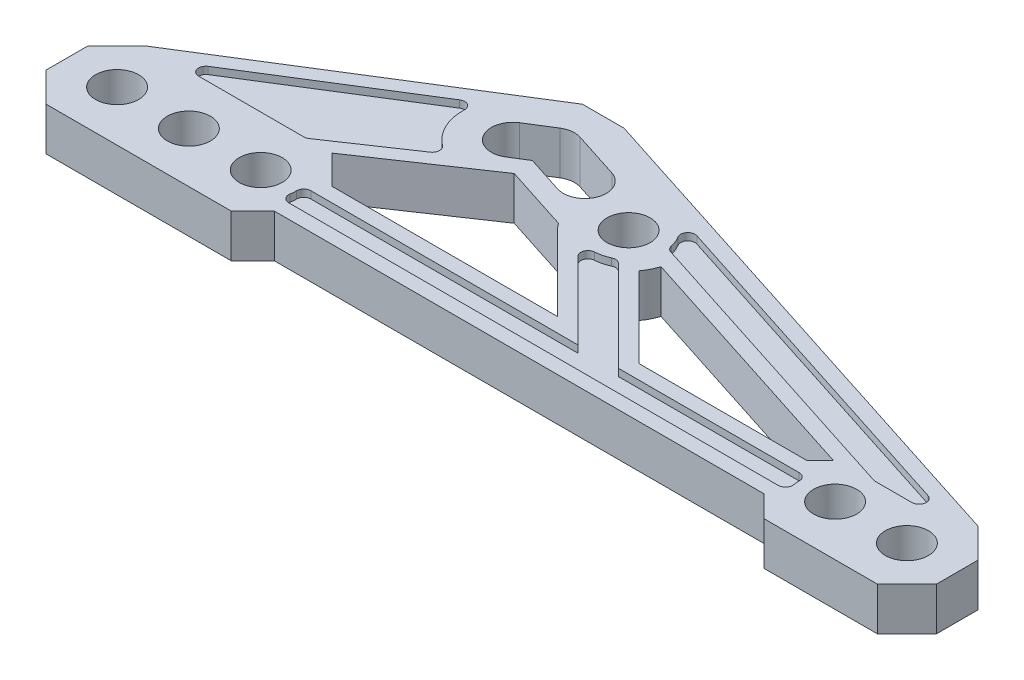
ISO-10303-21;
HEADER;
FILE_DESCRIPTION(('STEP AP214'),'2;1');
FILE_NAME('part.step','',(''),(''),'','','');
FILE_SCHEMA(('AUTOMOTIVE_DESIGN { 1 0 10303 214 1 1 1 1 }'));
ENDSEC;
DATA;
#1=APPLICATION_CONTEXT('core data for automotive mechanical design processes');
#2=APPLICATION_PROTOCOL_DEFINITION('international standard','automotive_design',2000,#1);
#3=PRODUCT_CONTEXT('',#1,'mechanical');
#4=PRODUCT('Part','Part','',(#3));
#5=PRODUCT_RELATED_PRODUCT_CATEGORY('part','',(#4));
#6=PRODUCT_DEFINITION_FORMATION('','',#4);
#7=PRODUCT_DEFINITION_CONTEXT('part definition',#1,'design');
#8=PRODUCT_DEFINITION('design','',#6,#7);
#9=PRODUCT_DEFINITION_SHAPE('','',#8);
#10=(LENGTH_UNIT() NAMED_UNIT(*) SI_UNIT(.MILLI.,.METRE.));
#11=(NAMED_UNIT(*) PLANE_ANGLE_UNIT() SI_UNIT($,.RADIAN.));
#12=(NAMED_UNIT(*) SI_UNIT($,.STERADIAN.) SOLID_ANGLE_UNIT());
#13=UNCERTAINTY_MEASURE_WITH_UNIT(LENGTH_MEASURE(1.E-05),#10,'distance_accuracy_value','');
#14=(GEOMETRIC_REPRESENTATION_CONTEXT(3) GLOBAL_UNCERTAINTY_ASSIGNED_CONTEXT((#13)) GLOBAL_UNIT_ASSIGNED_CONTEXT((#10,
#11,#12)) REPRESENTATION_CONTEXT('',''));
#15=CARTESIAN_POINT('',(0.,0.,0.));
#16=DIRECTION('',(0.,0.,1.));
#17=DIRECTION('',(1.,0.,0.));
#18=AXIS2_PLACEMENT_3D('',#15,#16,#17);
#19=CARTESIAN_POINT('',(0.,1.5,0.));
#20=DIRECTION('',(0.,1.,0.));
#21=DIRECTION('',(0.,0.,1.));
#22=AXIS2_PLACEMENT_3D('',#19,#20,#21);
#23=PLANE('',#22);
#24=CARTESIAN_POINT('',(16.9609619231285,1.5,-10.5983852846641));
#25=DIRECTION('',(0.,-1.,0.));
#26=DIRECTION('',(0.,0.,1.));
#27=AXIS2_PLACEMENT_3D('',#24,#25,#26);
#28=CIRCLE('',#27,3.5);
#29=CARTESIAN_POINT('',(14.8554469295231,1.5,-7.80253002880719));
#30=VERTEX_POINT('',#29);
#31=CARTESIAN_POINT('',(13.4630810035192,1.5,-10.7201599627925));
#32=VERTEX_POINT('',#31);
#33=EDGE_CURVE('E689',#30,#32,#28,.T.);
#34=ORIENTED_EDGE('',*,*,#33,.F.);
#35=CARTESIAN_POINT('',(14.5546590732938,1.5,-7.40312213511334));
#36=DIRECTION('',(0.,1.,0.));
#37=DIRECTION('',(0.,0.,-1.));
#38=AXIS2_PLACEMENT_3D('',#35,#36,#37);
#39=CIRCLE('',#38,0.5);
#40=CARTESIAN_POINT('',(14.8342198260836,1.5,-6.9885792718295));
#41=VERTEX_POINT('',#40);
#42=EDGE_CURVE('E674',#41,#30,#39,.T.);
#43=ORIENTED_EDGE('',*,*,#42,.F.);
#44=DIRECTION('',(0.829085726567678,0.,-0.559121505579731));
#45=VECTOR('',#44,1.);
#46=CARTESIAN_POINT('',(14.8342198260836,1.5,-6.9885792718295));
#47=LINE('',#46,#45);
#48=CARTESIAN_POINT('',(9.78794641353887,1.5,-3.58545713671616));
#49=VERTEX_POINT('',#48);
#50=EDGE_CURVE('E676',#49,#41,#47,.T.);
#51=ORIENTED_EDGE('',*,*,#50,.F.);
#52=CARTESIAN_POINT('',(9.508385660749,1.5,-4.));
#53=DIRECTION('',(0.,1.,0.));
#54=DIRECTION('',(0.,0.,1.));
#55=AXIS2_PLACEMENT_3D('',#52,#53,#54);
#56=CIRCLE('',#55,0.5);
#57=CARTESIAN_POINT('',(9.508385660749,1.5,-3.5));
#58=VERTEX_POINT('',#57);
#59=EDGE_CURVE('E679',#58,#49,#56,.T.);
#60=ORIENTED_EDGE('',*,*,#59,.F.);
#61=DIRECTION('',(1.,0.,0.));
#62=VECTOR('',#61,1.);
#63=CARTESIAN_POINT('',(2.18103966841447,1.5,-3.5));
#64=LINE('',#63,#62);
#65=CARTESIAN_POINT('',(2.18103966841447,1.5,-3.5));
#66=VERTEX_POINT('',#65);
#67=EDGE_CURVE('E681',#66,#58,#64,.T.);
#68=ORIENTED_EDGE('',*,*,#67,.F.);
#69=CARTESIAN_POINT('',(2.18103966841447,1.5,-4.));
#70=DIRECTION('',(0.,1.,0.));
#71=DIRECTION('',(0.,0.,-1.));
#72=AXIS2_PLACEMENT_3D('',#69,#70,#71);
#73=CIRCLE('',#72,0.500000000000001);
#74=CARTESIAN_POINT('',(1.91608003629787,1.5,-4.42402404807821));
#75=VERTEX_POINT('',#74);
#76=EDGE_CURVE('E683',#75,#66,#73,.T.);
#77=ORIENTED_EDGE('',*,*,#76,.F.);
#78=DIRECTION('',(-0.848048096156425,0.,0.529919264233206));
#79=VECTOR('',#78,1.);
#80=CARTESIAN_POINT('',(12.6984240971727,1.5,-11.1615803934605));
#81=LINE('',#80,#79);
#82=CARTESIAN_POINT('',(12.6984240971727,1.5,-11.1615803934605));
#83=VERTEX_POINT('',#82);
#84=EDGE_CURVE('E685',#83,#75,#81,.T.);
#85=ORIENTED_EDGE('',*,*,#84,.F.);
#86=CARTESIAN_POINT('',(12.9633837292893,1.5,-10.7375563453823));
#87=DIRECTION('',(0.,1.,0.));
#88=DIRECTION('',(0.,0.,1.));
#89=AXIS2_PLACEMENT_3D('',#86,#87,#88);
#90=CIRCLE('',#89,0.5);
#91=EDGE_CURVE('E687',#32,#83,#90,.T.);
#92=ORIENTED_EDGE('',*,*,#91,.F.);
#93=EDGE_LOOP('',(#34,#43,#51,#60,#68,#77,#85,#92));
#94=FACE_BOUND('',#93,.T.);
#95=DIRECTION('',(0.95203046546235,0.,0.306003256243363));
#96=VECTOR('',#95,1.);
#97=CARTESIAN_POINT('',(50.035975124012,1.5,-2.64593189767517));
#98=LINE('',#97,#96);
#99=CARTESIAN_POINT('',(29.2185369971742,1.5,-9.33710837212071));
#100=VERTEX_POINT('',#99);
#101=CARTESIAN_POINT('',(50.035975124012,1.5,-2.64593189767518));
#102=VERTEX_POINT('',#101);
#103=EDGE_CURVE('E622',#100,#102,#98,.T.);
#104=ORIENTED_EDGE('',*,*,#103,.F.);
#105=CARTESIAN_POINT('',(29.3715386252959,1.5,-9.81312360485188));
#106=DIRECTION('',(0.,1.,0.));
#107=DIRECTION('',(0.,0.,1.));
#108=AXIS2_PLACEMENT_3D('',#105,#106,#107);
#109=CIRCLE('',#108,0.499999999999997);
#110=CARTESIAN_POINT('',(28.8827965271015,1.5,-9.70761928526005));
#111=VERTEX_POINT('',#110);
#112=EDGE_CURVE('E614',#111,#100,#109,.T.);
#113=ORIENTED_EDGE('',*,*,#112,.F.);
#114=CARTESIAN_POINT('',(26.4390860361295,1.5,-9.18009768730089));
#115=DIRECTION('',(0.,-1.,0.));
#116=DIRECTION('',(0.,0.,1.));
#117=AXIS2_PLACEMENT_3D('',#114,#115,#116);
#118=CIRCLE('',#117,2.5);
#119=CARTESIAN_POINT('',(28.5702196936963,1.5,-10.4871054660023));
#120=VERTEX_POINT('',#119);
#121=EDGE_CURVE('E605',#120,#111,#118,.T.);
#122=ORIENTED_EDGE('',*,*,#121,.F.);
#123=CARTESIAN_POINT('',(28.9964464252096,1.5,-10.7485070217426));
#124=DIRECTION('',(0.,1.,0.));
#125=DIRECTION('',(0.,0.,-1.));
#126=AXIS2_PLACEMENT_3D('',#123,#124,#125);
#127=CIRCLE('',#126,0.500000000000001);
#128=CARTESIAN_POINT('',(29.1494480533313,1.5,-11.2245222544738));
#129=VERTEX_POINT('',#128);
#130=EDGE_CURVE('E613',#129,#120,#127,.T.);
#131=ORIENTED_EDGE('',*,*,#130,.F.);
#132=DIRECTION('',(-0.95203046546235,0.,-0.306003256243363));
#133=VECTOR('',#132,1.);
#134=CARTESIAN_POINT('',(52.8770300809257,1.5,-3.59796236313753));
#135=LINE('',#134,#133);
#136=CARTESIAN_POINT('',(52.8770300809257,1.5,-3.59796236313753));
#137=VERTEX_POINT('',#136);
#138=EDGE_CURVE('E633',#137,#129,#135,.T.);
#139=ORIENTED_EDGE('',*,*,#138,.F.);
#140=CARTESIAN_POINT('',(52.724028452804,1.5,-3.12194713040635));
#141=DIRECTION('',(0.,1.,0.));
#142=DIRECTION('',(0.,0.,1.));
#143=AXIS2_PLACEMENT_3D('',#140,#141,#142);
#144=CIRCLE('',#143,0.5);
#145=CARTESIAN_POINT('',(52.724028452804,1.5,-2.62194713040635));
#146=VERTEX_POINT('',#145);
#147=EDGE_CURVE('E635',#146,#137,#144,.T.);
#148=ORIENTED_EDGE('',*,*,#147,.F.);
#149=DIRECTION('',(1.,0.,0.));
#150=VECTOR('',#149,1.);
#151=CARTESIAN_POINT('',(50.1889767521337,1.5,-2.62194713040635));
#152=LINE('',#151,#150);
#153=CARTESIAN_POINT('',(50.1889767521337,1.5,-2.62194713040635));
#154=VERTEX_POINT('',#153);
#155=EDGE_CURVE('E637',#154,#146,#152,.T.);
#156=ORIENTED_EDGE('',*,*,#155,.F.);
#157=CARTESIAN_POINT('',(50.1889767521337,1.5,-3.12194713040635));
#158=DIRECTION('',(0.,1.,0.));
#159=DIRECTION('',(0.,0.,-1.));
#160=AXIS2_PLACEMENT_3D('',#157,#158,#159);
#161=CIRCLE('',#160,0.5);
#162=EDGE_CURVE('E639',#102,#154,#161,.T.);
#163=ORIENTED_EDGE('',*,*,#162,.F.);
#164=EDGE_LOOP('',(#104,#113,#122,#131,#139,#148,#156,#163));
#165=FACE_BOUND('',#164,.T.);
#166=CARTESIAN_POINT('',(26.6060113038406,1.5,-6.1847452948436));
#167=DIRECTION('',(0.,1.,0.));
#168=DIRECTION('',(0.,0.,1.));
#169=AXIS2_PLACEMENT_3D('',#166,#167,#168);
#170=CIRCLE('',#169,0.500000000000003);
#171=CARTESIAN_POINT('',(26.5781904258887,1.5,-6.68397069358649));
#172=VERTEX_POINT('',#171);
#173=CARTESIAN_POINT('',(26.2524579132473,1.5,-5.83119190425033));
#174=VERTEX_POINT('',#173);
#175=EDGE_CURVE('E756',#172,#174,#170,.T.);
#176=ORIENTED_EDGE('',*,*,#175,.F.);
#177=CARTESIAN_POINT('',(26.4390860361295,1.5,-9.18009768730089));
#178=DIRECTION('',(0.,-1.,0.));
#179=DIRECTION('',(0.,0.,1.));
#180=AXIS2_PLACEMENT_3D('',#177,#178,#179);
#181=CIRCLE('',#180,2.5);
#182=CARTESIAN_POINT('',(27.5164970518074,1.5,-6.92417536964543));
#183=VERTEX_POINT('',#182);
#184=EDGE_CURVE('E728',#183,#172,#181,.T.);
#185=ORIENTED_EDGE('',*,*,#184,.F.);
#186=CARTESIAN_POINT('',(27.7319792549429,1.5,-6.47299090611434));
#187=DIRECTION('',(0.,1.,0.));
#188=DIRECTION('',(0.,0.,1.));
#189=AXIS2_PLACEMENT_3D('',#186,#187,#188);
#190=CIRCLE('',#189,0.499999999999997);
#191=CARTESIAN_POINT('',(28.0855326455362,1.5,-6.82654429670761));
#192=VERTEX_POINT('',#191);
#193=EDGE_CURVE('E730',#192,#183,#190,.T.);
#194=ORIENTED_EDGE('',*,*,#193,.F.);
#195=DIRECTION('',(-0.707106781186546,0.,-0.707106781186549));
#196=VECTOR('',#195,1.);
#197=CARTESIAN_POINT('',(28.0855326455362,1.5,-6.82654429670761));
#198=LINE('',#197,#196);
#199=CARTESIAN_POINT('',(34.4120769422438,1.5,-0.5));
#200=VERTEX_POINT('',#199);
#201=EDGE_CURVE('E733',#200,#192,#198,.T.);
#202=ORIENTED_EDGE('',*,*,#201,.F.);
#203=DIRECTION('',(-1.,0.,0.));
#204=VECTOR('',#203,1.);
#205=CARTESIAN_POINT('',(34.4120769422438,1.5,-0.5));
#206=LINE('',#205,#204);
#207=CARTESIAN_POINT('',(47.,1.5,-0.500000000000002));
#208=VERTEX_POINT('',#207);
#209=EDGE_CURVE('E736',#208,#200,#206,.T.);
#210=ORIENTED_EDGE('',*,*,#209,.F.);
#211=CARTESIAN_POINT('',(47.,1.5,0.));
#212=DIRECTION('',(0.,1.,0.));
#213=DIRECTION('',(0.,0.,-1.));
#214=AXIS2_PLACEMENT_3D('',#211,#212,#213);
#215=CIRCLE('',#214,0.5);
#216=CARTESIAN_POINT('',(47.5,1.5,0.));
#217=VERTEX_POINT('',#216);
#218=EDGE_CURVE('E738',#217,#208,#215,.T.);
#219=ORIENTED_EDGE('',*,*,#218,.F.);
#220=CARTESIAN_POINT('',(50.,1.5,0.));
#221=DIRECTION('',(0.,-1.,0.));
#222=DIRECTION('',(0.,0.,1.));
#223=AXIS2_PLACEMENT_3D('',#220,#221,#222);
#224=CIRCLE('',#223,2.5);
#225=CARTESIAN_POINT('',(47.5349667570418,1.5,0.416666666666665));
#226=VERTEX_POINT('',#225);
#227=EDGE_CURVE('E740',#226,#217,#224,.T.);
#228=ORIENTED_EDGE('',*,*,#227,.F.);
#229=CARTESIAN_POINT('',(47.0419601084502,1.5,0.499999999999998));
#230=DIRECTION('',(0.,1.,0.));
#231=DIRECTION('',(0.,0.,1.));
#232=AXIS2_PLACEMENT_3D('',#229,#230,#231);
#233=CIRCLE('',#232,0.500000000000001);
#234=CARTESIAN_POINT('',(47.0419601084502,1.5,0.999999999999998));
#235=VERTEX_POINT('',#234);
#236=EDGE_CURVE('E742',#235,#226,#233,.T.);
#237=ORIENTED_EDGE('',*,*,#236,.F.);
#238=DIRECTION('',(1.,0.,0.));
#239=VECTOR('',#238,1.);
#240=CARTESIAN_POINT('',(12.9580398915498,1.5,1.));
#241=LINE('',#240,#239);
#242=CARTESIAN_POINT('',(12.9580398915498,1.5,1.));
#243=VERTEX_POINT('',#242);
#244=EDGE_CURVE('E744',#243,#235,#241,.T.);
#245=ORIENTED_EDGE('',*,*,#244,.F.);
#246=CARTESIAN_POINT('',(12.9580398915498,1.5,0.5));
#247=DIRECTION('',(0.,1.,0.));
#248=DIRECTION('',(0.,0.,1.));
#249=AXIS2_PLACEMENT_3D('',#246,#247,#248);
#250=CIRCLE('',#249,0.5);
#251=CARTESIAN_POINT('',(12.4650332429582,1.5,0.416666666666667));
#252=VERTEX_POINT('',#251);
#253=EDGE_CURVE('E746',#252,#243,#250,.T.);
#254=ORIENTED_EDGE('',*,*,#253,.F.);
#255=CARTESIAN_POINT('',(10.,1.5,0.));
#256=DIRECTION('',(0.,-1.,0.));
#257=DIRECTION('',(0.,0.,-1.));
#258=AXIS2_PLACEMENT_3D('',#255,#256,#257);
#259=CIRCLE('',#258,2.5);
#260=CARTESIAN_POINT('',(12.5,1.5,0.));
#261=VERTEX_POINT('',#260);
#262=EDGE_CURVE('E748',#261,#252,#259,.T.);
#263=ORIENTED_EDGE('',*,*,#262,.F.);
#264=CARTESIAN_POINT('',(13.,1.5,0.));
#265=DIRECTION('',(0.,1.,0.));
#266=DIRECTION('',(0.,0.,-1.));
#267=AXIS2_PLACEMENT_3D('',#264,#265,#266);
#268=CIRCLE('',#267,0.5);
#269=CARTESIAN_POINT('',(13.,1.5,-0.500000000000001));
#270=VERTEX_POINT('',#269);
#271=EDGE_CURVE('E750',#270,#261,#268,.T.);
#272=ORIENTED_EDGE('',*,*,#271,.F.);
#273=DIRECTION('',(-1.,0.,0.));
#274=VECTOR('',#273,1.);
#275=CARTESIAN_POINT('',(13.,1.5,-0.500000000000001));
#276=LINE('',#275,#274);
#277=CARTESIAN_POINT('',(31.5836498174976,1.5,-0.500000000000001));
#278=VERTEX_POINT('',#277);
#279=EDGE_CURVE('E752',#278,#270,#276,.T.);
#280=ORIENTED_EDGE('',*,*,#279,.F.);
#281=DIRECTION('',(0.707106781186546,0.,0.707106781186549));
#282=VECTOR('',#281,1.);
#283=CARTESIAN_POINT('',(31.5836498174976,1.5,-0.500000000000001));
#284=LINE('',#283,#282);
#285=EDGE_CURVE('E754',#174,#278,#284,.T.);
#286=ORIENTED_EDGE('',*,*,#285,.F.);
#287=EDGE_LOOP('',(#176,#185,#194,#202,#210,#219,#228,#237,#245,#254,#263,#272,#280,#286));
#288=FACE_BOUND('',#287,.T.);
#289=CARTESIAN_POINT('',(50.,1.5,0.));
#290=DIRECTION('',(0.,1.,0.));
#291=DIRECTION('',(0.,0.,1.));
#292=AXIS2_PLACEMENT_3D('',#289,#290,#291);
#293=CIRCLE('',#292,1.5);
#294=CARTESIAN_POINT('',(50.,1.5,1.5));
#295=VERTEX_POINT('',#294);
#296=EDGE_CURVE('E1112',#295,#295,#293,.T.);
#297=ORIENTED_EDGE('',*,*,#296,.F.);
#298=EDGE_LOOP('',(#297));
#299=FACE_BOUND('',#298,.T.);
#300=DIRECTION('',(0.848048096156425,0.,-0.529919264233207));
#301=VECTOR('',#300,1.);
#302=CARTESIAN_POINT('',(17.7558408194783,1.5,-9.32631314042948));
#303=LINE('',#302,#301);
#304=CARTESIAN_POINT('',(17.7558408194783,1.5,-9.32631314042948));
#305=VERTEX_POINT('',#304);
#306=CARTESIAN_POINT('',(18.8857132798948,1.5,-10.0323358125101));
#307=VERTEX_POINT('',#306);
#308=EDGE_CURVE('E1126',#305,#307,#303,.T.);
#309=ORIENTED_EDGE('',*,*,#308,.F.);
#310=CARTESIAN_POINT('',(16.9609619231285,1.5,-10.5983852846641));
#311=DIRECTION('',(0.,1.,0.));
#312=DIRECTION('',(0.,0.,1.));
#313=AXIS2_PLACEMENT_3D('',#310,#311,#312);
#314=CIRCLE('',#313,1.5);
#315=CARTESIAN_POINT('',(16.1660830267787,1.5,-11.8704574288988));
#316=VERTEX_POINT('',#315);
#317=EDGE_CURVE('E1124',#316,#305,#314,.T.);
#318=ORIENTED_EDGE('',*,*,#317,.F.);
#319=DIRECTION('',(-0.848048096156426,0.,0.529919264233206));
#320=VECTOR('',#319,1.);
#321=CARTESIAN_POINT('',(16.1660830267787,1.5,-11.8704574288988));
#322=LINE('',#321,#320);
#323=CARTESIAN_POINT('',(17.886681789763,1.5,-12.9456068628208));
#324=VERTEX_POINT('',#323);
#325=EDGE_CURVE('E1138',#324,#316,#322,.T.);
#326=ORIENTED_EDGE('',*,*,#325,.F.);
#327=CARTESIAN_POINT('',(18.6815606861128,1.5,-11.6735347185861));
#328=DIRECTION('',(0.,1.,0.));
#329=DIRECTION('',(0.,0.,1.));
#330=AXIS2_PLACEMENT_3D('',#327,#328,#329);
#331=CIRCLE('',#330,1.5);
#332=CARTESIAN_POINT('',(19.1405655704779,1.5,-13.1015804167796));
#333=VERTEX_POINT('',#332);
#334=EDGE_CURVE('E1135',#333,#324,#331,.T.);
#335=ORIENTED_EDGE('',*,*,#334,.F.);
#336=DIRECTION('',(-0.95203046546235,0.,-0.306003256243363));
#337=VECTOR('',#336,1.);
#338=CARTESIAN_POINT('',(19.1405655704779,1.5,-13.1015804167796));
#339=LINE('',#338,#337);
#340=CARTESIAN_POINT('',(22.4034493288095,1.5,-12.0528187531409));
#341=VERTEX_POINT('',#340);
#342=EDGE_CURVE('E1133',#341,#333,#339,.T.);
#343=ORIENTED_EDGE('',*,*,#342,.F.);
#344=CARTESIAN_POINT('',(21.9444444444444,1.5,-10.6247730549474));
#345=DIRECTION('',(0.,1.,0.));
#346=DIRECTION('',(0.,0.,1.));
#347=AXIS2_PLACEMENT_3D('',#344,#345,#346);
#348=CIRCLE('',#347,1.50000000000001);
#349=CARTESIAN_POINT('',(21.4854395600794,1.5,-9.19672735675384));
#350=VERTEX_POINT('',#349);
#351=EDGE_CURVE('E1131',#350,#341,#348,.T.);
#352=ORIENTED_EDGE('',*,*,#351,.F.);
#353=DIRECTION('',(0.95203046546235,0.,0.306003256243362));
#354=VECTOR('',#353,1.);
#355=CARTESIAN_POINT('',(18.8857132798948,1.5,-10.0323358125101));
#356=LINE('',#355,#354);
#357=EDGE_CURVE('E1129',#307,#350,#356,.T.);
#358=ORIENTED_EDGE('',*,*,#357,.F.);
#359=EDGE_LOOP('',(#309,#318,#326,#335,#343,#352,#358));
#360=FACE_BOUND('',#359,.T.);
#361=CARTESIAN_POINT('',(10.,1.5,0.));
#362=DIRECTION('',(0.,1.,0.));
#363=DIRECTION('',(0.,0.,1.));
#364=AXIS2_PLACEMENT_3D('',#361,#362,#363);
#365=CIRCLE('',#364,1.5);
#366=CARTESIAN_POINT('',(10.,1.5,1.5));
#367=VERTEX_POINT('',#366);
#368=EDGE_CURVE('E1176',#367,#367,#365,.T.);
#369=ORIENTED_EDGE('',*,*,#368,.F.);
#370=EDGE_LOOP('',(#369));
#371=FACE_BOUND('',#370,.T.);
#372=CARTESIAN_POINT('',(0.,1.5,0.));
#373=DIRECTION('',(0.,1.,0.));
#374=DIRECTION('',(0.,0.,1.));
#375=AXIS2_PLACEMENT_3D('',#372,#373,#374);
#376=CIRCLE('',#375,1.5);
#377=CARTESIAN_POINT('',(0.,1.5,1.5));
#378=VERTEX_POINT('',#377);
#379=EDGE_CURVE('E1188',#378,#378,#376,.T.);
#380=ORIENTED_EDGE('',*,*,#379,.F.);
#381=EDGE_LOOP('',(#380));
#382=FACE_BOUND('',#381,.T.);
#383=DIRECTION('',(-0.707106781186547,0.,0.707106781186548));
#384=VECTOR('',#383,1.);
#385=CARTESIAN_POINT('',(-1.44974746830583,1.5,-3.5));
#386=LINE('',#385,#384);
#387=CARTESIAN_POINT('',(-1.44974746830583,1.5,-3.5));
#388=VERTEX_POINT('',#387);
#389=CARTESIAN_POINT('',(-3.5,1.5,-1.44974746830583));
#390=VERTEX_POINT('',#389);
#391=EDGE_CURVE('E1239',#388,#390,#386,.T.);
#392=ORIENTED_EDGE('',*,*,#391,.T.);
#393=DIRECTION('',(0.,0.,1.));
#394=VECTOR('',#393,1.);
#395=CARTESIAN_POINT('',(-3.5,1.5,-1.44974746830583));
#396=LINE('',#395,#394);
#397=CARTESIAN_POINT('',(-3.5,1.5,1.44974746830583));
#398=VERTEX_POINT('',#397);
#399=EDGE_CURVE('E1242',#390,#398,#396,.T.);
#400=ORIENTED_EDGE('',*,*,#399,.T.);
#401=DIRECTION('',(0.707106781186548,0.,0.707106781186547));
#402=VECTOR('',#401,1.);
#403=CARTESIAN_POINT('',(-3.5,1.5,1.44974746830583));
#404=LINE('',#403,#402);
#405=CARTESIAN_POINT('',(-1.44974746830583,1.5,3.5));
#406=VERTEX_POINT('',#405);
#407=EDGE_CURVE('E1245',#398,#406,#404,.T.);
#408=ORIENTED_EDGE('',*,*,#407,.T.);
#409=DIRECTION('',(1.,0.,0.));
#410=VECTOR('',#409,1.);
#411=CARTESIAN_POINT('',(11.4497474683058,1.5,3.5));
#412=LINE('',#411,#410);
#413=CARTESIAN_POINT('',(11.4497474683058,1.5,3.5));
#414=VERTEX_POINT('',#413);
#415=EDGE_CURVE('E1247',#406,#414,#412,.T.);
#416=ORIENTED_EDGE('',*,*,#415,.T.);
#417=DIRECTION('',(0.707106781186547,0.,-0.707106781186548));
#418=VECTOR('',#417,1.);
#419=CARTESIAN_POINT('',(11.4497474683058,1.5,3.5));
#420=LINE('',#419,#418);
#421=CARTESIAN_POINT('',(12.9497474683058,1.5,2.));
#422=VERTEX_POINT('',#421);
#423=EDGE_CURVE('E1249',#414,#422,#420,.T.);
#424=ORIENTED_EDGE('',*,*,#423,.T.);
#425=DIRECTION('',(1.,0.,0.));
#426=VECTOR('',#425,1.);
#427=CARTESIAN_POINT('',(12.9497474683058,1.5,2.));
#428=LINE('',#427,#426);
#429=CARTESIAN_POINT('',(47.0502525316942,1.5,2.));
#430=VERTEX_POINT('',#429);
#431=EDGE_CURVE('E1251',#422,#430,#428,.T.);
#432=ORIENTED_EDGE('',*,*,#431,.T.);
#433=DIRECTION('',(0.707106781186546,0.,0.707106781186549));
#434=VECTOR('',#433,1.);
#435=CARTESIAN_POINT('',(48.5502525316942,1.5,3.49999999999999));
#436=LINE('',#435,#434);
#437=CARTESIAN_POINT('',(48.5502525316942,1.5,3.49999999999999));
#438=VERTEX_POINT('',#437);
#439=EDGE_CURVE('E1253',#430,#438,#436,.T.);
#440=ORIENTED_EDGE('',*,*,#439,.T.);
#441=DIRECTION('',(1.,0.,0.));
#442=VECTOR('',#441,1.);
#443=CARTESIAN_POINT('',(56.4497474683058,1.5,3.49999999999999));
#444=LINE('',#443,#442);
#445=CARTESIAN_POINT('',(56.4497474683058,1.5,3.49999999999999));
#446=VERTEX_POINT('',#445);
#447=EDGE_CURVE('E1255',#438,#446,#444,.T.);
#448=ORIENTED_EDGE('',*,*,#447,.T.);
#449=DIRECTION('',(0.707106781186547,0.,-0.707106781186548));
#450=VECTOR('',#449,1.);
#451=CARTESIAN_POINT('',(58.5,1.5,1.44974746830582));
#452=LINE('',#451,#450);
#453=CARTESIAN_POINT('',(58.5,1.5,1.44974746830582));
#454=VERTEX_POINT('',#453);
#455=EDGE_CURVE('E1257',#446,#454,#452,.T.);
#456=ORIENTED_EDGE('',*,*,#455,.T.);
#457=DIRECTION('',(0.,0.,-1.));
#458=VECTOR('',#457,1.);
#459=CARTESIAN_POINT('',(58.5,1.5,-1.44974746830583));
#460=LINE('',#459,#458);
#461=CARTESIAN_POINT('',(58.5,1.5,-1.44974746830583));
#462=VERTEX_POINT('',#461);
#463=EDGE_CURVE('E1259',#454,#462,#460,.T.);
#464=ORIENTED_EDGE('',*,*,#463,.T.);
#465=DIRECTION('',(-0.707106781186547,0.,-0.707106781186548));
#466=VECTOR('',#465,1.);
#467=CARTESIAN_POINT('',(56.4497474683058,1.5,-3.5));
#468=LINE('',#467,#466);
#469=CARTESIAN_POINT('',(56.4497474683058,1.5,-3.5));
#470=VERTEX_POINT('',#469);
#471=EDGE_CURVE('E1261',#462,#470,#468,.T.);
#472=ORIENTED_EDGE('',*,*,#471,.T.);
#473=DIRECTION('',(-0.95203046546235,0.,-0.306003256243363));
#474=VECTOR('',#473,1.);
#475=CARTESIAN_POINT('',(20.1313081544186,1.5,-15.1735347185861));
#476=LINE('',#475,#474);
#477=CARTESIAN_POINT('',(20.1313081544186,1.5,-15.1735347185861));
#478=VERTEX_POINT('',#477);
#479=EDGE_CURVE('E1263',#470,#478,#476,.T.);
#480=ORIENTED_EDGE('',*,*,#479,.T.);
#481=DIRECTION('',(-1.,0.,0.));
#482=VECTOR('',#481,1.);
#483=CARTESIAN_POINT('',(20.1313081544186,1.5,-15.1735347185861));
#484=LINE('',#483,#482);
#485=CARTESIAN_POINT('',(17.231813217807,1.5,-15.1735347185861));
#486=VERTEX_POINT('',#485);
#487=EDGE_CURVE('E1265',#478,#486,#484,.T.);
#488=ORIENTED_EDGE('',*,*,#487,.T.);
#489=DIRECTION('',(-0.848048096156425,0.,0.529919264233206));
#490=VECTOR('',#489,1.);
#491=CARTESIAN_POINT('',(-1.44974746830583,1.5,-3.5));
#492=LINE('',#491,#490);
#493=EDGE_CURVE('E1267',#486,#388,#492,.T.);
#494=ORIENTED_EDGE('',*,*,#493,.T.);
#495=EDGE_LOOP('',(#392,#400,#408,#416,#424,#432,#440,#448,#456,#464,#472,#480,#488,#494));
#496=FACE_BOUND('',#495,.T.);
#497=DIRECTION('',(1.,0.,0.));
#498=VECTOR('',#497,1.);
#499=CARTESIAN_POINT('',(13.4497474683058,1.5,-1.5));
#500=LINE('',#499,#498);
#501=CARTESIAN_POINT('',(13.4497474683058,1.5,-1.5));
#502=VERTEX_POINT('',#501);
#503=CARTESIAN_POINT('',(29.1694362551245,1.5,-1.5));
#504=VERTEX_POINT('',#503);
#505=EDGE_CURVE('E1196',#502,#504,#500,.T.);
#506=ORIENTED_EDGE('',*,*,#505,.F.);
#507=DIRECTION('',(0.707106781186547,0.,0.707106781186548));
#508=VECTOR('',#507,1.);
#509=CARTESIAN_POINT('',(13.4497474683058,1.5,-1.5));
#510=LINE('',#509,#508);
#511=CARTESIAN_POINT('',(11.4497474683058,1.5,-3.5));
#512=VERTEX_POINT('',#511);
#513=EDGE_CURVE('E1194',#512,#502,#510,.T.);
#514=ORIENTED_EDGE('',*,*,#513,.F.);
#515=DIRECTION('',(-0.829085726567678,0.,0.559121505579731));
#516=VECTOR('',#515,1.);
#517=CARTESIAN_POINT('',(11.4497474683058,1.5,-3.5));
#518=LINE('',#517,#516);
#519=CARTESIAN_POINT('',(19.0384969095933,1.5,-8.61772531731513));
#520=VERTEX_POINT('',#519);
#521=EDGE_CURVE('E1206',#520,#512,#518,.T.);
#522=ORIENTED_EDGE('',*,*,#521,.F.);
#523=DIRECTION('',(-0.95203046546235,0.,-0.306003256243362));
#524=VECTOR('',#523,1.);
#525=CARTESIAN_POINT('',(23.5830129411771,1.5,-7.15701922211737));
#526=LINE('',#525,#524);
#527=CARTESIAN_POINT('',(23.5830129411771,1.5,-7.15701922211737));
#528=VERTEX_POINT('',#527);
#529=EDGE_CURVE('E1203',#528,#520,#526,.T.);
#530=ORIENTED_EDGE('',*,*,#529,.F.);
#531=CARTESIAN_POINT('',(26.4390860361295,1.5,-9.18009768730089));
#532=DIRECTION('',(0.,-1.,0.));
#533=DIRECTION('',(0.,0.,1.));
#534=AXIS2_PLACEMENT_3D('',#531,#532,#533);
#535=CIRCLE('',#534,3.5);
#536=CARTESIAN_POINT('',(23.9642123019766,1.5,-6.70522395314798));
#537=VERTEX_POINT('',#536);
#538=EDGE_CURVE('E1201',#537,#528,#535,.T.);
#539=ORIENTED_EDGE('',*,*,#538,.F.);
#540=DIRECTION('',(-0.707106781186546,0.,-0.70710678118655));
#541=VECTOR('',#540,1.);
#542=CARTESIAN_POINT('',(23.9642123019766,1.5,-6.70522395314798));
#543=LINE('',#542,#541);
#544=EDGE_CURVE('E1199',#504,#537,#543,.T.);
#545=ORIENTED_EDGE('',*,*,#544,.F.);
#546=EDGE_LOOP('',(#506,#514,#522,#530,#539,#545));
#547=FACE_BOUND('',#546,.T.);
#548=CARTESIAN_POINT('',(5.,1.5,0.));
#549=DIRECTION('',(0.,1.,0.));
#550=DIRECTION('',(0.,0.,1.));
#551=AXIS2_PLACEMENT_3D('',#548,#549,#550);
#552=CIRCLE('',#551,1.5);
#553=CARTESIAN_POINT('',(5.,1.5,1.5));
#554=VERTEX_POINT('',#553);
#555=EDGE_CURVE('E1182',#554,#554,#552,.T.);
#556=ORIENTED_EDGE('',*,*,#555,.F.);
#557=EDGE_LOOP('',(#556));
#558=FACE_BOUND('',#557,.T.);
#559=CARTESIAN_POINT('',(26.4390860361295,1.5,-9.18009768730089));
#560=DIRECTION('',(0.,1.,0.));
#561=DIRECTION('',(0.,0.,1.));
#562=AXIS2_PLACEMENT_3D('',#559,#560,#561);
#563=CIRCLE('',#562,1.5);
#564=CARTESIAN_POINT('',(26.4390860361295,1.5,-7.68009768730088));
#565=VERTEX_POINT('',#564);
#566=EDGE_CURVE('E1118',#565,#565,#563,.T.);
#567=ORIENTED_EDGE('',*,*,#566,.F.);
#568=EDGE_LOOP('',(#567));
#569=FACE_BOUND('',#568,.T.);
#570=CARTESIAN_POINT('',(55.,1.5,0.));
#571=DIRECTION('',(0.,1.,0.));
#572=DIRECTION('',(0.,0.,1.));
#573=AXIS2_PLACEMENT_3D('',#570,#571,#572);
#574=CIRCLE('',#573,1.5);
#575=CARTESIAN_POINT('',(55.,1.5,1.5));
#576=VERTEX_POINT('',#575);
#577=EDGE_CURVE('E1106',#576,#576,#574,.T.);
#578=ORIENTED_EDGE('',*,*,#577,.F.);
#579=EDGE_LOOP('',(#578));
#580=FACE_BOUND('',#579,.T.);
#581=DIRECTION('',(-0.95203046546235,0.,-0.306003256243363));
#582=VECTOR('',#581,1.);
#583=CARTESIAN_POINT('',(29.7711926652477,1.5,-8.10908629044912));
#584=LINE('',#583,#582);
#585=CARTESIAN_POINT('',(47.470422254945,1.5,-2.42016972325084));
#586=VERTEX_POINT('',#585);
#587=CARTESIAN_POINT('',(29.7711926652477,1.5,-8.10908629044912));
#588=VERTEX_POINT('',#587);
#589=EDGE_CURVE('E1070',#586,#588,#584,.T.);
#590=ORIENTED_EDGE('',*,*,#589,.F.);
#591=DIRECTION('',(0.707106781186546,0.,-0.70710678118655));
#592=VECTOR('',#591,1.);
#593=CARTESIAN_POINT('',(47.470422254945,1.5,-2.42016972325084));
#594=LINE('',#593,#592);
#595=CARTESIAN_POINT('',(46.5502525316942,1.5,-1.5));
#596=VERTEX_POINT('',#595);
#597=EDGE_CURVE('E1068',#596,#586,#594,.T.);
#598=ORIENTED_EDGE('',*,*,#597,.F.);
#599=DIRECTION('',(1.,0.,0.));
#600=VECTOR('',#599,1.);
#601=CARTESIAN_POINT('',(34.8262905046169,1.5,-1.5));
#602=LINE('',#601,#600);
#603=CARTESIAN_POINT('',(34.8262905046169,1.5,-1.5));
#604=VERTEX_POINT('',#603);
#605=EDGE_CURVE('E1078',#604,#596,#602,.T.);
#606=ORIENTED_EDGE('',*,*,#605,.F.);
#607=DIRECTION('',(0.707106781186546,0.,0.707106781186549));
#608=VECTOR('',#607,1.);
#609=CARTESIAN_POINT('',(29.2421291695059,1.5,-7.08416133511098));
#610=LINE('',#609,#608);
#611=CARTESIAN_POINT('',(29.2421291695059,1.5,-7.08416133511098));
#612=VERTEX_POINT('',#611);
#613=EDGE_CURVE('E1075',#612,#604,#610,.T.);
#614=ORIENTED_EDGE('',*,*,#613,.F.);
#615=CARTESIAN_POINT('',(26.4390860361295,1.5,-9.18009768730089));
#616=DIRECTION('',(0.,-1.,0.));
#617=DIRECTION('',(0.,0.,1.));
#618=AXIS2_PLACEMENT_3D('',#615,#616,#617);
#619=CIRCLE('',#618,3.5);
#620=EDGE_CURVE('E1073',#588,#612,#619,.T.);
#621=ORIENTED_EDGE('',*,*,#620,.F.);
#622=EDGE_LOOP('',(#590,#598,#606,#614,#621));
#623=FACE_BOUND('',#622,.T.);
#624=ADVANCED_FACE('F35',(#94,#165,#288,#299,#360,#371,#382,#496,#547,#558,#569,#580,#623),#23,.T.);
#625=CARTESIAN_POINT('',(0.,-1.5,0.));
#626=DIRECTION('',(0.,1.,0.));
#627=DIRECTION('',(0.,0.,1.));
#628=AXIS2_PLACEMENT_3D('',#625,#626,#627);
#629=PLANE('',#628);
#630=DIRECTION('',(0.829085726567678,0.,-0.559121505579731));
#631=VECTOR('',#630,1.);
#632=CARTESIAN_POINT('',(14.8342198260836,-1.5,-6.9885792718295));
#633=LINE('',#632,#631);
#634=CARTESIAN_POINT('',(9.78794641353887,-1.5,-3.58545713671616));
#635=VERTEX_POINT('',#634);
#636=CARTESIAN_POINT('',(14.8342198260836,-1.5,-6.9885792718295));
#637=VERTEX_POINT('',#636);
#638=EDGE_CURVE('E916',#635,#637,#633,.T.);
#639=ORIENTED_EDGE('',*,*,#638,.T.);
#640=CARTESIAN_POINT('',(14.5546590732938,-1.5,-7.40312213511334));
#641=DIRECTION('',(0.,1.,0.));
#642=DIRECTION('',(0.,0.,-1.));
#643=AXIS2_PLACEMENT_3D('',#640,#641,#642);
#644=CIRCLE('',#643,0.5);
#645=CARTESIAN_POINT('',(14.8554469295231,-1.5,-7.80253002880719));
#646=VERTEX_POINT('',#645);
#647=EDGE_CURVE('E894',#637,#646,#644,.T.);
#648=ORIENTED_EDGE('',*,*,#647,.T.);
#649=CARTESIAN_POINT('',(16.9609619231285,-1.5,-10.5983852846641));
#650=DIRECTION('',(0.,-1.,0.));
#651=DIRECTION('',(0.,0.,1.));
#652=AXIS2_PLACEMENT_3D('',#649,#650,#651);
#653=CIRCLE('',#652,3.5);
#654=CARTESIAN_POINT('',(13.4630810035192,-1.5,-10.7201599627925));
#655=VERTEX_POINT('',#654);
#656=EDGE_CURVE('E897',#646,#655,#653,.T.);
#657=ORIENTED_EDGE('',*,*,#656,.T.);
#658=CARTESIAN_POINT('',(12.9633837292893,-1.5,-10.7375563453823));
#659=DIRECTION('',(0.,1.,0.));
#660=DIRECTION('',(0.,0.,1.));
#661=AXIS2_PLACEMENT_3D('',#658,#659,#660);
#662=CIRCLE('',#661,0.5);
#663=CARTESIAN_POINT('',(12.6984240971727,-1.5,-11.1615803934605));
#664=VERTEX_POINT('',#663);
#665=EDGE_CURVE('E901',#655,#664,#662,.T.);
#666=ORIENTED_EDGE('',*,*,#665,.T.);
#667=DIRECTION('',(-0.848048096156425,0.,0.529919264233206));
#668=VECTOR('',#667,1.);
#669=CARTESIAN_POINT('',(12.6984240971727,-1.5,-11.1615803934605));
#670=LINE('',#669,#668);
#671=CARTESIAN_POINT('',(1.91608003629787,-1.5,-4.42402404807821));
#672=VERTEX_POINT('',#671);
#673=EDGE_CURVE('E904',#664,#672,#670,.T.);
#674=ORIENTED_EDGE('',*,*,#673,.T.);
#675=CARTESIAN_POINT('',(2.18103966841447,-1.5,-4.));
#676=DIRECTION('',(0.,1.,0.));
#677=DIRECTION('',(0.,0.,-1.));
#678=AXIS2_PLACEMENT_3D('',#675,#676,#677);
#679=CIRCLE('',#678,0.500000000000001);
#680=CARTESIAN_POINT('',(2.18103966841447,-1.5,-3.5));
#681=VERTEX_POINT('',#680);
#682=EDGE_CURVE('E907',#672,#681,#679,.T.);
#683=ORIENTED_EDGE('',*,*,#682,.T.);
#684=DIRECTION('',(1.,0.,0.));
#685=VECTOR('',#684,1.);
#686=CARTESIAN_POINT('',(2.18103966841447,-1.5,-3.5));
#687=LINE('',#686,#685);
#688=CARTESIAN_POINT('',(9.508385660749,-1.5,-3.5));
#689=VERTEX_POINT('',#688);
#690=EDGE_CURVE('E910',#681,#689,#687,.T.);
#691=ORIENTED_EDGE('',*,*,#690,.T.);
#692=CARTESIAN_POINT('',(9.508385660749,-1.5,-4.));
#693=DIRECTION('',(0.,1.,0.));
#694=DIRECTION('',(0.,0.,1.));
#695=AXIS2_PLACEMENT_3D('',#692,#693,#694);
#696=CIRCLE('',#695,0.5);
#697=EDGE_CURVE('E913',#689,#635,#696,.T.);
#698=ORIENTED_EDGE('',*,*,#697,.T.);
#699=EDGE_LOOP('',(#639,#648,#657,#666,#674,#683,#691,#698));
#700=FACE_BOUND('',#699,.T.);
#701=CARTESIAN_POINT('',(26.4390860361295,-1.5,-9.18009768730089));
#702=DIRECTION('',(0.,-1.,0.));
#703=DIRECTION('',(0.,0.,1.));
#704=AXIS2_PLACEMENT_3D('',#701,#702,#703);
#705=CIRCLE('',#704,2.5);
#706=CARTESIAN_POINT('',(28.5702196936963,-1.5,-10.4871054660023));
#707=VERTEX_POINT('',#706);
#708=CARTESIAN_POINT('',(28.8827965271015,-1.5,-9.70761928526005));
#709=VERTEX_POINT('',#708);
#710=EDGE_CURVE('E850',#707,#709,#705,.T.);
#711=ORIENTED_EDGE('',*,*,#710,.T.);
#712=CARTESIAN_POINT('',(29.3715386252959,-1.5,-9.81312360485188));
#713=DIRECTION('',(0.,1.,0.));
#714=DIRECTION('',(0.,0.,1.));
#715=AXIS2_PLACEMENT_3D('',#712,#713,#714);
#716=CIRCLE('',#715,0.499999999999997);
#717=CARTESIAN_POINT('',(29.2185369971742,-1.5,-9.33710837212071));
#718=VERTEX_POINT('',#717);
#719=EDGE_CURVE('E828',#709,#718,#716,.T.);
#720=ORIENTED_EDGE('',*,*,#719,.T.);
#721=DIRECTION('',(0.95203046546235,0.,0.306003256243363));
#722=VECTOR('',#721,1.);
#723=CARTESIAN_POINT('',(50.035975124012,-1.5,-2.64593189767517));
#724=LINE('',#723,#722);
#725=CARTESIAN_POINT('',(50.035975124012,-1.5,-2.64593189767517));
#726=VERTEX_POINT('',#725);
#727=EDGE_CURVE('E831',#718,#726,#724,.T.);
#728=ORIENTED_EDGE('',*,*,#727,.T.);
#729=CARTESIAN_POINT('',(50.1889767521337,-1.5,-3.12194713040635));
#730=DIRECTION('',(0.,1.,0.));
#731=DIRECTION('',(0.,0.,-1.));
#732=AXIS2_PLACEMENT_3D('',#729,#730,#731);
#733=CIRCLE('',#732,0.5);
#734=CARTESIAN_POINT('',(50.1889767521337,-1.5,-2.62194713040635));
#735=VERTEX_POINT('',#734);
#736=EDGE_CURVE('E835',#726,#735,#733,.T.);
#737=ORIENTED_EDGE('',*,*,#736,.T.);
#738=DIRECTION('',(1.,0.,0.));
#739=VECTOR('',#738,1.);
#740=CARTESIAN_POINT('',(50.1889767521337,-1.5,-2.62194713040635));
#741=LINE('',#740,#739);
#742=CARTESIAN_POINT('',(52.724028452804,-1.5,-2.62194713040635));
#743=VERTEX_POINT('',#742);
#744=EDGE_CURVE('E838',#735,#743,#741,.T.);
#745=ORIENTED_EDGE('',*,*,#744,.T.);
#746=CARTESIAN_POINT('',(52.724028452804,-1.5,-3.12194713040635));
#747=DIRECTION('',(0.,1.,0.));
#748=DIRECTION('',(0.,0.,1.));
#749=AXIS2_PLACEMENT_3D('',#746,#747,#748);
#750=CIRCLE('',#749,0.5);
#751=CARTESIAN_POINT('',(52.8770300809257,-1.5,-3.59796236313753));
#752=VERTEX_POINT('',#751);
#753=EDGE_CURVE('E841',#743,#752,#750,.T.);
#754=ORIENTED_EDGE('',*,*,#753,.T.);
#755=DIRECTION('',(-0.95203046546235,0.,-0.306003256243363));
#756=VECTOR('',#755,1.);
#757=CARTESIAN_POINT('',(52.8770300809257,-1.5,-3.59796236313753));
#758=LINE('',#757,#756);
#759=CARTESIAN_POINT('',(29.1494480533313,-1.5,-11.2245222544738));
#760=VERTEX_POINT('',#759);
#761=EDGE_CURVE('E844',#752,#760,#758,.T.);
#762=ORIENTED_EDGE('',*,*,#761,.T.);
#763=CARTESIAN_POINT('',(28.9964464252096,-1.5,-10.7485070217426));
#764=DIRECTION('',(0.,1.,0.));
#765=DIRECTION('',(0.,0.,-1.));
#766=AXIS2_PLACEMENT_3D('',#763,#764,#765);
#767=CIRCLE('',#766,0.500000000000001);
#768=EDGE_CURVE('E847',#760,#707,#767,.T.);
#769=ORIENTED_EDGE('',*,*,#768,.T.);
#770=EDGE_LOOP('',(#711,#720,#728,#737,#745,#754,#762,#769));
#771=FACE_BOUND('',#770,.T.);
#772=CARTESIAN_POINT('',(27.7319792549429,-1.5,-6.47299090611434));
#773=DIRECTION('',(0.,1.,0.));
#774=DIRECTION('',(0.,0.,1.));
#775=AXIS2_PLACEMENT_3D('',#772,#773,#774);
#776=CIRCLE('',#775,0.499999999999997);
#777=CARTESIAN_POINT('',(28.0855326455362,-1.5,-6.82654429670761));
#778=VERTEX_POINT('',#777);
#779=CARTESIAN_POINT('',(27.5164970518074,-1.5,-6.92417536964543));
#780=VERTEX_POINT('',#779);
#781=EDGE_CURVE('E996',#778,#780,#776,.T.);
#782=ORIENTED_EDGE('',*,*,#781,.T.);
#783=CARTESIAN_POINT('',(26.4390860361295,-1.5,-9.18009768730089));
#784=DIRECTION('',(0.,-1.,0.));
#785=DIRECTION('',(0.,0.,1.));
#786=AXIS2_PLACEMENT_3D('',#783,#784,#785);
#787=CIRCLE('',#786,2.5);
#788=CARTESIAN_POINT('',(26.5781904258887,-1.5,-6.68397069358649));
#789=VERTEX_POINT('',#788);
#790=EDGE_CURVE('E956',#780,#789,#787,.T.);
#791=ORIENTED_EDGE('',*,*,#790,.T.);
#792=CARTESIAN_POINT('',(26.6060113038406,-1.5,-6.1847452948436));
#793=DIRECTION('',(0.,1.,0.));
#794=DIRECTION('',(0.,0.,1.));
#795=AXIS2_PLACEMENT_3D('',#792,#793,#794);
#796=CIRCLE('',#795,0.500000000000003);
#797=CARTESIAN_POINT('',(26.2524579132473,-1.5,-5.83119190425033));
#798=VERTEX_POINT('',#797);
#799=EDGE_CURVE('E959',#789,#798,#796,.T.);
#800=ORIENTED_EDGE('',*,*,#799,.T.);
#801=DIRECTION('',(0.707106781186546,0.,0.707106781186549));
#802=VECTOR('',#801,1.);
#803=CARTESIAN_POINT('',(31.5836498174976,-1.5,-0.500000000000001));
#804=LINE('',#803,#802);
#805=CARTESIAN_POINT('',(31.5836498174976,-1.5,-0.500000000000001));
#806=VERTEX_POINT('',#805);
#807=EDGE_CURVE('E963',#798,#806,#804,.T.);
#808=ORIENTED_EDGE('',*,*,#807,.T.);
#809=DIRECTION('',(-1.,0.,0.));
#810=VECTOR('',#809,1.);
#811=CARTESIAN_POINT('',(13.,-1.5,-0.500000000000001));
#812=LINE('',#811,#810);
#813=CARTESIAN_POINT('',(13.,-1.5,-0.500000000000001));
#814=VERTEX_POINT('',#813);
#815=EDGE_CURVE('E966',#806,#814,#812,.T.);
#816=ORIENTED_EDGE('',*,*,#815,.T.);
#817=CARTESIAN_POINT('',(13.,-1.5,0.));
#818=DIRECTION('',(0.,1.,0.));
#819=DIRECTION('',(0.,0.,-1.));
#820=AXIS2_PLACEMENT_3D('',#817,#818,#819);
#821=CIRCLE('',#820,0.5);
#822=CARTESIAN_POINT('',(12.5,-1.5,0.));
#823=VERTEX_POINT('',#822);
#824=EDGE_CURVE('E969',#814,#823,#821,.T.);
#825=ORIENTED_EDGE('',*,*,#824,.T.);
#826=CARTESIAN_POINT('',(10.,-1.5,0.));
#827=DIRECTION('',(0.,-1.,0.));
#828=DIRECTION('',(0.,0.,-1.));
#829=AXIS2_PLACEMENT_3D('',#826,#827,#828);
#830=CIRCLE('',#829,2.5);
#831=CARTESIAN_POINT('',(12.4650332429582,-1.5,0.416666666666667));
#832=VERTEX_POINT('',#831);
#833=EDGE_CURVE('E972',#823,#832,#830,.T.);
#834=ORIENTED_EDGE('',*,*,#833,.T.);
#835=CARTESIAN_POINT('',(12.9580398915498,-1.5,0.5));
#836=DIRECTION('',(0.,1.,0.));
#837=DIRECTION('',(0.,0.,1.));
#838=AXIS2_PLACEMENT_3D('',#835,#836,#837);
#839=CIRCLE('',#838,0.5);
#840=CARTESIAN_POINT('',(12.9580398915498,-1.5,1.));
#841=VERTEX_POINT('',#840);
#842=EDGE_CURVE('E975',#832,#841,#839,.T.);
#843=ORIENTED_EDGE('',*,*,#842,.T.);
#844=DIRECTION('',(1.,0.,0.));
#845=VECTOR('',#844,1.);
#846=CARTESIAN_POINT('',(12.9580398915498,-1.5,1.));
#847=LINE('',#846,#845);
#848=CARTESIAN_POINT('',(47.0419601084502,-1.5,0.999999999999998));
#849=VERTEX_POINT('',#848);
#850=EDGE_CURVE('E978',#841,#849,#847,.T.);
#851=ORIENTED_EDGE('',*,*,#850,.T.);
#852=CARTESIAN_POINT('',(47.0419601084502,-1.5,0.499999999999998));
#853=DIRECTION('',(0.,1.,0.));
#854=DIRECTION('',(0.,0.,1.));
#855=AXIS2_PLACEMENT_3D('',#852,#853,#854);
#856=CIRCLE('',#855,0.500000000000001);
#857=CARTESIAN_POINT('',(47.5349667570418,-1.5,0.416666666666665));
#858=VERTEX_POINT('',#857);
#859=EDGE_CURVE('E981',#849,#858,#856,.T.);
#860=ORIENTED_EDGE('',*,*,#859,.T.);
#861=CARTESIAN_POINT('',(50.,-1.5,0.));
#862=DIRECTION('',(0.,-1.,0.));
#863=DIRECTION('',(0.,0.,1.));
#864=AXIS2_PLACEMENT_3D('',#861,#862,#863);
#865=CIRCLE('',#864,2.5);
#866=CARTESIAN_POINT('',(47.5,-1.5,0.));
#867=VERTEX_POINT('',#866);
#868=EDGE_CURVE('E984',#858,#867,#865,.T.);
#869=ORIENTED_EDGE('',*,*,#868,.T.);
#870=CARTESIAN_POINT('',(47.,-1.5,0.));
#871=DIRECTION('',(0.,1.,0.));
#872=DIRECTION('',(0.,0.,-1.));
#873=AXIS2_PLACEMENT_3D('',#870,#871,#872);
#874=CIRCLE('',#873,0.5);
#875=CARTESIAN_POINT('',(47.,-1.5,-0.500000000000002));
#876=VERTEX_POINT('',#875);
#877=EDGE_CURVE('E987',#867,#876,#874,.T.);
#878=ORIENTED_EDGE('',*,*,#877,.T.);
#879=DIRECTION('',(-1.,0.,0.));
#880=VECTOR('',#879,1.);
#881=CARTESIAN_POINT('',(34.4120769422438,-1.5,-0.5));
#882=LINE('',#881,#880);
#883=CARTESIAN_POINT('',(34.4120769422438,-1.5,-0.5));
#884=VERTEX_POINT('',#883);
#885=EDGE_CURVE('E990',#876,#884,#882,.T.);
#886=ORIENTED_EDGE('',*,*,#885,.T.);
#887=DIRECTION('',(-0.707106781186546,0.,-0.707106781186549));
#888=VECTOR('',#887,1.);
#889=CARTESIAN_POINT('',(28.0855326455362,-1.5,-6.82654429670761));
#890=LINE('',#889,#888);
#891=EDGE_CURVE('E993',#884,#778,#890,.T.);
#892=ORIENTED_EDGE('',*,*,#891,.T.);
#893=EDGE_LOOP('',(#782,#791,#800,#808,#816,#825,#834,#843,#851,#860,#869,#878,#886,#892));
#894=FACE_BOUND('',#893,.T.);
#895=CARTESIAN_POINT('',(55.,-1.5,0.));
#896=DIRECTION('',(0.,1.,0.));
#897=DIRECTION('',(0.,0.,1.));
#898=AXIS2_PLACEMENT_3D('',#895,#896,#897);
#899=CIRCLE('',#898,1.5);
#900=CARTESIAN_POINT('',(55.,-1.5,1.5));
#901=VERTEX_POINT('',#900);
#902=EDGE_CURVE('E1105',#901,#901,#899,.T.);
#903=ORIENTED_EDGE('',*,*,#902,.T.);
#904=EDGE_LOOP('',(#903));
#905=FACE_BOUND('',#904,.T.);
#906=CARTESIAN_POINT('',(50.,-1.5,0.));
#907=DIRECTION('',(0.,1.,0.));
#908=DIRECTION('',(0.,0.,1.));
#909=AXIS2_PLACEMENT_3D('',#906,#907,#908);
#910=CIRCLE('',#909,1.5);
#911=CARTESIAN_POINT('',(50.,-1.5,1.5));
#912=VERTEX_POINT('',#911);
#913=EDGE_CURVE('E1109',#912,#912,#910,.T.);
#914=ORIENTED_EDGE('',*,*,#913,.T.);
#915=EDGE_LOOP('',(#914));
#916=FACE_BOUND('',#915,.T.);
#917=CARTESIAN_POINT('',(26.4390860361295,-1.5,-9.18009768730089));
#918=DIRECTION('',(0.,1.,0.));
#919=DIRECTION('',(0.,0.,1.));
#920=AXIS2_PLACEMENT_3D('',#917,#918,#919);
#921=CIRCLE('',#920,1.5);
#922=CARTESIAN_POINT('',(26.4390860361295,-1.5,-7.68009768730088));
#923=VERTEX_POINT('',#922);
#924=EDGE_CURVE('E1115',#923,#923,#921,.T.);
#925=ORIENTED_EDGE('',*,*,#924,.T.);
#926=EDGE_LOOP('',(#925));
#927=FACE_BOUND('',#926,.T.);
#928=CARTESIAN_POINT('',(16.9609619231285,-1.5,-10.5983852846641));
#929=DIRECTION('',(0.,1.,0.));
#930=DIRECTION('',(0.,0.,1.));
#931=AXIS2_PLACEMENT_3D('',#928,#929,#930);
#932=CIRCLE('',#931,1.5);
#933=CARTESIAN_POINT('',(16.1660830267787,-1.5,-11.8704574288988));
#934=VERTEX_POINT('',#933);
#935=CARTESIAN_POINT('',(17.7558408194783,-1.5,-9.32631314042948));
#936=VERTEX_POINT('',#935);
#937=EDGE_CURVE('E1121',#934,#936,#932,.T.);
#938=ORIENTED_EDGE('',*,*,#937,.T.);
#939=DIRECTION('',(0.848048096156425,0.,-0.529919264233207));
#940=VECTOR('',#939,1.);
#941=CARTESIAN_POINT('',(17.7558408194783,-1.5,-9.32631314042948));
#942=LINE('',#941,#940);
#943=CARTESIAN_POINT('',(18.8857132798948,-1.5,-10.0323358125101));
#944=VERTEX_POINT('',#943);
#945=EDGE_CURVE('E1143',#936,#944,#942,.T.);
#946=ORIENTED_EDGE('',*,*,#945,.T.);
#947=DIRECTION('',(0.95203046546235,0.,0.306003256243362));
#948=VECTOR('',#947,1.);
#949=CARTESIAN_POINT('',(18.8857132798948,-1.5,-10.0323358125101));
#950=LINE('',#949,#948);
#951=CARTESIAN_POINT('',(21.4854395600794,-1.5,-9.19672735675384));
#952=VERTEX_POINT('',#951);
#953=EDGE_CURVE('E1146',#944,#952,#950,.T.);
#954=ORIENTED_EDGE('',*,*,#953,.T.);
#955=CARTESIAN_POINT('',(21.9444444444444,-1.5,-10.6247730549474));
#956=DIRECTION('',(0.,1.,0.));
#957=DIRECTION('',(0.,0.,1.));
#958=AXIS2_PLACEMENT_3D('',#955,#956,#957);
#959=CIRCLE('',#958,1.50000000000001);
#960=CARTESIAN_POINT('',(22.4034493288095,-1.5,-12.0528187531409));
#961=VERTEX_POINT('',#960);
#962=EDGE_CURVE('E1149',#952,#961,#959,.T.);
#963=ORIENTED_EDGE('',*,*,#962,.T.);
#964=DIRECTION('',(-0.95203046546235,0.,-0.306003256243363));
#965=VECTOR('',#964,1.);
#966=CARTESIAN_POINT('',(19.1405655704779,-1.5,-13.1015804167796));
#967=LINE('',#966,#965);
#968=CARTESIAN_POINT('',(19.1405655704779,-1.5,-13.1015804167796));
#969=VERTEX_POINT('',#968);
#970=EDGE_CURVE('E1152',#961,#969,#967,.T.);
#971=ORIENTED_EDGE('',*,*,#970,.T.);
#972=CARTESIAN_POINT('',(18.6815606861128,-1.5,-11.6735347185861));
#973=DIRECTION('',(0.,1.,0.));
#974=DIRECTION('',(0.,0.,1.));
#975=AXIS2_PLACEMENT_3D('',#972,#973,#974);
#976=CIRCLE('',#975,1.5);
#977=CARTESIAN_POINT('',(17.886681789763,-1.5,-12.9456068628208));
#978=VERTEX_POINT('',#977);
#979=EDGE_CURVE('E1155',#969,#978,#976,.T.);
#980=ORIENTED_EDGE('',*,*,#979,.T.);
#981=DIRECTION('',(-0.848048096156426,0.,0.529919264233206));
#982=VECTOR('',#981,1.);
#983=CARTESIAN_POINT('',(16.1660830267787,-1.5,-11.8704574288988));
#984=LINE('',#983,#982);
#985=EDGE_CURVE('E1127',#978,#934,#984,.T.);
#986=ORIENTED_EDGE('',*,*,#985,.T.);
#987=EDGE_LOOP('',(#938,#946,#954,#963,#971,#980,#986));
#988=FACE_BOUND('',#987,.T.);
#989=DIRECTION('',(-0.707106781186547,0.,0.707106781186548));
#990=VECTOR('',#989,1.);
#991=CARTESIAN_POINT('',(-1.44974746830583,-1.5,-3.5));
#992=LINE('',#991,#990);
#993=CARTESIAN_POINT('',(-1.44974746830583,-1.5,-3.5));
#994=VERTEX_POINT('',#993);
#995=CARTESIAN_POINT('',(-3.5,-1.5,-1.44974746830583));
#996=VERTEX_POINT('',#995);
#997=EDGE_CURVE('E1238',#994,#996,#992,.T.);
#998=ORIENTED_EDGE('',*,*,#997,.F.);
#999=DIRECTION('',(-0.848048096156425,0.,0.529919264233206));
#1000=VECTOR('',#999,1.);
#1001=CARTESIAN_POINT('',(-1.44974746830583,-1.5,-3.5));
#1002=LINE('',#1001,#1000);
#1003=CARTESIAN_POINT('',(17.231813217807,-1.5,-15.1735347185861));
#1004=VERTEX_POINT('',#1003);
#1005=EDGE_CURVE('E1243',#1004,#994,#1002,.T.);
#1006=ORIENTED_EDGE('',*,*,#1005,.F.);
#1007=DIRECTION('',(-1.,0.,0.));
#1008=VECTOR('',#1007,1.);
#1009=CARTESIAN_POINT('',(20.1313081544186,-1.5,-15.1735347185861));
#1010=LINE('',#1009,#1008);
#1011=CARTESIAN_POINT('',(20.1313081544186,-1.5,-15.1735347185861));
#1012=VERTEX_POINT('',#1011);
#1013=EDGE_CURVE('E1294',#1012,#1004,#1010,.T.);
#1014=ORIENTED_EDGE('',*,*,#1013,.F.);
#1015=DIRECTION('',(-0.95203046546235,0.,-0.306003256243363));
#1016=VECTOR('',#1015,1.);
#1017=CARTESIAN_POINT('',(20.1313081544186,-1.5,-15.1735347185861));
#1018=LINE('',#1017,#1016);
#1019=CARTESIAN_POINT('',(56.4497474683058,-1.5,-3.5));
#1020=VERTEX_POINT('',#1019);
#1021=EDGE_CURVE('E1292',#1020,#1012,#1018,.T.);
#1022=ORIENTED_EDGE('',*,*,#1021,.F.);
#1023=DIRECTION('',(-0.707106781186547,0.,-0.707106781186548));
#1024=VECTOR('',#1023,1.);
#1025=CARTESIAN_POINT('',(56.4497474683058,-1.5,-3.5));
#1026=LINE('',#1025,#1024);
#1027=CARTESIAN_POINT('',(58.5,-1.5,-1.44974746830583));
#1028=VERTEX_POINT('',#1027);
#1029=EDGE_CURVE('E1290',#1028,#1020,#1026,.T.);
#1030=ORIENTED_EDGE('',*,*,#1029,.F.);
#1031=DIRECTION('',(0.,0.,-1.));
#1032=VECTOR('',#1031,1.);
#1033=CARTESIAN_POINT('',(58.5,-1.5,-1.44974746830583));
#1034=LINE('',#1033,#1032);
#1035=CARTESIAN_POINT('',(58.5,-1.5,1.44974746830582));
#1036=VERTEX_POINT('',#1035);
#1037=EDGE_CURVE('E1288',#1036,#1028,#1034,.T.);
#1038=ORIENTED_EDGE('',*,*,#1037,.F.);
#1039=DIRECTION('',(0.707106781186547,0.,-0.707106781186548));
#1040=VECTOR('',#1039,1.);
#1041=CARTESIAN_POINT('',(58.5,-1.5,1.44974746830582));
#1042=LINE('',#1041,#1040);
#1043=CARTESIAN_POINT('',(56.4497474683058,-1.5,3.49999999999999));
#1044=VERTEX_POINT('',#1043);
#1045=EDGE_CURVE('E1286',#1044,#1036,#1042,.T.);
#1046=ORIENTED_EDGE('',*,*,#1045,.F.);
#1047=DIRECTION('',(1.,0.,0.));
#1048=VECTOR('',#1047,1.);
#1049=CARTESIAN_POINT('',(56.4497474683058,-1.5,3.49999999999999));
#1050=LINE('',#1049,#1048);
#1051=CARTESIAN_POINT('',(48.5502525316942,-1.5,3.49999999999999));
#1052=VERTEX_POINT('',#1051);
#1053=EDGE_CURVE('E1284',#1052,#1044,#1050,.T.);
#1054=ORIENTED_EDGE('',*,*,#1053,.F.);
#1055=DIRECTION('',(0.707106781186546,0.,0.707106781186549));
#1056=VECTOR('',#1055,1.);
#1057=CARTESIAN_POINT('',(48.5502525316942,-1.5,3.49999999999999));
#1058=LINE('',#1057,#1056);
#1059=CARTESIAN_POINT('',(47.0502525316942,-1.5,2.));
#1060=VERTEX_POINT('',#1059);
#1061=EDGE_CURVE('E1282',#1060,#1052,#1058,.T.);
#1062=ORIENTED_EDGE('',*,*,#1061,.F.);
#1063=DIRECTION('',(1.,0.,0.));
#1064=VECTOR('',#1063,1.);
#1065=CARTESIAN_POINT('',(12.9497474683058,-1.5,2.));
#1066=LINE('',#1065,#1064);
#1067=CARTESIAN_POINT('',(12.9497474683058,-1.5,2.));
#1068=VERTEX_POINT('',#1067);
#1069=EDGE_CURVE('E1280',#1068,#1060,#1066,.T.);
#1070=ORIENTED_EDGE('',*,*,#1069,.F.);
#1071=DIRECTION('',(0.707106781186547,0.,-0.707106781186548));
#1072=VECTOR('',#1071,1.);
#1073=CARTESIAN_POINT('',(11.4497474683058,-1.5,3.5));
#1074=LINE('',#1073,#1072);
#1075=CARTESIAN_POINT('',(11.4497474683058,-1.5,3.5));
#1076=VERTEX_POINT('',#1075);
#1077=EDGE_CURVE('E1278',#1076,#1068,#1074,.T.);
#1078=ORIENTED_EDGE('',*,*,#1077,.F.);
#1079=DIRECTION('',(1.,0.,0.));
#1080=VECTOR('',#1079,1.);
#1081=CARTESIAN_POINT('',(11.4497474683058,-1.5,3.5));
#1082=LINE('',#1081,#1080);
#1083=CARTESIAN_POINT('',(-1.44974746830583,-1.5,3.5));
#1084=VERTEX_POINT('',#1083);
#1085=EDGE_CURVE('E1276',#1084,#1076,#1082,.T.);
#1086=ORIENTED_EDGE('',*,*,#1085,.F.);
#1087=DIRECTION('',(0.707106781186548,0.,0.707106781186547));
#1088=VECTOR('',#1087,1.);
#1089=CARTESIAN_POINT('',(-3.5,-1.5,1.44974746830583));
#1090=LINE('',#1089,#1088);
#1091=CARTESIAN_POINT('',(-3.5,-1.5,1.44974746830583));
#1092=VERTEX_POINT('',#1091);
#1093=EDGE_CURVE('E1274',#1092,#1084,#1090,.T.);
#1094=ORIENTED_EDGE('',*,*,#1093,.F.);
#1095=DIRECTION('',(0.,0.,1.));
#1096=VECTOR('',#1095,1.);
#1097=CARTESIAN_POINT('',(-3.5,-1.5,-1.44974746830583));
#1098=LINE('',#1097,#1096);
#1099=EDGE_CURVE('E1272',#996,#1092,#1098,.T.);
#1100=ORIENTED_EDGE('',*,*,#1099,.F.);
#1101=EDGE_LOOP('',(#998,#1006,#1014,#1022,#1030,#1038,#1046,#1054,#1062,#1070,#1078,#1086,
#1094,#1100));
#1102=FACE_BOUND('',#1101,.T.);
#1103=DIRECTION('',(0.707106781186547,0.,0.707106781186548));
#1104=VECTOR('',#1103,1.);
#1105=CARTESIAN_POINT('',(13.4497474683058,-1.5,-1.5));
#1106=LINE('',#1105,#1104);
#1107=CARTESIAN_POINT('',(11.4497474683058,-1.5,-3.5));
#1108=VERTEX_POINT('',#1107);
#1109=CARTESIAN_POINT('',(13.4497474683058,-1.5,-1.5));
#1110=VERTEX_POINT('',#1109);
#1111=EDGE_CURVE('E1191',#1108,#1110,#1106,.T.);
#1112=ORIENTED_EDGE('',*,*,#1111,.T.);
#1113=DIRECTION('',(1.,0.,0.));
#1114=VECTOR('',#1113,1.);
#1115=CARTESIAN_POINT('',(13.4497474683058,-1.5,-1.5));
#1116=LINE('',#1115,#1114);
#1117=CARTESIAN_POINT('',(29.1694362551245,-1.5,-1.5));
#1118=VERTEX_POINT('',#1117);
#1119=EDGE_CURVE('E1211',#1110,#1118,#1116,.T.);
#1120=ORIENTED_EDGE('',*,*,#1119,.T.);
#1121=DIRECTION('',(-0.707106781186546,0.,-0.70710678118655));
#1122=VECTOR('',#1121,1.);
#1123=CARTESIAN_POINT('',(23.9642123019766,-1.5,-6.70522395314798));
#1124=LINE('',#1123,#1122);
#1125=CARTESIAN_POINT('',(23.9642123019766,-1.5,-6.70522395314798));
#1126=VERTEX_POINT('',#1125);
#1127=EDGE_CURVE('E1214',#1118,#1126,#1124,.T.);
#1128=ORIENTED_EDGE('',*,*,#1127,.T.);
#1129=CARTESIAN_POINT('',(26.4390860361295,-1.5,-9.18009768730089));
#1130=DIRECTION('',(0.,-1.,0.));
#1131=DIRECTION('',(0.,0.,1.));
#1132=AXIS2_PLACEMENT_3D('',#1129,#1130,#1131);
#1133=CIRCLE('',#1132,3.5);
#1134=CARTESIAN_POINT('',(23.5830129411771,-1.5,-7.15701922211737));
#1135=VERTEX_POINT('',#1134);
#1136=EDGE_CURVE('E1217',#1126,#1135,#1133,.T.);
#1137=ORIENTED_EDGE('',*,*,#1136,.T.);
#1138=DIRECTION('',(-0.95203046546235,0.,-0.306003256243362));
#1139=VECTOR('',#1138,1.);
#1140=CARTESIAN_POINT('',(23.5830129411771,-1.5,-7.15701922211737));
#1141=LINE('',#1140,#1139);
#1142=CARTESIAN_POINT('',(19.0384969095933,-1.5,-8.61772531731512));
#1143=VERTEX_POINT('',#1142);
#1144=EDGE_CURVE('E1220',#1135,#1143,#1141,.T.);
#1145=ORIENTED_EDGE('',*,*,#1144,.T.);
#1146=DIRECTION('',(-0.829085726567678,0.,0.559121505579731));
#1147=VECTOR('',#1146,1.);
#1148=CARTESIAN_POINT('',(11.4497474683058,-1.5,-3.5));
#1149=LINE('',#1148,#1147);
#1150=EDGE_CURVE('E1197',#1143,#1108,#1149,.T.);
#1151=ORIENTED_EDGE('',*,*,#1150,.T.);
#1152=EDGE_LOOP('',(#1112,#1120,#1128,#1137,#1145,#1151));
#1153=FACE_BOUND('',#1152,.T.);
#1154=CARTESIAN_POINT('',(0.,-1.5,0.));
#1155=DIRECTION('',(0.,1.,0.));
#1156=DIRECTION('',(0.,0.,1.));
#1157=AXIS2_PLACEMENT_3D('',#1154,#1155,#1156);
#1158=CIRCLE('',#1157,1.5);
#1159=CARTESIAN_POINT('',(0.,-1.5,1.5));
#1160=VERTEX_POINT('',#1159);
#1161=EDGE_CURVE('E1185',#1160,#1160,#1158,.T.);
#1162=ORIENTED_EDGE('',*,*,#1161,.T.);
#1163=EDGE_LOOP('',(#1162));
#1164=FACE_BOUND('',#1163,.T.);
#1165=CARTESIAN_POINT('',(5.,-1.5,0.));
#1166=DIRECTION('',(0.,1.,0.));
#1167=DIRECTION('',(0.,0.,1.));
#1168=AXIS2_PLACEMENT_3D('',#1165,#1166,#1167);
#1169=CIRCLE('',#1168,1.5);
#1170=CARTESIAN_POINT('',(5.,-1.5,1.5));
#1171=VERTEX_POINT('',#1170);
#1172=EDGE_CURVE('E1179',#1171,#1171,#1169,.T.);
#1173=ORIENTED_EDGE('',*,*,#1172,.T.);
#1174=EDGE_LOOP('',(#1173));
#1175=FACE_BOUND('',#1174,.T.);
#1176=CARTESIAN_POINT('',(10.,-1.5,0.));
#1177=DIRECTION('',(0.,1.,0.));
#1178=DIRECTION('',(0.,0.,1.));
#1179=AXIS2_PLACEMENT_3D('',#1176,#1177,#1178);
#1180=CIRCLE('',#1179,1.5);
#1181=CARTESIAN_POINT('',(10.,-1.5,1.5));
#1182=VERTEX_POINT('',#1181);
#1183=EDGE_CURVE('E1175',#1182,#1182,#1180,.T.);
#1184=ORIENTED_EDGE('',*,*,#1183,.T.);
#1185=EDGE_LOOP('',(#1184));
#1186=FACE_BOUND('',#1185,.T.);
#1187=DIRECTION('',(0.707106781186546,0.,-0.70710678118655));
#1188=VECTOR('',#1187,1.);
#1189=CARTESIAN_POINT('',(47.470422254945,-1.5,-2.42016972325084));
#1190=LINE('',#1189,#1188);
#1191=CARTESIAN_POINT('',(46.5502525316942,-1.5,-1.5));
#1192=VERTEX_POINT('',#1191);
#1193=CARTESIAN_POINT('',(47.470422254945,-1.5,-2.42016972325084));
#1194=VERTEX_POINT('',#1193);
#1195=EDGE_CURVE('E1042',#1192,#1194,#1190,.T.);
#1196=ORIENTED_EDGE('',*,*,#1195,.T.);
#1197=DIRECTION('',(-0.95203046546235,0.,-0.306003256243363));
#1198=VECTOR('',#1197,1.);
#1199=CARTESIAN_POINT('',(29.7711926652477,-1.5,-8.10908629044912));
#1200=LINE('',#1199,#1198);
#1201=CARTESIAN_POINT('',(29.7711926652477,-1.5,-8.10908629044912));
#1202=VERTEX_POINT('',#1201);
#1203=EDGE_CURVE('E1083',#1194,#1202,#1200,.T.);
#1204=ORIENTED_EDGE('',*,*,#1203,.T.);
#1205=CARTESIAN_POINT('',(26.4390860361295,-1.5,-9.18009768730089));
#1206=DIRECTION('',(0.,-1.,0.));
#1207=DIRECTION('',(0.,0.,1.));
#1208=AXIS2_PLACEMENT_3D('',#1205,#1206,#1207);
#1209=CIRCLE('',#1208,3.5);
#1210=CARTESIAN_POINT('',(29.2421291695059,-1.5,-7.08416133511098));
#1211=VERTEX_POINT('',#1210);
#1212=EDGE_CURVE('E1086',#1202,#1211,#1209,.T.);
#1213=ORIENTED_EDGE('',*,*,#1212,.T.);
#1214=DIRECTION('',(0.707106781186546,0.,0.707106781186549));
#1215=VECTOR('',#1214,1.);
#1216=CARTESIAN_POINT('',(29.2421291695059,-1.5,-7.08416133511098));
#1217=LINE('',#1216,#1215);
#1218=CARTESIAN_POINT('',(34.8262905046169,-1.5,-1.5));
#1219=VERTEX_POINT('',#1218);
#1220=EDGE_CURVE('E1089',#1211,#1219,#1217,.T.);
#1221=ORIENTED_EDGE('',*,*,#1220,.T.);
#1222=DIRECTION('',(1.,0.,0.));
#1223=VECTOR('',#1222,1.);
#1224=CARTESIAN_POINT('',(34.8262905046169,-1.5,-1.5));
#1225=LINE('',#1224,#1223);
#1226=EDGE_CURVE('E1071',#1219,#1192,#1225,.T.);
#1227=ORIENTED_EDGE('',*,*,#1226,.T.);
#1228=EDGE_LOOP('',(#1196,#1204,#1213,#1221,#1227));
#1229=FACE_BOUND('',#1228,.T.);
#1230=ADVANCED_FACE('F1342',(#700,#771,#894,#905,#916,#927,#988,#1102,#1153,#1164,#1175,#1186,
#1229),#629,.F.);
#1231=CARTESIAN_POINT('',(-1.44974746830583,1.5,-3.5));
#1232=DIRECTION('',(0.707106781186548,0.,0.707106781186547));
#1233=DIRECTION('',(0.707106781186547,0.,-0.707106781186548));
#1234=AXIS2_PLACEMENT_3D('',#1231,#1232,#1233);
#1235=PLANE('',#1234);
#1236=ORIENTED_EDGE('',*,*,#997,.T.);
#1237=DIRECTION('',(0.,-1.,0.));
#1238=VECTOR('',#1237,1.);
#1239=CARTESIAN_POINT('',(-3.5,1.5,-1.44974746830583));
#1240=LINE('',#1239,#1238);
#1241=EDGE_CURVE('E11',#390,#996,#1240,.T.);
#1242=ORIENTED_EDGE('',*,*,#1241,.F.);
#1243=ORIENTED_EDGE('',*,*,#391,.F.);
#1244=DIRECTION('',(0.,-1.,0.));
#1245=VECTOR('',#1244,1.);
#1246=CARTESIAN_POINT('',(-1.44974746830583,1.5,-3.5));
#1247=LINE('',#1246,#1245);
#1248=EDGE_CURVE('E1269',#388,#994,#1247,.T.);
#1249=ORIENTED_EDGE('',*,*,#1248,.T.);
#1250=EDGE_LOOP('',(#1236,#1242,#1243,#1249));
#1251=FACE_BOUND('',#1250,.T.);
#1252=ADVANCED_FACE('F37',(#1251),#1235,.F.);
#1253=CARTESIAN_POINT('',(-3.5,1.5,-1.44974746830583));
#1254=DIRECTION('',(1.,0.,0.));
#1255=DIRECTION('',(0.,0.,-1.));
#1256=AXIS2_PLACEMENT_3D('',#1253,#1254,#1255);
#1257=PLANE('',#1256);
#1258=ORIENTED_EDGE('',*,*,#1099,.T.);
#1259=DIRECTION('',(0.,-1.,0.));
#1260=VECTOR('',#1259,1.);
#1261=CARTESIAN_POINT('',(-3.5,1.5,1.44974746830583));
#1262=LINE('',#1261,#1260);
#1263=EDGE_CURVE('E43',#398,#1092,#1262,.T.);
#1264=ORIENTED_EDGE('',*,*,#1263,.F.);
#1265=ORIENTED_EDGE('',*,*,#399,.F.);
#1266=ORIENTED_EDGE('',*,*,#1241,.T.);
#1267=EDGE_LOOP('',(#1258,#1264,#1265,#1266));
#1268=FACE_BOUND('',#1267,.T.);
#1269=ADVANCED_FACE('F1360',(#1268),#1257,.F.);
#1270=CARTESIAN_POINT('',(-3.5,1.5,1.44974746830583));
#1271=DIRECTION('',(0.707106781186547,0.,-0.707106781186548));
#1272=DIRECTION('',(-0.707106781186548,0.,-0.707106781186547));
#1273=AXIS2_PLACEMENT_3D('',#1270,#1271,#1272);
#1274=PLANE('',#1273);
#1275=ORIENTED_EDGE('',*,*,#1093,.T.);
#1276=DIRECTION('',(0.,-1.,0.));
#1277=VECTOR('',#1276,1.);
#1278=CARTESIAN_POINT('',(-1.44974746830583,1.5,3.5));
#1279=LINE('',#1278,#1277);
#1280=EDGE_CURVE('E1329',#406,#1084,#1279,.T.);
#1281=ORIENTED_EDGE('',*,*,#1280,.F.);
#1282=ORIENTED_EDGE('',*,*,#407,.F.);
#1283=ORIENTED_EDGE('',*,*,#1263,.T.);
#1284=EDGE_LOOP('',(#1275,#1281,#1282,#1283));
#1285=FACE_BOUND('',#1284,.T.);
#1286=ADVANCED_FACE('F1336',(#1285),#1274,.F.);
#1287=CARTESIAN_POINT('',(11.4497474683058,1.5,3.5));
#1288=DIRECTION('',(0.,0.,-1.));
#1289=DIRECTION('',(-1.,0.,0.));
#1290=AXIS2_PLACEMENT_3D('',#1287,#1288,#1289);
#1291=PLANE('',#1290);
#1292=ORIENTED_EDGE('',*,*,#1085,.T.);
#1293=DIRECTION('',(0.,-1.,0.));
#1294=VECTOR('',#1293,1.);
#1295=CARTESIAN_POINT('',(11.4497474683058,1.5,3.5));
#1296=LINE('',#1295,#1294);
#1297=EDGE_CURVE('E1326',#414,#1076,#1296,.T.);
#1298=ORIENTED_EDGE('',*,*,#1297,.F.);
#1299=ORIENTED_EDGE('',*,*,#415,.F.);
#1300=ORIENTED_EDGE('',*,*,#1280,.T.);
#1301=EDGE_LOOP('',(#1292,#1298,#1299,#1300));
#1302=FACE_BOUND('',#1301,.T.);
#1303=ADVANCED_FACE('F1348',(#1302),#1291,.F.);
#1304=CARTESIAN_POINT('',(11.4497474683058,1.5,3.5));
#1305=DIRECTION('',(-0.707106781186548,0.,-0.707106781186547));
#1306=DIRECTION('',(-0.707106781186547,0.,0.707106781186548));
#1307=AXIS2_PLACEMENT_3D('',#1304,#1305,#1306);
#1308=PLANE('',#1307);
#1309=ORIENTED_EDGE('',*,*,#1077,.T.);
#1310=DIRECTION('',(0.,-1.,0.));
#1311=VECTOR('',#1310,1.);
#1312=CARTESIAN_POINT('',(12.9497474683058,1.5,2.));
#1313=LINE('',#1312,#1311);
#1314=EDGE_CURVE('E1323',#422,#1068,#1313,.T.);
#1315=ORIENTED_EDGE('',*,*,#1314,.F.);
#1316=ORIENTED_EDGE('',*,*,#423,.F.);
#1317=ORIENTED_EDGE('',*,*,#1297,.T.);
#1318=EDGE_LOOP('',(#1309,#1315,#1316,#1317));
#1319=FACE_BOUND('',#1318,.T.);
#1320=ADVANCED_FACE('F1352',(#1319),#1308,.F.);
#1321=CARTESIAN_POINT('',(12.9497474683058,1.5,2.));
#1322=DIRECTION('',(0.,0.,-1.));
#1323=DIRECTION('',(-1.,0.,0.));
#1324=AXIS2_PLACEMENT_3D('',#1321,#1322,#1323);
#1325=PLANE('',#1324);
#1326=ORIENTED_EDGE('',*,*,#1069,.T.);
#1327=DIRECTION('',(0.,-1.,0.));
#1328=VECTOR('',#1327,1.);
#1329=CARTESIAN_POINT('',(47.0502525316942,1.5,2.));
#1330=LINE('',#1329,#1328);
#1331=EDGE_CURVE('E1320',#430,#1060,#1330,.T.);
#1332=ORIENTED_EDGE('',*,*,#1331,.F.);
#1333=ORIENTED_EDGE('',*,*,#431,.F.);
#1334=ORIENTED_EDGE('',*,*,#1314,.T.);
#1335=EDGE_LOOP('',(#1326,#1332,#1333,#1334));
#1336=FACE_BOUND('',#1335,.T.);
#1337=ADVANCED_FACE('F1403',(#1336),#1325,.F.);
#1338=CARTESIAN_POINT('',(48.5502525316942,1.5,3.49999999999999));
#1339=DIRECTION('',(0.707106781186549,0.,-0.707106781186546));
#1340=DIRECTION('',(-0.707106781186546,0.,-0.707106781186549));
#1341=AXIS2_PLACEMENT_3D('',#1338,#1339,#1340);
#1342=PLANE('',#1341);
#1343=ORIENTED_EDGE('',*,*,#1061,.T.);
#1344=DIRECTION('',(0.,-1.,0.));
#1345=VECTOR('',#1344,1.);
#1346=CARTESIAN_POINT('',(48.5502525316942,1.5,3.49999999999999));
#1347=LINE('',#1346,#1345);
#1348=EDGE_CURVE('E1317',#438,#1052,#1347,.T.);
#1349=ORIENTED_EDGE('',*,*,#1348,.F.);
#1350=ORIENTED_EDGE('',*,*,#439,.F.);
#1351=ORIENTED_EDGE('',*,*,#1331,.T.);
#1352=EDGE_LOOP('',(#1343,#1349,#1350,#1351));
#1353=FACE_BOUND('',#1352,.T.);
#1354=ADVANCED_FACE('F1401',(#1353),#1342,.F.);
#1355=CARTESIAN_POINT('',(56.4497474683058,1.5,3.49999999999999));
#1356=DIRECTION('',(0.,0.,-1.));
#1357=DIRECTION('',(-1.,0.,0.));
#1358=AXIS2_PLACEMENT_3D('',#1355,#1356,#1357);
#1359=PLANE('',#1358);
#1360=ORIENTED_EDGE('',*,*,#1053,.T.);
#1361=DIRECTION('',(0.,-1.,0.));
#1362=VECTOR('',#1361,1.);
#1363=CARTESIAN_POINT('',(56.4497474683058,1.5,3.49999999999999));
#1364=LINE('',#1363,#1362);
#1365=EDGE_CURVE('E1314',#446,#1044,#1364,.T.);
#1366=ORIENTED_EDGE('',*,*,#1365,.F.);
#1367=ORIENTED_EDGE('',*,*,#447,.F.);
#1368=ORIENTED_EDGE('',*,*,#1348,.T.);
#1369=EDGE_LOOP('',(#1360,#1366,#1367,#1368));
#1370=FACE_BOUND('',#1369,.T.);
#1371=ADVANCED_FACE('F1396',(#1370),#1359,.F.);
#1372=CARTESIAN_POINT('',(58.5,1.5,1.44974746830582));
#1373=DIRECTION('',(-0.707106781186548,0.,-0.707106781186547));
#1374=DIRECTION('',(-0.707106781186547,0.,0.707106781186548));
#1375=AXIS2_PLACEMENT_3D('',#1372,#1373,#1374);
#1376=PLANE('',#1375);
#1377=ORIENTED_EDGE('',*,*,#1045,.T.);
#1378=DIRECTION('',(0.,-1.,0.));
#1379=VECTOR('',#1378,1.);
#1380=CARTESIAN_POINT('',(58.5,1.5,1.44974746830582));
#1381=LINE('',#1380,#1379);
#1382=EDGE_CURVE('E1311',#454,#1036,#1381,.T.);
#1383=ORIENTED_EDGE('',*,*,#1382,.F.);
#1384=ORIENTED_EDGE('',*,*,#455,.F.);
#1385=ORIENTED_EDGE('',*,*,#1365,.T.);
#1386=EDGE_LOOP('',(#1377,#1383,#1384,#1385));
#1387=FACE_BOUND('',#1386,.T.);
#1388=ADVANCED_FACE('F1391',(#1387),#1376,.F.);
#1389=CARTESIAN_POINT('',(58.5,1.5,-1.44974746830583));
#1390=DIRECTION('',(-1.,0.,0.));
#1391=DIRECTION('',(0.,0.,1.));
#1392=AXIS2_PLACEMENT_3D('',#1389,#1390,#1391);
#1393=PLANE('',#1392);
#1394=ORIENTED_EDGE('',*,*,#1037,.T.);
#1395=DIRECTION('',(0.,-1.,0.));
#1396=VECTOR('',#1395,1.);
#1397=CARTESIAN_POINT('',(58.5,1.5,-1.44974746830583));
#1398=LINE('',#1397,#1396);
#1399=EDGE_CURVE('E1308',#462,#1028,#1398,.T.);
#1400=ORIENTED_EDGE('',*,*,#1399,.F.);
#1401=ORIENTED_EDGE('',*,*,#463,.F.);
#1402=ORIENTED_EDGE('',*,*,#1382,.T.);
#1403=EDGE_LOOP('',(#1394,#1400,#1401,#1402));
#1404=FACE_BOUND('',#1403,.T.);
#1405=ADVANCED_FACE('F1387',(#1404),#1393,.F.);
#1406=CARTESIAN_POINT('',(56.4497474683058,1.5,-3.5));
#1407=DIRECTION('',(-0.707106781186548,0.,0.707106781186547));
#1408=DIRECTION('',(0.707106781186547,0.,0.707106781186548));
#1409=AXIS2_PLACEMENT_3D('',#1406,#1407,#1408);
#1410=PLANE('',#1409);
#1411=ORIENTED_EDGE('',*,*,#1029,.T.);
#1412=DIRECTION('',(0.,-1.,0.));
#1413=VECTOR('',#1412,1.);
#1414=CARTESIAN_POINT('',(56.4497474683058,1.5,-3.5));
#1415=LINE('',#1414,#1413);
#1416=EDGE_CURVE('E1305',#470,#1020,#1415,.T.);
#1417=ORIENTED_EDGE('',*,*,#1416,.F.);
#1418=ORIENTED_EDGE('',*,*,#471,.F.);
#1419=ORIENTED_EDGE('',*,*,#1399,.T.);
#1420=EDGE_LOOP('',(#1411,#1417,#1418,#1419));
#1421=FACE_BOUND('',#1420,.T.);
#1422=ADVANCED_FACE('F1382',(#1421),#1410,.F.);
#1423=CARTESIAN_POINT('',(20.1313081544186,1.5,-15.1735347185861));
#1424=DIRECTION('',(-0.306003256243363,0.,0.95203046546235));
#1425=DIRECTION('',(0.95203046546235,0.,0.306003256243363));
#1426=AXIS2_PLACEMENT_3D('',#1423,#1424,#1425);
#1427=PLANE('',#1426);
#1428=ORIENTED_EDGE('',*,*,#1021,.T.);
#1429=DIRECTION('',(0.,-1.,0.));
#1430=VECTOR('',#1429,1.);
#1431=CARTESIAN_POINT('',(20.1313081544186,1.5,-15.1735347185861));
#1432=LINE('',#1431,#1430);
#1433=EDGE_CURVE('E1302',#478,#1012,#1432,.T.);
#1434=ORIENTED_EDGE('',*,*,#1433,.F.);
#1435=ORIENTED_EDGE('',*,*,#479,.F.);
#1436=ORIENTED_EDGE('',*,*,#1416,.T.);
#1437=EDGE_LOOP('',(#1428,#1434,#1435,#1436));
#1438=FACE_BOUND('',#1437,.T.);
#1439=ADVANCED_FACE('F1376',(#1438),#1427,.F.);
#1440=CARTESIAN_POINT('',(20.1313081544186,1.5,-15.1735347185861));
#1441=DIRECTION('',(0.,0.,1.));
#1442=DIRECTION('',(1.,0.,0.));
#1443=AXIS2_PLACEMENT_3D('',#1440,#1441,#1442);
#1444=PLANE('',#1443);
#1445=ORIENTED_EDGE('',*,*,#1013,.T.);
#1446=DIRECTION('',(0.,-1.,0.));
#1447=VECTOR('',#1446,1.);
#1448=CARTESIAN_POINT('',(17.231813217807,1.5,-15.1735347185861));
#1449=LINE('',#1448,#1447);
#1450=EDGE_CURVE('E1299',#486,#1004,#1449,.T.);
#1451=ORIENTED_EDGE('',*,*,#1450,.F.);
#1452=ORIENTED_EDGE('',*,*,#487,.F.);
#1453=ORIENTED_EDGE('',*,*,#1433,.T.);
#1454=EDGE_LOOP('',(#1445,#1451,#1452,#1453));
#1455=FACE_BOUND('',#1454,.T.);
#1456=ADVANCED_FACE('F1372',(#1455),#1444,.F.);
#1457=CARTESIAN_POINT('',(-1.44974746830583,1.5,-3.5));
#1458=DIRECTION('',(0.529919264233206,0.,0.848048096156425));
#1459=DIRECTION('',(0.848048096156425,0.,-0.529919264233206));
#1460=AXIS2_PLACEMENT_3D('',#1457,#1458,#1459);
#1461=PLANE('',#1460);
#1462=ORIENTED_EDGE('',*,*,#1005,.T.);
#1463=ORIENTED_EDGE('',*,*,#1248,.F.);
#1464=ORIENTED_EDGE('',*,*,#493,.F.);
#1465=ORIENTED_EDGE('',*,*,#1450,.T.);
#1466=EDGE_LOOP('',(#1462,#1463,#1464,#1465));
#1467=FACE_BOUND('',#1466,.T.);
#1468=ADVANCED_FACE('F1367',(#1467),#1461,.F.);
#1469=CARTESIAN_POINT('',(13.4497474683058,1.5,-1.5));
#1470=DIRECTION('',(0.707106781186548,0.,-0.707106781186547));
#1471=DIRECTION('',(-0.707106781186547,0.,-0.707106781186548));
#1472=AXIS2_PLACEMENT_3D('',#1469,#1470,#1471);
#1473=PLANE('',#1472);
#1474=ORIENTED_EDGE('',*,*,#1111,.F.);
#1475=DIRECTION('',(0.,-1.,0.));
#1476=VECTOR('',#1475,1.);
#1477=CARTESIAN_POINT('',(11.4497474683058,1.5,-3.5));
#1478=LINE('',#1477,#1476);
#1479=EDGE_CURVE('E1208',#512,#1108,#1478,.T.);
#1480=ORIENTED_EDGE('',*,*,#1479,.F.);
#1481=ORIENTED_EDGE('',*,*,#513,.T.);
#1482=DIRECTION('',(0.,-1.,0.));
#1483=VECTOR('',#1482,1.);
#1484=CARTESIAN_POINT('',(13.4497474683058,1.5,-1.5));
#1485=LINE('',#1484,#1483);
#1486=EDGE_CURVE('E1235',#502,#1110,#1485,.T.);
#1487=ORIENTED_EDGE('',*,*,#1486,.T.);
#1488=EDGE_LOOP('',(#1474,#1480,#1481,#1487));
#1489=FACE_BOUND('',#1488,.T.);
#1490=ADVANCED_FACE('F1422',(#1489),#1473,.T.);
#1491=CARTESIAN_POINT('',(13.4497474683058,1.5,-1.5));
#1492=DIRECTION('',(0.,0.,-1.));
#1493=DIRECTION('',(-1.,0.,0.));
#1494=AXIS2_PLACEMENT_3D('',#1491,#1492,#1493);
#1495=PLANE('',#1494);
#1496=ORIENTED_EDGE('',*,*,#1119,.F.);
#1497=ORIENTED_EDGE('',*,*,#1486,.F.);
#1498=ORIENTED_EDGE('',*,*,#505,.T.);
#1499=DIRECTION('',(0.,-1.,0.));
#1500=VECTOR('',#1499,1.);
#1501=CARTESIAN_POINT('',(29.1694362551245,1.5,-1.5));
#1502=LINE('',#1501,#1500);
#1503=EDGE_CURVE('E1233',#504,#1118,#1502,.T.);
#1504=ORIENTED_EDGE('',*,*,#1503,.T.);
#1505=EDGE_LOOP('',(#1496,#1497,#1498,#1504));
#1506=FACE_BOUND('',#1505,.T.);
#1507=ADVANCED_FACE('F1472',(#1506),#1495,.T.);
#1508=CARTESIAN_POINT('',(23.9642123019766,1.5,-6.70522395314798));
#1509=DIRECTION('',(-0.707106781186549,0.,0.707106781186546));
#1510=DIRECTION('',(0.707106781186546,0.,0.707106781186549));
#1511=AXIS2_PLACEMENT_3D('',#1508,#1509,#1510);
#1512=PLANE('',#1511);
#1513=ORIENTED_EDGE('',*,*,#1127,.F.);
#1514=ORIENTED_EDGE('',*,*,#1503,.F.);
#1515=ORIENTED_EDGE('',*,*,#544,.T.);
#1516=DIRECTION('',(0.,-1.,0.));
#1517=VECTOR('',#1516,1.);
#1518=CARTESIAN_POINT('',(23.9642123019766,1.5,-6.70522395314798));
#1519=LINE('',#1518,#1517);
#1520=EDGE_CURVE('E1231',#537,#1126,#1519,.T.);
#1521=ORIENTED_EDGE('',*,*,#1520,.T.);
#1522=EDGE_LOOP('',(#1513,#1514,#1515,#1521));
#1523=FACE_BOUND('',#1522,.T.);
#1524=ADVANCED_FACE('F1479',(#1523),#1512,.T.);
#1525=CARTESIAN_POINT('',(26.4390860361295,1.5,-9.18009768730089));
#1526=DIRECTION('',(0.,-1.,0.));
#1527=DIRECTION('',(0.,0.,-1.));
#1528=AXIS2_PLACEMENT_3D('',#1525,#1526,#1527);
#1529=CYLINDRICAL_SURFACE('',#1528,3.5);
#1530=ORIENTED_EDGE('',*,*,#1136,.F.);
#1531=ORIENTED_EDGE('',*,*,#1520,.F.);
#1532=ORIENTED_EDGE('',*,*,#538,.T.);
#1533=DIRECTION('',(0.,-1.,0.));
#1534=VECTOR('',#1533,1.);
#1535=CARTESIAN_POINT('',(23.5830129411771,1.5,-7.15701922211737));
#1536=LINE('',#1535,#1534);
#1537=EDGE_CURVE('E1229',#528,#1135,#1536,.T.);
#1538=ORIENTED_EDGE('',*,*,#1537,.T.);
#1539=EDGE_LOOP('',(#1530,#1531,#1532,#1538));
#1540=FACE_BOUND('',#1539,.T.);
#1541=ADVANCED_FACE('F1486',(#1540),#1529,.T.);
#1542=CARTESIAN_POINT('',(23.5830129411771,1.5,-7.15701922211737));
#1543=DIRECTION('',(-0.306003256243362,0.,0.95203046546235));
#1544=DIRECTION('',(0.95203046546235,0.,0.306003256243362));
#1545=AXIS2_PLACEMENT_3D('',#1542,#1543,#1544);
#1546=PLANE('',#1545);
#1547=ORIENTED_EDGE('',*,*,#1144,.F.);
#1548=ORIENTED_EDGE('',*,*,#1537,.F.);
#1549=ORIENTED_EDGE('',*,*,#529,.T.);
#1550=DIRECTION('',(0.,-1.,0.));
#1551=VECTOR('',#1550,1.);
#1552=CARTESIAN_POINT('',(19.0384969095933,1.5,-8.61772531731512));
#1553=LINE('',#1552,#1551);
#1554=EDGE_CURVE('E1227',#520,#1143,#1553,.T.);
#1555=ORIENTED_EDGE('',*,*,#1554,.T.);
#1556=EDGE_LOOP('',(#1547,#1548,#1549,#1555));
#1557=FACE_BOUND('',#1556,.T.);
#1558=ADVANCED_FACE('F1494',(#1557),#1546,.T.);
#1559=CARTESIAN_POINT('',(11.4497474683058,1.5,-3.5));
#1560=DIRECTION('',(0.559121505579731,0.,0.829085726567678));
#1561=DIRECTION('',(0.829085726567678,0.,-0.559121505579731));
#1562=AXIS2_PLACEMENT_3D('',#1559,#1560,#1561);
#1563=PLANE('',#1562);
#1564=ORIENTED_EDGE('',*,*,#1150,.F.);
#1565=ORIENTED_EDGE('',*,*,#1554,.F.);
#1566=ORIENTED_EDGE('',*,*,#521,.T.);
#1567=ORIENTED_EDGE('',*,*,#1479,.T.);
#1568=EDGE_LOOP('',(#1564,#1565,#1566,#1567));
#1569=FACE_BOUND('',#1568,.T.);
#1570=ADVANCED_FACE('F1502',(#1569),#1563,.T.);
#1571=CARTESIAN_POINT('',(0.,1.5,0.));
#1572=DIRECTION('',(0.,-1.,0.));
#1573=DIRECTION('',(0.,0.,-1.));
#1574=AXIS2_PLACEMENT_3D('',#1571,#1572,#1573);
#1575=CYLINDRICAL_SURFACE('',#1574,1.5);
#1576=ORIENTED_EDGE('',*,*,#379,.T.);
#1577=EDGE_LOOP('',(#1576));
#1578=FACE_BOUND('',#1577,.T.);
#1579=ORIENTED_EDGE('',*,*,#1161,.F.);
#1580=EDGE_LOOP('',(#1579));
#1581=FACE_BOUND('',#1580,.T.);
#1582=ADVANCED_FACE('F1510',(#1578,#1581),#1575,.F.);
#1583=CARTESIAN_POINT('',(5.,1.5,0.));
#1584=DIRECTION('',(0.,-1.,0.));
#1585=DIRECTION('',(0.,0.,-1.));
#1586=AXIS2_PLACEMENT_3D('',#1583,#1584,#1585);
#1587=CYLINDRICAL_SURFACE('',#1586,1.5);
#1588=ORIENTED_EDGE('',*,*,#555,.T.);
#1589=EDGE_LOOP('',(#1588));
#1590=FACE_BOUND('',#1589,.T.);
#1591=ORIENTED_EDGE('',*,*,#1172,.F.);
#1592=EDGE_LOOP('',(#1591));
#1593=FACE_BOUND('',#1592,.T.);
#1594=ADVANCED_FACE('F1518',(#1590,#1593),#1587,.F.);
#1595=CARTESIAN_POINT('',(10.,1.5,0.));
#1596=DIRECTION('',(0.,-1.,0.));
#1597=DIRECTION('',(0.,0.,-1.));
#1598=AXIS2_PLACEMENT_3D('',#1595,#1596,#1597);
#1599=CYLINDRICAL_SURFACE('',#1598,1.5);
#1600=ORIENTED_EDGE('',*,*,#368,.T.);
#1601=EDGE_LOOP('',(#1600));
#1602=FACE_BOUND('',#1601,.T.);
#1603=ORIENTED_EDGE('',*,*,#1183,.F.);
#1604=EDGE_LOOP('',(#1603));
#1605=FACE_BOUND('',#1604,.T.);
#1606=ADVANCED_FACE('F1526',(#1602,#1605),#1599,.F.);
#1607=CARTESIAN_POINT('',(16.9609619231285,1.5,-10.5983852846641));
#1608=DIRECTION('',(0.,-1.,0.));
#1609=DIRECTION('',(0.,0.,-1.));
#1610=AXIS2_PLACEMENT_3D('',#1607,#1608,#1609);
#1611=CYLINDRICAL_SURFACE('',#1610,1.5);
#1612=ORIENTED_EDGE('',*,*,#937,.F.);
#1613=DIRECTION('',(0.,-1.,0.));
#1614=VECTOR('',#1613,1.);
#1615=CARTESIAN_POINT('',(16.1660830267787,1.5,-11.8704574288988));
#1616=LINE('',#1615,#1614);
#1617=EDGE_CURVE('E1140',#316,#934,#1616,.T.);
#1618=ORIENTED_EDGE('',*,*,#1617,.F.);
#1619=ORIENTED_EDGE('',*,*,#317,.T.);
#1620=DIRECTION('',(0.,-1.,0.));
#1621=VECTOR('',#1620,1.);
#1622=CARTESIAN_POINT('',(17.7558408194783,1.5,-9.32631314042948));
#1623=LINE('',#1622,#1621);
#1624=EDGE_CURVE('E1172',#305,#936,#1623,.T.);
#1625=ORIENTED_EDGE('',*,*,#1624,.T.);
#1626=EDGE_LOOP('',(#1612,#1618,#1619,#1625));
#1627=FACE_BOUND('',#1626,.T.);
#1628=ADVANCED_FACE('F1534',(#1627),#1611,.F.);
#1629=CARTESIAN_POINT('',(17.7558408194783,1.5,-9.32631314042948));
#1630=DIRECTION('',(-0.529919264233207,0.,-0.848048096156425));
#1631=DIRECTION('',(-0.848048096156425,0.,0.529919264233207));
#1632=AXIS2_PLACEMENT_3D('',#1629,#1630,#1631);
#1633=PLANE('',#1632);
#1634=ORIENTED_EDGE('',*,*,#945,.F.);
#1635=ORIENTED_EDGE('',*,*,#1624,.F.);
#1636=ORIENTED_EDGE('',*,*,#308,.T.);
#1637=DIRECTION('',(0.,-1.,0.));
#1638=VECTOR('',#1637,1.);
#1639=CARTESIAN_POINT('',(18.8857132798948,1.5,-10.0323358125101));
#1640=LINE('',#1639,#1638);
#1641=EDGE_CURVE('E1170',#307,#944,#1640,.T.);
#1642=ORIENTED_EDGE('',*,*,#1641,.T.);
#1643=EDGE_LOOP('',(#1634,#1635,#1636,#1642));
#1644=FACE_BOUND('',#1643,.T.);
#1645=ADVANCED_FACE('F1542',(#1644),#1633,.T.);
#1646=CARTESIAN_POINT('',(18.8857132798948,1.5,-10.0323358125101));
#1647=DIRECTION('',(0.306003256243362,0.,-0.95203046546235));
#1648=DIRECTION('',(-0.95203046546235,0.,-0.306003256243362));
#1649=AXIS2_PLACEMENT_3D('',#1646,#1647,#1648);
#1650=PLANE('',#1649);
#1651=ORIENTED_EDGE('',*,*,#953,.F.);
#1652=ORIENTED_EDGE('',*,*,#1641,.F.);
#1653=ORIENTED_EDGE('',*,*,#357,.T.);
#1654=DIRECTION('',(0.,-1.,0.));
#1655=VECTOR('',#1654,1.);
#1656=CARTESIAN_POINT('',(21.4854395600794,1.5,-9.19672735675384));
#1657=LINE('',#1656,#1655);
#1658=EDGE_CURVE('E1168',#350,#952,#1657,.T.);
#1659=ORIENTED_EDGE('',*,*,#1658,.T.);
#1660=EDGE_LOOP('',(#1651,#1652,#1653,#1659));
#1661=FACE_BOUND('',#1660,.T.);
#1662=ADVANCED_FACE('F1550',(#1661),#1650,.T.);
#1663=CARTESIAN_POINT('',(21.9444444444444,1.5,-10.6247730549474));
#1664=DIRECTION('',(0.,-1.,0.));
#1665=DIRECTION('',(0.,0.,-1.));
#1666=AXIS2_PLACEMENT_3D('',#1663,#1664,#1665);
#1667=CYLINDRICAL_SURFACE('',#1666,1.50000000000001);
#1668=ORIENTED_EDGE('',*,*,#962,.F.);
#1669=ORIENTED_EDGE('',*,*,#1658,.F.);
#1670=ORIENTED_EDGE('',*,*,#351,.T.);
#1671=DIRECTION('',(0.,-1.,0.));
#1672=VECTOR('',#1671,1.);
#1673=CARTESIAN_POINT('',(22.4034493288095,1.5,-12.0528187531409));
#1674=LINE('',#1673,#1672);
#1675=EDGE_CURVE('E1166',#341,#961,#1674,.T.);
#1676=ORIENTED_EDGE('',*,*,#1675,.T.);
#1677=EDGE_LOOP('',(#1668,#1669,#1670,#1676));
#1678=FACE_BOUND('',#1677,.T.);
#1679=ADVANCED_FACE('F1558',(#1678),#1667,.F.);
#1680=CARTESIAN_POINT('',(19.1405655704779,1.5,-13.1015804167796));
#1681=DIRECTION('',(-0.306003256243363,0.,0.95203046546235));
#1682=DIRECTION('',(0.95203046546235,0.,0.306003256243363));
#1683=AXIS2_PLACEMENT_3D('',#1680,#1681,#1682);
#1684=PLANE('',#1683);
#1685=ORIENTED_EDGE('',*,*,#970,.F.);
#1686=ORIENTED_EDGE('',*,*,#1675,.F.);
#1687=ORIENTED_EDGE('',*,*,#342,.T.);
#1688=DIRECTION('',(0.,-1.,0.));
#1689=VECTOR('',#1688,1.);
#1690=CARTESIAN_POINT('',(19.1405655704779,1.5,-13.1015804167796));
#1691=LINE('',#1690,#1689);
#1692=EDGE_CURVE('E1164',#333,#969,#1691,.T.);
#1693=ORIENTED_EDGE('',*,*,#1692,.T.);
#1694=EDGE_LOOP('',(#1685,#1686,#1687,#1693));
#1695=FACE_BOUND('',#1694,.T.);
#1696=ADVANCED_FACE('F1566',(#1695),#1684,.T.);
#1697=CARTESIAN_POINT('',(18.6815606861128,1.5,-11.6735347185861));
#1698=DIRECTION('',(0.,-1.,0.));
#1699=DIRECTION('',(0.,0.,-1.));
#1700=AXIS2_PLACEMENT_3D('',#1697,#1698,#1699);
#1701=CYLINDRICAL_SURFACE('',#1700,1.5);
#1702=ORIENTED_EDGE('',*,*,#979,.F.);
#1703=ORIENTED_EDGE('',*,*,#1692,.F.);
#1704=ORIENTED_EDGE('',*,*,#334,.T.);
#1705=DIRECTION('',(0.,-1.,0.));
#1706=VECTOR('',#1705,1.);
#1707=CARTESIAN_POINT('',(17.886681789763,1.5,-12.9456068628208));
#1708=LINE('',#1707,#1706);
#1709=EDGE_CURVE('E1162',#324,#978,#1708,.T.);
#1710=ORIENTED_EDGE('',*,*,#1709,.T.);
#1711=EDGE_LOOP('',(#1702,#1703,#1704,#1710));
#1712=FACE_BOUND('',#1711,.T.);
#1713=ADVANCED_FACE('F1574',(#1712),#1701,.F.);
#1714=CARTESIAN_POINT('',(16.1660830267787,1.5,-11.8704574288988));
#1715=DIRECTION('',(0.529919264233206,0.,0.848048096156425));
#1716=DIRECTION('',(0.848048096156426,0.,-0.529919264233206));
#1717=AXIS2_PLACEMENT_3D('',#1714,#1715,#1716);
#1718=PLANE('',#1717);
#1719=ORIENTED_EDGE('',*,*,#985,.F.);
#1720=ORIENTED_EDGE('',*,*,#1709,.F.);
#1721=ORIENTED_EDGE('',*,*,#325,.T.);
#1722=ORIENTED_EDGE('',*,*,#1617,.T.);
#1723=EDGE_LOOP('',(#1719,#1720,#1721,#1722));
#1724=FACE_BOUND('',#1723,.T.);
#1725=ADVANCED_FACE('F1582',(#1724),#1718,.T.);
#1726=CARTESIAN_POINT('',(26.4390860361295,1.5,-9.18009768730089));
#1727=DIRECTION('',(0.,-1.,0.));
#1728=DIRECTION('',(0.,0.,-1.));
#1729=AXIS2_PLACEMENT_3D('',#1726,#1727,#1728);
#1730=CYLINDRICAL_SURFACE('',#1729,1.5);
#1731=ORIENTED_EDGE('',*,*,#566,.T.);
#1732=EDGE_LOOP('',(#1731));
#1733=FACE_BOUND('',#1732,.T.);
#1734=ORIENTED_EDGE('',*,*,#924,.F.);
#1735=EDGE_LOOP('',(#1734));
#1736=FACE_BOUND('',#1735,.T.);
#1737=ADVANCED_FACE('F1590',(#1733,#1736),#1730,.F.);
#1738=CARTESIAN_POINT('',(50.,1.5,0.));
#1739=DIRECTION('',(0.,-1.,0.));
#1740=DIRECTION('',(0.,0.,-1.));
#1741=AXIS2_PLACEMENT_3D('',#1738,#1739,#1740);
#1742=CYLINDRICAL_SURFACE('',#1741,1.5);
#1743=ORIENTED_EDGE('',*,*,#296,.T.);
#1744=EDGE_LOOP('',(#1743));
#1745=FACE_BOUND('',#1744,.T.);
#1746=ORIENTED_EDGE('',*,*,#913,.F.);
#1747=EDGE_LOOP('',(#1746));
#1748=FACE_BOUND('',#1747,.T.);
#1749=ADVANCED_FACE('F1598',(#1745,#1748),#1742,.F.);
#1750=CARTESIAN_POINT('',(55.,1.5,0.));
#1751=DIRECTION('',(0.,-1.,0.));
#1752=DIRECTION('',(0.,0.,-1.));
#1753=AXIS2_PLACEMENT_3D('',#1750,#1751,#1752);
#1754=CYLINDRICAL_SURFACE('',#1753,1.5);
#1755=ORIENTED_EDGE('',*,*,#577,.T.);
#1756=EDGE_LOOP('',(#1755));
#1757=FACE_BOUND('',#1756,.T.);
#1758=ORIENTED_EDGE('',*,*,#902,.F.);
#1759=EDGE_LOOP('',(#1758));
#1760=FACE_BOUND('',#1759,.T.);
#1761=ADVANCED_FACE('F1606',(#1757,#1760),#1754,.F.);
#1762=CARTESIAN_POINT('',(47.470422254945,1.5,-2.42016972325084));
#1763=DIRECTION('',(-0.707106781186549,0.,-0.707106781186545));
#1764=DIRECTION('',(-0.707106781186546,0.,0.70710678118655));
#1765=AXIS2_PLACEMENT_3D('',#1762,#1763,#1764);
#1766=PLANE('',#1765);
#1767=ORIENTED_EDGE('',*,*,#1195,.F.);
#1768=DIRECTION('',(0.,-1.,0.));
#1769=VECTOR('',#1768,1.);
#1770=CARTESIAN_POINT('',(46.5502525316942,1.5,-1.5));
#1771=LINE('',#1770,#1769);
#1772=EDGE_CURVE('E1080',#596,#1192,#1771,.T.);
#1773=ORIENTED_EDGE('',*,*,#1772,.F.);
#1774=ORIENTED_EDGE('',*,*,#597,.T.);
#1775=DIRECTION('',(0.,-1.,0.));
#1776=VECTOR('',#1775,1.);
#1777=CARTESIAN_POINT('',(47.470422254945,1.5,-2.42016972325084));
#1778=LINE('',#1777,#1776);
#1779=EDGE_CURVE('E1102',#586,#1194,#1778,.T.);
#1780=ORIENTED_EDGE('',*,*,#1779,.T.);
#1781=EDGE_LOOP('',(#1767,#1773,#1774,#1780));
#1782=FACE_BOUND('',#1781,.T.);
#1783=ADVANCED_FACE('F1614',(#1782),#1766,.T.);
#1784=CARTESIAN_POINT('',(29.7711926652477,1.5,-8.10908629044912));
#1785=DIRECTION('',(-0.306003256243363,0.,0.95203046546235));
#1786=DIRECTION('',(0.95203046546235,0.,0.306003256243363));
#1787=AXIS2_PLACEMENT_3D('',#1784,#1785,#1786);
#1788=PLANE('',#1787);
#1789=ORIENTED_EDGE('',*,*,#1203,.F.);
#1790=ORIENTED_EDGE('',*,*,#1779,.F.);
#1791=ORIENTED_EDGE('',*,*,#589,.T.);
#1792=DIRECTION('',(0.,-1.,0.));
#1793=VECTOR('',#1792,1.);
#1794=CARTESIAN_POINT('',(29.7711926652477,1.5,-8.10908629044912));
#1795=LINE('',#1794,#1793);
#1796=EDGE_CURVE('E1100',#588,#1202,#1795,.T.);
#1797=ORIENTED_EDGE('',*,*,#1796,.T.);
#1798=EDGE_LOOP('',(#1789,#1790,#1791,#1797));
#1799=FACE_BOUND('',#1798,.T.);
#1800=ADVANCED_FACE('F1622',(#1799),#1788,.T.);
#1801=CARTESIAN_POINT('',(26.4390860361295,1.5,-9.18009768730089));
#1802=DIRECTION('',(0.,-1.,0.));
#1803=DIRECTION('',(0.,0.,-1.));
#1804=AXIS2_PLACEMENT_3D('',#1801,#1802,#1803);
#1805=CYLINDRICAL_SURFACE('',#1804,3.5);
#1806=ORIENTED_EDGE('',*,*,#1212,.F.);
#1807=ORIENTED_EDGE('',*,*,#1796,.F.);
#1808=ORIENTED_EDGE('',*,*,#620,.T.);
#1809=DIRECTION('',(0.,-1.,0.));
#1810=VECTOR('',#1809,1.);
#1811=CARTESIAN_POINT('',(29.2421291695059,1.5,-7.08416133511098));
#1812=LINE('',#1811,#1810);
#1813=EDGE_CURVE('E1098',#612,#1211,#1812,.T.);
#1814=ORIENTED_EDGE('',*,*,#1813,.T.);
#1815=EDGE_LOOP('',(#1806,#1807,#1808,#1814));
#1816=FACE_BOUND('',#1815,.T.);
#1817=ADVANCED_FACE('F1630',(#1816),#1805,.T.);
#1818=CARTESIAN_POINT('',(29.2421291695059,1.5,-7.08416133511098));
#1819=DIRECTION('',(0.707106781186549,0.,-0.707106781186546));
#1820=DIRECTION('',(-0.707106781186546,0.,-0.707106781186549));
#1821=AXIS2_PLACEMENT_3D('',#1818,#1819,#1820);
#1822=PLANE('',#1821);
#1823=ORIENTED_EDGE('',*,*,#1220,.F.);
#1824=ORIENTED_EDGE('',*,*,#1813,.F.);
#1825=ORIENTED_EDGE('',*,*,#613,.T.);
#1826=DIRECTION('',(0.,-1.,0.));
#1827=VECTOR('',#1826,1.);
#1828=CARTESIAN_POINT('',(34.8262905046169,1.5,-1.5));
#1829=LINE('',#1828,#1827);
#1830=EDGE_CURVE('E1096',#604,#1219,#1829,.T.);
#1831=ORIENTED_EDGE('',*,*,#1830,.T.);
#1832=EDGE_LOOP('',(#1823,#1824,#1825,#1831));
#1833=FACE_BOUND('',#1832,.T.);
#1834=ADVANCED_FACE('F1638',(#1833),#1822,.T.);
#1835=CARTESIAN_POINT('',(34.8262905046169,1.5,-1.5));
#1836=DIRECTION('',(0.,0.,-1.));
#1837=DIRECTION('',(-1.,0.,0.));
#1838=AXIS2_PLACEMENT_3D('',#1835,#1836,#1837);
#1839=PLANE('',#1838);
#1840=ORIENTED_EDGE('',*,*,#1226,.F.);
#1841=ORIENTED_EDGE('',*,*,#1830,.F.);
#1842=ORIENTED_EDGE('',*,*,#605,.T.);
#1843=ORIENTED_EDGE('',*,*,#1772,.T.);
#1844=EDGE_LOOP('',(#1840,#1841,#1842,#1843));
#1845=FACE_BOUND('',#1844,.T.);
#1846=ADVANCED_FACE('F1646',(#1845),#1839,.T.);
#1847=CARTESIAN_POINT('',(26.4390860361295,-1.5,-9.18009768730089));
#1848=DIRECTION('',(0.,1.,0.));
#1849=DIRECTION('',(0.,0.,1.));
#1850=AXIS2_PLACEMENT_3D('',#1847,#1848,#1849);
#1851=CYLINDRICAL_SURFACE('',#1850,2.5);
#1852=CARTESIAN_POINT('',(26.4390860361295,-1.,-9.18009768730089));
#1853=DIRECTION('',(0.,-1.,0.));
#1854=DIRECTION('',(0.,0.,1.));
#1855=AXIS2_PLACEMENT_3D('',#1852,#1853,#1854);
#1856=CIRCLE('',#1855,2.5);
#1857=CARTESIAN_POINT('',(27.5164970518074,-1.,-6.92417536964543));
#1858=VERTEX_POINT('',#1857);
#1859=CARTESIAN_POINT('',(26.5781904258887,-1.,-6.68397069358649));
#1860=VERTEX_POINT('',#1859);
#1861=EDGE_CURVE('E880',#1858,#1860,#1856,.T.);
#1862=ORIENTED_EDGE('',*,*,#1861,.T.);
#1863=DIRECTION('',(0.,1.,0.));
#1864=VECTOR('',#1863,1.);
#1865=CARTESIAN_POINT('',(26.5781904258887,-1.5,-6.68397069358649));
#1866=LINE('',#1865,#1864);
#1867=EDGE_CURVE('E999',#789,#1860,#1866,.T.);
#1868=ORIENTED_EDGE('',*,*,#1867,.F.);
#1869=ORIENTED_EDGE('',*,*,#790,.F.);
#1870=DIRECTION('',(0.,1.,0.));
#1871=VECTOR('',#1870,1.);
#1872=CARTESIAN_POINT('',(27.5164970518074,-1.5,-6.92417536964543));
#1873=LINE('',#1872,#1871);
#1874=EDGE_CURVE('E1040',#780,#1858,#1873,.T.);
#1875=ORIENTED_EDGE('',*,*,#1874,.T.);
#1876=EDGE_LOOP('',(#1862,#1868,#1869,#1875));
#1877=FACE_BOUND('',#1876,.T.);
#1878=ADVANCED_FACE('F1654',(#1877),#1851,.T.);
#1879=CARTESIAN_POINT('',(27.7319792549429,-1.5,-6.47299090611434));
#1880=DIRECTION('',(0.,1.,0.));
#1881=DIRECTION('',(0.,0.,1.));
#1882=AXIS2_PLACEMENT_3D('',#1879,#1880,#1881);
#1883=CYLINDRICAL_SURFACE('',#1882,0.499999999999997);
#1884=CARTESIAN_POINT('',(27.7319792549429,-1.,-6.47299090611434));
#1885=DIRECTION('',(0.,1.,0.));
#1886=DIRECTION('',(0.,0.,1.));
#1887=AXIS2_PLACEMENT_3D('',#1884,#1885,#1886);
#1888=CIRCLE('',#1887,0.499999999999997);
#1889=CARTESIAN_POINT('',(28.0855326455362,-1.,-6.82654429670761));
#1890=VERTEX_POINT('',#1889);
#1891=EDGE_CURVE('E960',#1890,#1858,#1888,.T.);
#1892=ORIENTED_EDGE('',*,*,#1891,.T.);
#1893=ORIENTED_EDGE('',*,*,#1874,.F.);
#1894=ORIENTED_EDGE('',*,*,#781,.F.);
#1895=DIRECTION('',(0.,1.,0.));
#1896=VECTOR('',#1895,1.);
#1897=CARTESIAN_POINT('',(28.0855326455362,-1.5,-6.82654429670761));
#1898=LINE('',#1897,#1896);
#1899=EDGE_CURVE('E1043',#778,#1890,#1898,.T.);
#1900=ORIENTED_EDGE('',*,*,#1899,.T.);
#1901=EDGE_LOOP('',(#1892,#1893,#1894,#1900));
#1902=FACE_BOUND('',#1901,.T.);
#1903=ADVANCED_FACE('F1663',(#1902),#1883,.F.);
#1904=CARTESIAN_POINT('',(28.0855326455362,-1.5,-6.82654429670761));
#1905=DIRECTION('',(0.707106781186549,0.,-0.707106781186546));
#1906=DIRECTION('',(-0.707106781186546,0.,-0.707106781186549));
#1907=AXIS2_PLACEMENT_3D('',#1904,#1905,#1906);
#1908=PLANE('',#1907);
#1909=DIRECTION('',(-0.707106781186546,0.,-0.707106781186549));
#1910=VECTOR('',#1909,1.);
#1911=CARTESIAN_POINT('',(28.0855326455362,-1.,-6.82654429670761));
#1912=LINE('',#1911,#1910);
#1913=CARTESIAN_POINT('',(34.4120769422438,-1.,-0.5));
#1914=VERTEX_POINT('',#1913);
#1915=EDGE_CURVE('E1035',#1914,#1890,#1912,.T.);
#1916=ORIENTED_EDGE('',*,*,#1915,.T.);
#1917=ORIENTED_EDGE('',*,*,#1899,.F.);
#1918=ORIENTED_EDGE('',*,*,#891,.F.);
#1919=DIRECTION('',(0.,1.,0.));
#1920=VECTOR('',#1919,1.);
#1921=CARTESIAN_POINT('',(34.4120769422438,-1.5,-0.5));
#1922=LINE('',#1921,#1920);
#1923=EDGE_CURVE('E1045',#884,#1914,#1922,.T.);
#1924=ORIENTED_EDGE('',*,*,#1923,.T.);
#1925=EDGE_LOOP('',(#1916,#1917,#1918,#1924));
#1926=FACE_BOUND('',#1925,.T.);
#1927=ADVANCED_FACE('F1671',(#1926),#1908,.F.);
#1928=CARTESIAN_POINT('',(34.4120769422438,-1.5,-0.5));
#1929=DIRECTION('',(0.,0.,-1.));
#1930=DIRECTION('',(-1.,0.,0.));
#1931=AXIS2_PLACEMENT_3D('',#1928,#1929,#1930);
#1932=PLANE('',#1931);
#1933=DIRECTION('',(-1.,0.,0.));
#1934=VECTOR('',#1933,1.);
#1935=CARTESIAN_POINT('',(34.4120769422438,-1.,-0.5));
#1936=LINE('',#1935,#1934);
#1937=CARTESIAN_POINT('',(47.,-1.,-0.500000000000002));
#1938=VERTEX_POINT('',#1937);
#1939=EDGE_CURVE('E1032',#1938,#1914,#1936,.T.);
#1940=ORIENTED_EDGE('',*,*,#1939,.T.);
#1941=ORIENTED_EDGE('',*,*,#1923,.F.);
#1942=ORIENTED_EDGE('',*,*,#885,.F.);
#1943=DIRECTION('',(0.,1.,0.));
#1944=VECTOR('',#1943,1.);
#1945=CARTESIAN_POINT('',(47.,-1.5,-0.500000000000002));
#1946=LINE('',#1945,#1944);
#1947=EDGE_CURVE('E1047',#876,#1938,#1946,.T.);
#1948=ORIENTED_EDGE('',*,*,#1947,.T.);
#1949=EDGE_LOOP('',(#1940,#1941,#1942,#1948));
#1950=FACE_BOUND('',#1949,.T.);
#1951=ADVANCED_FACE('F1679',(#1950),#1932,.F.);
#1952=CARTESIAN_POINT('',(47.,-1.5,0.));
#1953=DIRECTION('',(0.,1.,0.));
#1954=DIRECTION('',(0.,0.,1.));
#1955=AXIS2_PLACEMENT_3D('',#1952,#1953,#1954);
#1956=CYLINDRICAL_SURFACE('',#1955,0.5);
#1957=CARTESIAN_POINT('',(47.,-1.,0.));
#1958=DIRECTION('',(0.,1.,0.));
#1959=DIRECTION('',(0.,0.,-1.));
#1960=AXIS2_PLACEMENT_3D('',#1957,#1958,#1959);
#1961=CIRCLE('',#1960,0.5);
#1962=CARTESIAN_POINT('',(47.5,-1.,0.));
#1963=VERTEX_POINT('',#1962);
#1964=EDGE_CURVE('E1029',#1963,#1938,#1961,.T.);
#1965=ORIENTED_EDGE('',*,*,#1964,.T.);
#1966=ORIENTED_EDGE('',*,*,#1947,.F.);
#1967=ORIENTED_EDGE('',*,*,#877,.F.);
#1968=DIRECTION('',(0.,1.,0.));
#1969=VECTOR('',#1968,1.);
#1970=CARTESIAN_POINT('',(47.5,-1.5,0.));
#1971=LINE('',#1970,#1969);
#1972=EDGE_CURVE('E1049',#867,#1963,#1971,.T.);
#1973=ORIENTED_EDGE('',*,*,#1972,.T.);
#1974=EDGE_LOOP('',(#1965,#1966,#1967,#1973));
#1975=FACE_BOUND('',#1974,.T.);
#1976=ADVANCED_FACE('F1687',(#1975),#1956,.F.);
#1977=CARTESIAN_POINT('',(50.,-1.5,0.));
#1978=DIRECTION('',(0.,1.,0.));
#1979=DIRECTION('',(0.,0.,1.));
#1980=AXIS2_PLACEMENT_3D('',#1977,#1978,#1979);
#1981=CYLINDRICAL_SURFACE('',#1980,2.5);
#1982=CARTESIAN_POINT('',(50.,-1.,0.));
#1983=DIRECTION('',(0.,-1.,0.));
#1984=DIRECTION('',(0.,0.,1.));
#1985=AXIS2_PLACEMENT_3D('',#1982,#1983,#1984);
#1986=CIRCLE('',#1985,2.5);
#1987=CARTESIAN_POINT('',(47.5349667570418,-1.,0.416666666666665));
#1988=VERTEX_POINT('',#1987);
#1989=EDGE_CURVE('E1026',#1988,#1963,#1986,.T.);
#1990=ORIENTED_EDGE('',*,*,#1989,.T.);
#1991=ORIENTED_EDGE('',*,*,#1972,.F.);
#1992=ORIENTED_EDGE('',*,*,#868,.F.);
#1993=DIRECTION('',(0.,1.,0.));
#1994=VECTOR('',#1993,1.);
#1995=CARTESIAN_POINT('',(47.5349667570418,-1.5,0.416666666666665));
#1996=LINE('',#1995,#1994);
#1997=EDGE_CURVE('E1051',#858,#1988,#1996,.T.);
#1998=ORIENTED_EDGE('',*,*,#1997,.T.);
#1999=EDGE_LOOP('',(#1990,#1991,#1992,#1998));
#2000=FACE_BOUND('',#1999,.T.);
#2001=ADVANCED_FACE('F1695',(#2000),#1981,.T.);
#2002=CARTESIAN_POINT('',(47.0419601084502,-1.5,0.499999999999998));
#2003=DIRECTION('',(0.,1.,0.));
#2004=DIRECTION('',(0.,0.,1.));
#2005=AXIS2_PLACEMENT_3D('',#2002,#2003,#2004);
#2006=CYLINDRICAL_SURFACE('',#2005,0.500000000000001);
#2007=CARTESIAN_POINT('',(47.0419601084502,-1.,0.499999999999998));
#2008=DIRECTION('',(0.,1.,0.));
#2009=DIRECTION('',(0.,0.,1.));
#2010=AXIS2_PLACEMENT_3D('',#2007,#2008,#2009);
#2011=CIRCLE('',#2010,0.500000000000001);
#2012=CARTESIAN_POINT('',(47.0419601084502,-1.,0.999999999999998));
#2013=VERTEX_POINT('',#2012);
#2014=EDGE_CURVE('E1023',#2013,#1988,#2011,.T.);
#2015=ORIENTED_EDGE('',*,*,#2014,.T.);
#2016=ORIENTED_EDGE('',*,*,#1997,.F.);
#2017=ORIENTED_EDGE('',*,*,#859,.F.);
#2018=DIRECTION('',(0.,1.,0.));
#2019=VECTOR('',#2018,1.);
#2020=CARTESIAN_POINT('',(47.0419601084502,-1.5,0.999999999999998));
#2021=LINE('',#2020,#2019);
#2022=EDGE_CURVE('E1053',#849,#2013,#2021,.T.);
#2023=ORIENTED_EDGE('',*,*,#2022,.T.);
#2024=EDGE_LOOP('',(#2015,#2016,#2017,#2023));
#2025=FACE_BOUND('',#2024,.T.);
#2026=ADVANCED_FACE('F1703',(#2025),#2006,.F.);
#2027=CARTESIAN_POINT('',(12.9580398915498,-1.5,1.));
#2028=DIRECTION('',(0.,0.,1.));
#2029=DIRECTION('',(1.,0.,0.));
#2030=AXIS2_PLACEMENT_3D('',#2027,#2028,#2029);
#2031=PLANE('',#2030);
#2032=DIRECTION('',(1.,0.,0.));
#2033=VECTOR('',#2032,1.);
#2034=CARTESIAN_POINT('',(12.9580398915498,-1.,1.));
#2035=LINE('',#2034,#2033);
#2036=CARTESIAN_POINT('',(12.9580398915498,-1.,1.));
#2037=VERTEX_POINT('',#2036);
#2038=EDGE_CURVE('E1020',#2037,#2013,#2035,.T.);
#2039=ORIENTED_EDGE('',*,*,#2038,.T.);
#2040=ORIENTED_EDGE('',*,*,#2022,.F.);
#2041=ORIENTED_EDGE('',*,*,#850,.F.);
#2042=DIRECTION('',(0.,1.,0.));
#2043=VECTOR('',#2042,1.);
#2044=CARTESIAN_POINT('',(12.9580398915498,-1.5,1.));
#2045=LINE('',#2044,#2043);
#2046=EDGE_CURVE('E1055',#841,#2037,#2045,.T.);
#2047=ORIENTED_EDGE('',*,*,#2046,.T.);
#2048=EDGE_LOOP('',(#2039,#2040,#2041,#2047));
#2049=FACE_BOUND('',#2048,.T.);
#2050=ADVANCED_FACE('F1711',(#2049),#2031,.F.);
#2051=CARTESIAN_POINT('',(12.9580398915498,-1.5,0.5));
#2052=DIRECTION('',(0.,1.,0.));
#2053=DIRECTION('',(0.,0.,1.));
#2054=AXIS2_PLACEMENT_3D('',#2051,#2052,#2053);
#2055=CYLINDRICAL_SURFACE('',#2054,0.5);
#2056=CARTESIAN_POINT('',(12.9580398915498,-1.,0.5));
#2057=DIRECTION('',(0.,1.,0.));
#2058=DIRECTION('',(0.,0.,1.));
#2059=AXIS2_PLACEMENT_3D('',#2056,#2057,#2058);
#2060=CIRCLE('',#2059,0.5);
#2061=CARTESIAN_POINT('',(12.4650332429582,-1.,0.416666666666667));
#2062=VERTEX_POINT('',#2061);
#2063=EDGE_CURVE('E1017',#2062,#2037,#2060,.T.);
#2064=ORIENTED_EDGE('',*,*,#2063,.T.);
#2065=ORIENTED_EDGE('',*,*,#2046,.F.);
#2066=ORIENTED_EDGE('',*,*,#842,.F.);
#2067=DIRECTION('',(0.,1.,0.));
#2068=VECTOR('',#2067,1.);
#2069=CARTESIAN_POINT('',(12.4650332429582,-1.5,0.416666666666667));
#2070=LINE('',#2069,#2068);
#2071=EDGE_CURVE('E1057',#832,#2062,#2070,.T.);
#2072=ORIENTED_EDGE('',*,*,#2071,.T.);
#2073=EDGE_LOOP('',(#2064,#2065,#2066,#2072));
#2074=FACE_BOUND('',#2073,.T.);
#2075=ADVANCED_FACE('F1719',(#2074),#2055,.F.);
#2076=CARTESIAN_POINT('',(10.,-1.5,0.));
#2077=DIRECTION('',(0.,1.,0.));
#2078=DIRECTION('',(0.,0.,1.));
#2079=AXIS2_PLACEMENT_3D('',#2076,#2077,#2078);
#2080=CYLINDRICAL_SURFACE('',#2079,2.5);
#2081=CARTESIAN_POINT('',(10.,-1.,0.));
#2082=DIRECTION('',(0.,-1.,0.));
#2083=DIRECTION('',(0.,0.,-1.));
#2084=AXIS2_PLACEMENT_3D('',#2081,#2082,#2083);
#2085=CIRCLE('',#2084,2.5);
#2086=CARTESIAN_POINT('',(12.5,-1.,0.));
#2087=VERTEX_POINT('',#2086);
#2088=EDGE_CURVE('E1014',#2087,#2062,#2085,.T.);
#2089=ORIENTED_EDGE('',*,*,#2088,.T.);
#2090=ORIENTED_EDGE('',*,*,#2071,.F.);
#2091=ORIENTED_EDGE('',*,*,#833,.F.);
#2092=DIRECTION('',(0.,1.,0.));
#2093=VECTOR('',#2092,1.);
#2094=CARTESIAN_POINT('',(12.5,-1.5,0.));
#2095=LINE('',#2094,#2093);
#2096=EDGE_CURVE('E1059',#823,#2087,#2095,.T.);
#2097=ORIENTED_EDGE('',*,*,#2096,.T.);
#2098=EDGE_LOOP('',(#2089,#2090,#2091,#2097));
#2099=FACE_BOUND('',#2098,.T.);
#2100=ADVANCED_FACE('F1727',(#2099),#2080,.T.);
#2101=CARTESIAN_POINT('',(13.,-1.5,0.));
#2102=DIRECTION('',(0.,1.,0.));
#2103=DIRECTION('',(0.,0.,1.));
#2104=AXIS2_PLACEMENT_3D('',#2101,#2102,#2103);
#2105=CYLINDRICAL_SURFACE('',#2104,0.5);
#2106=CARTESIAN_POINT('',(13.,-1.,0.));
#2107=DIRECTION('',(0.,1.,0.));
#2108=DIRECTION('',(0.,0.,-1.));
#2109=AXIS2_PLACEMENT_3D('',#2106,#2107,#2108);
#2110=CIRCLE('',#2109,0.5);
#2111=CARTESIAN_POINT('',(13.,-1.,-0.500000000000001));
#2112=VERTEX_POINT('',#2111);
#2113=EDGE_CURVE('E1011',#2112,#2087,#2110,.T.);
#2114=ORIENTED_EDGE('',*,*,#2113,.T.);
#2115=ORIENTED_EDGE('',*,*,#2096,.F.);
#2116=ORIENTED_EDGE('',*,*,#824,.F.);
#2117=DIRECTION('',(0.,1.,0.));
#2118=VECTOR('',#2117,1.);
#2119=CARTESIAN_POINT('',(13.,-1.5,-0.500000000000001));
#2120=LINE('',#2119,#2118);
#2121=EDGE_CURVE('E1061',#814,#2112,#2120,.T.);
#2122=ORIENTED_EDGE('',*,*,#2121,.T.);
#2123=EDGE_LOOP('',(#2114,#2115,#2116,#2122));
#2124=FACE_BOUND('',#2123,.T.);
#2125=ADVANCED_FACE('F1735',(#2124),#2105,.F.);
#2126=CARTESIAN_POINT('',(13.,-1.5,-0.500000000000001));
#2127=DIRECTION('',(0.,0.,-1.));
#2128=DIRECTION('',(-1.,0.,0.));
#2129=AXIS2_PLACEMENT_3D('',#2126,#2127,#2128);
#2130=PLANE('',#2129);
#2131=DIRECTION('',(-1.,0.,0.));
#2132=VECTOR('',#2131,1.);
#2133=CARTESIAN_POINT('',(13.,-1.,-0.500000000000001));
#2134=LINE('',#2133,#2132);
#2135=CARTESIAN_POINT('',(31.5836498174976,-1.,-0.500000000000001));
#2136=VERTEX_POINT('',#2135);
#2137=EDGE_CURVE('E1008',#2136,#2112,#2134,.T.);
#2138=ORIENTED_EDGE('',*,*,#2137,.T.);
#2139=ORIENTED_EDGE('',*,*,#2121,.F.);
#2140=ORIENTED_EDGE('',*,*,#815,.F.);
#2141=DIRECTION('',(0.,1.,0.));
#2142=VECTOR('',#2141,1.);
#2143=CARTESIAN_POINT('',(31.5836498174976,-1.5,-0.500000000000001));
#2144=LINE('',#2143,#2142);
#2145=EDGE_CURVE('E1063',#806,#2136,#2144,.T.);
#2146=ORIENTED_EDGE('',*,*,#2145,.T.);
#2147=EDGE_LOOP('',(#2138,#2139,#2140,#2146));
#2148=FACE_BOUND('',#2147,.T.);
#2149=ADVANCED_FACE('F1743',(#2148),#2130,.F.);
#2150=CARTESIAN_POINT('',(31.5836498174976,-1.5,-0.500000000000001));
#2151=DIRECTION('',(-0.707106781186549,0.,0.707106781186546));
#2152=DIRECTION('',(0.707106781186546,0.,0.707106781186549));
#2153=AXIS2_PLACEMENT_3D('',#2150,#2151,#2152);
#2154=PLANE('',#2153);
#2155=DIRECTION('',(0.707106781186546,0.,0.707106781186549));
#2156=VECTOR('',#2155,1.);
#2157=CARTESIAN_POINT('',(31.5836498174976,-1.,-0.500000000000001));
#2158=LINE('',#2157,#2156);
#2159=CARTESIAN_POINT('',(26.2524579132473,-1.,-5.83119190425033));
#2160=VERTEX_POINT('',#2159);
#2161=EDGE_CURVE('E1005',#2160,#2136,#2158,.T.);
#2162=ORIENTED_EDGE('',*,*,#2161,.T.);
#2163=ORIENTED_EDGE('',*,*,#2145,.F.);
#2164=ORIENTED_EDGE('',*,*,#807,.F.);
#2165=DIRECTION('',(0.,1.,0.));
#2166=VECTOR('',#2165,1.);
#2167=CARTESIAN_POINT('',(26.2524579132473,-1.5,-5.83119190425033));
#2168=LINE('',#2167,#2166);
#2169=EDGE_CURVE('E1065',#798,#2160,#2168,.T.);
#2170=ORIENTED_EDGE('',*,*,#2169,.T.);
#2171=EDGE_LOOP('',(#2162,#2163,#2164,#2170));
#2172=FACE_BOUND('',#2171,.T.);
#2173=ADVANCED_FACE('F1751',(#2172),#2154,.F.);
#2174=CARTESIAN_POINT('',(26.6060113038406,-1.5,-6.1847452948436));
#2175=DIRECTION('',(0.,1.,0.));
#2176=DIRECTION('',(0.,0.,1.));
#2177=AXIS2_PLACEMENT_3D('',#2174,#2175,#2176);
#2178=CYLINDRICAL_SURFACE('',#2177,0.500000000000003);
#2179=CARTESIAN_POINT('',(26.6060113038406,-1.,-6.1847452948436));
#2180=DIRECTION('',(0.,1.,0.));
#2181=DIRECTION('',(0.,0.,1.));
#2182=AXIS2_PLACEMENT_3D('',#2179,#2180,#2181);
#2183=CIRCLE('',#2182,0.500000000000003);
#2184=EDGE_CURVE('E1002',#1860,#2160,#2183,.T.);
#2185=ORIENTED_EDGE('',*,*,#2184,.T.);
#2186=ORIENTED_EDGE('',*,*,#2169,.F.);
#2187=ORIENTED_EDGE('',*,*,#799,.F.);
#2188=ORIENTED_EDGE('',*,*,#1867,.T.);
#2189=EDGE_LOOP('',(#2185,#2186,#2187,#2188));
#2190=FACE_BOUND('',#2189,.T.);
#2191=ADVANCED_FACE('F1759',(#2190),#2178,.F.);
#2192=CARTESIAN_POINT('',(26.4390860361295,-1.,-9.18009768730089));
#2193=DIRECTION('',(0.,1.,0.));
#2194=DIRECTION('',(0.,0.,1.));
#2195=AXIS2_PLACEMENT_3D('',#2192,#2193,#2194);
#2196=PLANE('',#2195);
#2197=ORIENTED_EDGE('',*,*,#1861,.F.);
#2198=ORIENTED_EDGE('',*,*,#1891,.F.);
#2199=ORIENTED_EDGE('',*,*,#1915,.F.);
#2200=ORIENTED_EDGE('',*,*,#1939,.F.);
#2201=ORIENTED_EDGE('',*,*,#1964,.F.);
#2202=ORIENTED_EDGE('',*,*,#1989,.F.);
#2203=ORIENTED_EDGE('',*,*,#2014,.F.);
#2204=ORIENTED_EDGE('',*,*,#2038,.F.);
#2205=ORIENTED_EDGE('',*,*,#2063,.F.);
#2206=ORIENTED_EDGE('',*,*,#2088,.F.);
#2207=ORIENTED_EDGE('',*,*,#2113,.F.);
#2208=ORIENTED_EDGE('',*,*,#2137,.F.);
#2209=ORIENTED_EDGE('',*,*,#2161,.F.);
#2210=ORIENTED_EDGE('',*,*,#2184,.F.);
#2211=EDGE_LOOP('',(#2197,#2198,#2199,#2200,#2201,#2202,#2203,#2204,#2205,#2206,#2207,#2208,
#2209,#2210));
#2212=FACE_BOUND('',#2211,.T.);
#2213=ADVANCED_FACE('F1767',(#2212),#2196,.F.);
#2214=CARTESIAN_POINT('',(29.3715386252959,-1.5,-9.81312360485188));
#2215=DIRECTION('',(0.,1.,0.));
#2216=DIRECTION('',(0.,0.,1.));
#2217=AXIS2_PLACEMENT_3D('',#2214,#2215,#2216);
#2218=CYLINDRICAL_SURFACE('',#2217,0.499999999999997);
#2219=CARTESIAN_POINT('',(29.3715386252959,-1.,-9.81312360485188));
#2220=DIRECTION('',(0.,1.,0.));
#2221=DIRECTION('',(0.,0.,1.));
#2222=AXIS2_PLACEMENT_3D('',#2219,#2220,#2221);
#2223=CIRCLE('',#2222,0.499999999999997);
#2224=CARTESIAN_POINT('',(28.8827965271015,-1.,-9.70761928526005));
#2225=VERTEX_POINT('',#2224);
#2226=CARTESIAN_POINT('',(29.2185369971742,-1.,-9.33710837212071));
#2227=VERTEX_POINT('',#2226);
#2228=EDGE_CURVE('E854',#2225,#2227,#2223,.T.);
#2229=ORIENTED_EDGE('',*,*,#2228,.T.);
#2230=DIRECTION('',(0.,1.,0.));
#2231=VECTOR('',#2230,1.);
#2232=CARTESIAN_POINT('',(29.2185369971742,-1.5,-9.33710837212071));
#2233=LINE('',#2232,#2231);
#2234=EDGE_CURVE('E853',#718,#2227,#2233,.T.);
#2235=ORIENTED_EDGE('',*,*,#2234,.F.);
#2236=ORIENTED_EDGE('',*,*,#719,.F.);
#2237=DIRECTION('',(0.,1.,0.));
#2238=VECTOR('',#2237,1.);
#2239=CARTESIAN_POINT('',(28.8827965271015,-1.5,-9.70761928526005));
#2240=LINE('',#2239,#2238);
#2241=EDGE_CURVE('E878',#709,#2225,#2240,.T.);
#2242=ORIENTED_EDGE('',*,*,#2241,.T.);
#2243=EDGE_LOOP('',(#2229,#2235,#2236,#2242));
#2244=FACE_BOUND('',#2243,.T.);
#2245=ADVANCED_FACE('F1775',(#2244),#2218,.F.);
#2246=CARTESIAN_POINT('',(26.4390860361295,-1.5,-9.18009768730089));
#2247=DIRECTION('',(0.,1.,0.));
#2248=DIRECTION('',(0.,0.,1.));
#2249=AXIS2_PLACEMENT_3D('',#2246,#2247,#2248);
#2250=CYLINDRICAL_SURFACE('',#2249,2.5);
#2251=CARTESIAN_POINT('',(26.4390860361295,-1.,-9.18009768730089));
#2252=DIRECTION('',(0.,-1.,0.));
#2253=DIRECTION('',(0.,0.,1.));
#2254=AXIS2_PLACEMENT_3D('',#2251,#2252,#2253);
#2255=CIRCLE('',#2254,2.5);
#2256=CARTESIAN_POINT('',(28.5702196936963,-1.,-10.4871054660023));
#2257=VERTEX_POINT('',#2256);
#2258=EDGE_CURVE('E832',#2257,#2225,#2255,.T.);
#2259=ORIENTED_EDGE('',*,*,#2258,.T.);
#2260=ORIENTED_EDGE('',*,*,#2241,.F.);
#2261=ORIENTED_EDGE('',*,*,#710,.F.);
#2262=DIRECTION('',(0.,1.,0.));
#2263=VECTOR('',#2262,1.);
#2264=CARTESIAN_POINT('',(28.5702196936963,-1.5,-10.4871054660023));
#2265=LINE('',#2264,#2263);
#2266=EDGE_CURVE('E881',#707,#2257,#2265,.T.);
#2267=ORIENTED_EDGE('',*,*,#2266,.T.);
#2268=EDGE_LOOP('',(#2259,#2260,#2261,#2267));
#2269=FACE_BOUND('',#2268,.T.);
#2270=ADVANCED_FACE('F1783',(#2269),#2250,.T.);
#2271=CARTESIAN_POINT('',(28.9964464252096,-1.5,-10.7485070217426));
#2272=DIRECTION('',(0.,1.,0.));
#2273=DIRECTION('',(0.,0.,1.));
#2274=AXIS2_PLACEMENT_3D('',#2271,#2272,#2273);
#2275=CYLINDRICAL_SURFACE('',#2274,0.500000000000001);
#2276=CARTESIAN_POINT('',(28.9964464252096,-1.,-10.7485070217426));
#2277=DIRECTION('',(0.,1.,0.));
#2278=DIRECTION('',(0.,0.,-1.));
#2279=AXIS2_PLACEMENT_3D('',#2276,#2277,#2278);
#2280=CIRCLE('',#2279,0.500000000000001);
#2281=CARTESIAN_POINT('',(29.1494480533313,-1.,-11.2245222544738));
#2282=VERTEX_POINT('',#2281);
#2283=EDGE_CURVE('E873',#2282,#2257,#2280,.T.);
#2284=ORIENTED_EDGE('',*,*,#2283,.T.);
#2285=ORIENTED_EDGE('',*,*,#2266,.F.);
#2286=ORIENTED_EDGE('',*,*,#768,.F.);
#2287=DIRECTION('',(0.,1.,0.));
#2288=VECTOR('',#2287,1.);
#2289=CARTESIAN_POINT('',(29.1494480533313,-1.5,-11.2245222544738));
#2290=LINE('',#2289,#2288);
#2291=EDGE_CURVE('E883',#760,#2282,#2290,.T.);
#2292=ORIENTED_EDGE('',*,*,#2291,.T.);
#2293=EDGE_LOOP('',(#2284,#2285,#2286,#2292));
#2294=FACE_BOUND('',#2293,.T.);
#2295=ADVANCED_FACE('F1791',(#2294),#2275,.F.);
#2296=CARTESIAN_POINT('',(52.8770300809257,-1.5,-3.59796236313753));
#2297=DIRECTION('',(0.306003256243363,0.,-0.95203046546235));
#2298=DIRECTION('',(-0.95203046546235,0.,-0.306003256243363));
#2299=AXIS2_PLACEMENT_3D('',#2296,#2297,#2298);
#2300=PLANE('',#2299);
#2301=DIRECTION('',(-0.95203046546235,0.,-0.306003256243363));
#2302=VECTOR('',#2301,1.);
#2303=CARTESIAN_POINT('',(52.8770300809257,-1.,-3.59796236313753));
#2304=LINE('',#2303,#2302);
#2305=CARTESIAN_POINT('',(52.8770300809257,-1.,-3.59796236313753));
#2306=VERTEX_POINT('',#2305);
#2307=EDGE_CURVE('E870',#2306,#2282,#2304,.T.);
#2308=ORIENTED_EDGE('',*,*,#2307,.T.);
#2309=ORIENTED_EDGE('',*,*,#2291,.F.);
#2310=ORIENTED_EDGE('',*,*,#761,.F.);
#2311=DIRECTION('',(0.,1.,0.));
#2312=VECTOR('',#2311,1.);
#2313=CARTESIAN_POINT('',(52.8770300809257,-1.5,-3.59796236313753));
#2314=LINE('',#2313,#2312);
#2315=EDGE_CURVE('E885',#752,#2306,#2314,.T.);
#2316=ORIENTED_EDGE('',*,*,#2315,.T.);
#2317=EDGE_LOOP('',(#2308,#2309,#2310,#2316));
#2318=FACE_BOUND('',#2317,.T.);
#2319=ADVANCED_FACE('F1799',(#2318),#2300,.F.);
#2320=CARTESIAN_POINT('',(52.724028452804,-1.5,-3.12194713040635));
#2321=DIRECTION('',(0.,1.,0.));
#2322=DIRECTION('',(0.,0.,1.));
#2323=AXIS2_PLACEMENT_3D('',#2320,#2321,#2322);
#2324=CYLINDRICAL_SURFACE('',#2323,0.5);
#2325=CARTESIAN_POINT('',(52.724028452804,-1.,-3.12194713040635));
#2326=DIRECTION('',(0.,1.,0.));
#2327=DIRECTION('',(0.,0.,1.));
#2328=AXIS2_PLACEMENT_3D('',#2325,#2326,#2327);
#2329=CIRCLE('',#2328,0.5);
#2330=CARTESIAN_POINT('',(52.724028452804,-1.,-2.62194713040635));
#2331=VERTEX_POINT('',#2330);
#2332=EDGE_CURVE('E867',#2331,#2306,#2329,.T.);
#2333=ORIENTED_EDGE('',*,*,#2332,.T.);
#2334=ORIENTED_EDGE('',*,*,#2315,.F.);
#2335=ORIENTED_EDGE('',*,*,#753,.F.);
#2336=DIRECTION('',(0.,1.,0.));
#2337=VECTOR('',#2336,1.);
#2338=CARTESIAN_POINT('',(52.724028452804,-1.5,-2.62194713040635));
#2339=LINE('',#2338,#2337);
#2340=EDGE_CURVE('E887',#743,#2331,#2339,.T.);
#2341=ORIENTED_EDGE('',*,*,#2340,.T.);
#2342=EDGE_LOOP('',(#2333,#2334,#2335,#2341));
#2343=FACE_BOUND('',#2342,.T.);
#2344=ADVANCED_FACE('F1807',(#2343),#2324,.F.);
#2345=CARTESIAN_POINT('',(50.1889767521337,-1.5,-2.62194713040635));
#2346=DIRECTION('',(0.,0.,1.));
#2347=DIRECTION('',(1.,0.,0.));
#2348=AXIS2_PLACEMENT_3D('',#2345,#2346,#2347);
#2349=PLANE('',#2348);
#2350=DIRECTION('',(1.,0.,0.));
#2351=VECTOR('',#2350,1.);
#2352=CARTESIAN_POINT('',(50.1889767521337,-1.,-2.62194713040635));
#2353=LINE('',#2352,#2351);
#2354=CARTESIAN_POINT('',(50.1889767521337,-1.,-2.62194713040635));
#2355=VERTEX_POINT('',#2354);
#2356=EDGE_CURVE('E864',#2355,#2331,#2353,.T.);
#2357=ORIENTED_EDGE('',*,*,#2356,.T.);
#2358=ORIENTED_EDGE('',*,*,#2340,.F.);
#2359=ORIENTED_EDGE('',*,*,#744,.F.);
#2360=DIRECTION('',(0.,1.,0.));
#2361=VECTOR('',#2360,1.);
#2362=CARTESIAN_POINT('',(50.1889767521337,-1.5,-2.62194713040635));
#2363=LINE('',#2362,#2361);
#2364=EDGE_CURVE('E889',#735,#2355,#2363,.T.);
#2365=ORIENTED_EDGE('',*,*,#2364,.T.);
#2366=EDGE_LOOP('',(#2357,#2358,#2359,#2365));
#2367=FACE_BOUND('',#2366,.T.);
#2368=ADVANCED_FACE('F1815',(#2367),#2349,.F.);
#2369=CARTESIAN_POINT('',(50.1889767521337,-1.5,-3.12194713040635));
#2370=DIRECTION('',(0.,1.,0.));
#2371=DIRECTION('',(0.,0.,1.));
#2372=AXIS2_PLACEMENT_3D('',#2369,#2370,#2371);
#2373=CYLINDRICAL_SURFACE('',#2372,0.5);
#2374=CARTESIAN_POINT('',(50.1889767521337,-1.,-3.12194713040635));
#2375=DIRECTION('',(0.,1.,0.));
#2376=DIRECTION('',(0.,0.,-1.));
#2377=AXIS2_PLACEMENT_3D('',#2374,#2375,#2376);
#2378=CIRCLE('',#2377,0.5);
#2379=CARTESIAN_POINT('',(50.035975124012,-1.,-2.64593189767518));
#2380=VERTEX_POINT('',#2379);
#2381=EDGE_CURVE('E861',#2380,#2355,#2378,.T.);
#2382=ORIENTED_EDGE('',*,*,#2381,.T.);
#2383=ORIENTED_EDGE('',*,*,#2364,.F.);
#2384=ORIENTED_EDGE('',*,*,#736,.F.);
#2385=DIRECTION('',(0.,1.,0.));
#2386=VECTOR('',#2385,1.);
#2387=CARTESIAN_POINT('',(50.035975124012,-1.5,-2.64593189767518));
#2388=LINE('',#2387,#2386);
#2389=EDGE_CURVE('E891',#726,#2380,#2388,.T.);
#2390=ORIENTED_EDGE('',*,*,#2389,.T.);
#2391=EDGE_LOOP('',(#2382,#2383,#2384,#2390));
#2392=FACE_BOUND('',#2391,.T.);
#2393=ADVANCED_FACE('F1823',(#2392),#2373,.F.);
#2394=CARTESIAN_POINT('',(50.035975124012,-1.5,-2.64593189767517));
#2395=DIRECTION('',(-0.306003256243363,0.,0.95203046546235));
#2396=DIRECTION('',(0.95203046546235,0.,0.306003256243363));
#2397=AXIS2_PLACEMENT_3D('',#2394,#2395,#2396);
#2398=PLANE('',#2397);
#2399=DIRECTION('',(0.95203046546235,0.,0.306003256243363));
#2400=VECTOR('',#2399,1.);
#2401=CARTESIAN_POINT('',(50.035975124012,-1.,-2.64593189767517));
#2402=LINE('',#2401,#2400);
#2403=EDGE_CURVE('E857',#2227,#2380,#2402,.T.);
#2404=ORIENTED_EDGE('',*,*,#2403,.T.);
#2405=ORIENTED_EDGE('',*,*,#2389,.F.);
#2406=ORIENTED_EDGE('',*,*,#727,.F.);
#2407=ORIENTED_EDGE('',*,*,#2234,.T.);
#2408=EDGE_LOOP('',(#2404,#2405,#2406,#2407));
#2409=FACE_BOUND('',#2408,.T.);
#2410=ADVANCED_FACE('F1831',(#2409),#2398,.F.);
#2411=CARTESIAN_POINT('',(29.3715386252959,-1.,-9.81312360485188));
#2412=DIRECTION('',(0.,1.,0.));
#2413=DIRECTION('',(0.,0.,1.));
#2414=AXIS2_PLACEMENT_3D('',#2411,#2412,#2413);
#2415=PLANE('',#2414);
#2416=ORIENTED_EDGE('',*,*,#2228,.F.);
#2417=ORIENTED_EDGE('',*,*,#2258,.F.);
#2418=ORIENTED_EDGE('',*,*,#2283,.F.);
#2419=ORIENTED_EDGE('',*,*,#2307,.F.);
#2420=ORIENTED_EDGE('',*,*,#2332,.F.);
#2421=ORIENTED_EDGE('',*,*,#2356,.F.);
#2422=ORIENTED_EDGE('',*,*,#2381,.F.);
#2423=ORIENTED_EDGE('',*,*,#2403,.F.);
#2424=EDGE_LOOP('',(#2416,#2417,#2418,#2419,#2420,#2421,#2422,#2423));
#2425=FACE_BOUND('',#2424,.T.);
#2426=ADVANCED_FACE('F1839',(#2425),#2415,.F.);
#2427=CARTESIAN_POINT('',(14.5546590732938,-1.5,-7.40312213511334));
#2428=DIRECTION('',(0.,1.,0.));
#2429=DIRECTION('',(0.,0.,1.));
#2430=AXIS2_PLACEMENT_3D('',#2427,#2428,#2429);
#2431=CYLINDRICAL_SURFACE('',#2430,0.5);
#2432=CARTESIAN_POINT('',(14.5546590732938,-1.,-7.40312213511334));
#2433=DIRECTION('',(0.,1.,0.));
#2434=DIRECTION('',(0.,0.,-1.));
#2435=AXIS2_PLACEMENT_3D('',#2432,#2433,#2434);
#2436=CIRCLE('',#2435,0.5);
#2437=CARTESIAN_POINT('',(14.8342198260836,-1.,-6.9885792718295));
#2438=VERTEX_POINT('',#2437);
#2439=CARTESIAN_POINT('',(14.8554469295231,-1.,-7.80253002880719));
#2440=VERTEX_POINT('',#2439);
#2441=EDGE_CURVE('E789',#2438,#2440,#2436,.T.);
#2442=ORIENTED_EDGE('',*,*,#2441,.T.);
#2443=DIRECTION('',(0.,1.,0.));
#2444=VECTOR('',#2443,1.);
#2445=CARTESIAN_POINT('',(14.8554469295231,-1.5,-7.80253002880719));
#2446=LINE('',#2445,#2444);
#2447=EDGE_CURVE('E919',#646,#2440,#2446,.T.);
#2448=ORIENTED_EDGE('',*,*,#2447,.F.);
#2449=ORIENTED_EDGE('',*,*,#647,.F.);
#2450=DIRECTION('',(0.,1.,0.));
#2451=VECTOR('',#2450,1.);
#2452=CARTESIAN_POINT('',(14.8342198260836,-1.5,-6.9885792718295));
#2453=LINE('',#2452,#2451);
#2454=EDGE_CURVE('E858',#637,#2438,#2453,.T.);
#2455=ORIENTED_EDGE('',*,*,#2454,.T.);
#2456=EDGE_LOOP('',(#2442,#2448,#2449,#2455));
#2457=FACE_BOUND('',#2456,.T.);
#2458=ADVANCED_FACE('F1847',(#2457),#2431,.F.);
#2459=CARTESIAN_POINT('',(14.8342198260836,-1.5,-6.9885792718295));
#2460=DIRECTION('',(0.559121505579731,0.,0.829085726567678));
#2461=DIRECTION('',(0.829085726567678,0.,-0.559121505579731));
#2462=AXIS2_PLACEMENT_3D('',#2459,#2460,#2461);
#2463=PLANE('',#2462);
#2464=DIRECTION('',(0.829085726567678,0.,-0.559121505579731));
#2465=VECTOR('',#2464,1.);
#2466=CARTESIAN_POINT('',(14.8342198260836,-1.,-6.9885792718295));
#2467=LINE('',#2466,#2465);
#2468=CARTESIAN_POINT('',(9.78794641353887,-1.,-3.58545713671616));
#2469=VERTEX_POINT('',#2468);
#2470=EDGE_CURVE('E898',#2469,#2438,#2467,.T.);
#2471=ORIENTED_EDGE('',*,*,#2470,.T.);
#2472=ORIENTED_EDGE('',*,*,#2454,.F.);
#2473=ORIENTED_EDGE('',*,*,#638,.F.);
#2474=DIRECTION('',(0.,1.,0.));
#2475=VECTOR('',#2474,1.);
#2476=CARTESIAN_POINT('',(9.78794641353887,-1.5,-3.58545713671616));
#2477=LINE('',#2476,#2475);
#2478=EDGE_CURVE('E943',#635,#2469,#2477,.T.);
#2479=ORIENTED_EDGE('',*,*,#2478,.T.);
#2480=EDGE_LOOP('',(#2471,#2472,#2473,#2479));
#2481=FACE_BOUND('',#2480,.T.);
#2482=ADVANCED_FACE('F1855',(#2481),#2463,.F.);
#2483=CARTESIAN_POINT('',(9.508385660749,-1.5,-4.));
#2484=DIRECTION('',(0.,1.,0.));
#2485=DIRECTION('',(0.,0.,1.));
#2486=AXIS2_PLACEMENT_3D('',#2483,#2484,#2485);
#2487=CYLINDRICAL_SURFACE('',#2486,0.5);
#2488=CARTESIAN_POINT('',(9.508385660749,-1.,-4.));
#2489=DIRECTION('',(0.,1.,0.));
#2490=DIRECTION('',(0.,0.,1.));
#2491=AXIS2_PLACEMENT_3D('',#2488,#2489,#2490);
#2492=CIRCLE('',#2491,0.5);
#2493=CARTESIAN_POINT('',(9.508385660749,-1.,-3.5));
#2494=VERTEX_POINT('',#2493);
#2495=EDGE_CURVE('E937',#2494,#2469,#2492,.T.);
#2496=ORIENTED_EDGE('',*,*,#2495,.T.);
#2497=ORIENTED_EDGE('',*,*,#2478,.F.);
#2498=ORIENTED_EDGE('',*,*,#697,.F.);
#2499=DIRECTION('',(0.,1.,0.));
#2500=VECTOR('',#2499,1.);
#2501=CARTESIAN_POINT('',(9.508385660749,-1.5,-3.5));
#2502=LINE('',#2501,#2500);
#2503=EDGE_CURVE('E945',#689,#2494,#2502,.T.);
#2504=ORIENTED_EDGE('',*,*,#2503,.T.);
#2505=EDGE_LOOP('',(#2496,#2497,#2498,#2504));
#2506=FACE_BOUND('',#2505,.T.);
#2507=ADVANCED_FACE('F1863',(#2506),#2487,.F.);
#2508=CARTESIAN_POINT('',(2.18103966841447,-1.5,-3.5));
#2509=DIRECTION('',(0.,0.,1.));
#2510=DIRECTION('',(1.,0.,0.));
#2511=AXIS2_PLACEMENT_3D('',#2508,#2509,#2510);
#2512=PLANE('',#2511);
#2513=DIRECTION('',(1.,0.,0.));
#2514=VECTOR('',#2513,1.);
#2515=CARTESIAN_POINT('',(2.18103966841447,-1.,-3.5));
#2516=LINE('',#2515,#2514);
#2517=CARTESIAN_POINT('',(2.18103966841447,-1.,-3.5));
#2518=VERTEX_POINT('',#2517);
#2519=EDGE_CURVE('E934',#2518,#2494,#2516,.T.);
#2520=ORIENTED_EDGE('',*,*,#2519,.T.);
#2521=ORIENTED_EDGE('',*,*,#2503,.F.);
#2522=ORIENTED_EDGE('',*,*,#690,.F.);
#2523=DIRECTION('',(0.,1.,0.));
#2524=VECTOR('',#2523,1.);
#2525=CARTESIAN_POINT('',(2.18103966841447,-1.5,-3.5));
#2526=LINE('',#2525,#2524);
#2527=EDGE_CURVE('E947',#681,#2518,#2526,.T.);
#2528=ORIENTED_EDGE('',*,*,#2527,.T.);
#2529=EDGE_LOOP('',(#2520,#2521,#2522,#2528));
#2530=FACE_BOUND('',#2529,.T.);
#2531=ADVANCED_FACE('F1871',(#2530),#2512,.F.);
#2532=CARTESIAN_POINT('',(2.18103966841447,-1.5,-4.));
#2533=DIRECTION('',(0.,1.,0.));
#2534=DIRECTION('',(0.,0.,1.));
#2535=AXIS2_PLACEMENT_3D('',#2532,#2533,#2534);
#2536=CYLINDRICAL_SURFACE('',#2535,0.500000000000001);
#2537=CARTESIAN_POINT('',(2.18103966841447,-1.,-4.));
#2538=DIRECTION('',(0.,1.,0.));
#2539=DIRECTION('',(0.,0.,-1.));
#2540=AXIS2_PLACEMENT_3D('',#2537,#2538,#2539);
#2541=CIRCLE('',#2540,0.500000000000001);
#2542=CARTESIAN_POINT('',(1.91608003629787,-1.,-4.42402404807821));
#2543=VERTEX_POINT('',#2542);
#2544=EDGE_CURVE('E931',#2543,#2518,#2541,.T.);
#2545=ORIENTED_EDGE('',*,*,#2544,.T.);
#2546=ORIENTED_EDGE('',*,*,#2527,.F.);
#2547=ORIENTED_EDGE('',*,*,#682,.F.);
#2548=DIRECTION('',(0.,1.,0.));
#2549=VECTOR('',#2548,1.);
#2550=CARTESIAN_POINT('',(1.91608003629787,-1.5,-4.42402404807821));
#2551=LINE('',#2550,#2549);
#2552=EDGE_CURVE('E949',#672,#2543,#2551,.T.);
#2553=ORIENTED_EDGE('',*,*,#2552,.T.);
#2554=EDGE_LOOP('',(#2545,#2546,#2547,#2553));
#2555=FACE_BOUND('',#2554,.T.);
#2556=ADVANCED_FACE('F1879',(#2555),#2536,.F.);
#2557=CARTESIAN_POINT('',(12.6984240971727,-1.5,-11.1615803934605));
#2558=DIRECTION('',(-0.529919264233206,0.,-0.848048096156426));
#2559=DIRECTION('',(-0.848048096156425,0.,0.529919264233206));
#2560=AXIS2_PLACEMENT_3D('',#2557,#2558,#2559);
#2561=PLANE('',#2560);
#2562=DIRECTION('',(-0.848048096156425,0.,0.529919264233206));
#2563=VECTOR('',#2562,1.);
#2564=CARTESIAN_POINT('',(12.6984240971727,-1.,-11.1615803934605));
#2565=LINE('',#2564,#2563);
#2566=CARTESIAN_POINT('',(12.6984240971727,-1.,-11.1615803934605));
#2567=VERTEX_POINT('',#2566);
#2568=EDGE_CURVE('E928',#2567,#2543,#2565,.T.);
#2569=ORIENTED_EDGE('',*,*,#2568,.T.);
#2570=ORIENTED_EDGE('',*,*,#2552,.F.);
#2571=ORIENTED_EDGE('',*,*,#673,.F.);
#2572=DIRECTION('',(0.,1.,0.));
#2573=VECTOR('',#2572,1.);
#2574=CARTESIAN_POINT('',(12.6984240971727,-1.5,-11.1615803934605));
#2575=LINE('',#2574,#2573);
#2576=EDGE_CURVE('E951',#664,#2567,#2575,.T.);
#2577=ORIENTED_EDGE('',*,*,#2576,.T.);
#2578=EDGE_LOOP('',(#2569,#2570,#2571,#2577));
#2579=FACE_BOUND('',#2578,.T.);
#2580=ADVANCED_FACE('F1887',(#2579),#2561,.F.);
#2581=CARTESIAN_POINT('',(12.9633837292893,-1.5,-10.7375563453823));
#2582=DIRECTION('',(0.,1.,0.));
#2583=DIRECTION('',(0.,0.,1.));
#2584=AXIS2_PLACEMENT_3D('',#2581,#2582,#2583);
#2585=CYLINDRICAL_SURFACE('',#2584,0.5);
#2586=CARTESIAN_POINT('',(12.9633837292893,-1.,-10.7375563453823));
#2587=DIRECTION('',(0.,1.,0.));
#2588=DIRECTION('',(0.,0.,1.));
#2589=AXIS2_PLACEMENT_3D('',#2586,#2587,#2588);
#2590=CIRCLE('',#2589,0.5);
#2591=CARTESIAN_POINT('',(13.4630810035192,-1.,-10.7201599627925));
#2592=VERTEX_POINT('',#2591);
#2593=EDGE_CURVE('E925',#2592,#2567,#2590,.T.);
#2594=ORIENTED_EDGE('',*,*,#2593,.T.);
#2595=ORIENTED_EDGE('',*,*,#2576,.F.);
#2596=ORIENTED_EDGE('',*,*,#665,.F.);
#2597=DIRECTION('',(0.,1.,0.));
#2598=VECTOR('',#2597,1.);
#2599=CARTESIAN_POINT('',(13.4630810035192,-1.5,-10.7201599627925));
#2600=LINE('',#2599,#2598);
#2601=EDGE_CURVE('E953',#655,#2592,#2600,.T.);
#2602=ORIENTED_EDGE('',*,*,#2601,.T.);
#2603=EDGE_LOOP('',(#2594,#2595,#2596,#2602));
#2604=FACE_BOUND('',#2603,.T.);
#2605=ADVANCED_FACE('F1895',(#2604),#2585,.F.);
#2606=CARTESIAN_POINT('',(16.9609619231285,-1.5,-10.5983852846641));
#2607=DIRECTION('',(0.,1.,0.));
#2608=DIRECTION('',(0.,0.,1.));
#2609=AXIS2_PLACEMENT_3D('',#2606,#2607,#2608);
#2610=CYLINDRICAL_SURFACE('',#2609,3.5);
#2611=CARTESIAN_POINT('',(16.9609619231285,-1.,-10.5983852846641));
#2612=DIRECTION('',(0.,-1.,0.));
#2613=DIRECTION('',(0.,0.,1.));
#2614=AXIS2_PLACEMENT_3D('',#2611,#2612,#2613);
#2615=CIRCLE('',#2614,3.5);
#2616=EDGE_CURVE('E922',#2440,#2592,#2615,.T.);
#2617=ORIENTED_EDGE('',*,*,#2616,.T.);
#2618=ORIENTED_EDGE('',*,*,#2601,.F.);
#2619=ORIENTED_EDGE('',*,*,#656,.F.);
#2620=ORIENTED_EDGE('',*,*,#2447,.T.);
#2621=EDGE_LOOP('',(#2617,#2618,#2619,#2620));
#2622=FACE_BOUND('',#2621,.T.);
#2623=ADVANCED_FACE('F1903',(#2622),#2610,.T.);
#2624=CARTESIAN_POINT('',(14.5546590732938,-1.,-7.40312213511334));
#2625=DIRECTION('',(0.,-1.,0.));
#2626=DIRECTION('',(0.,0.,-1.));
#2627=AXIS2_PLACEMENT_3D('',#2624,#2625,#2626);
#2628=PLANE('',#2627);
#2629=ORIENTED_EDGE('',*,*,#2441,.F.);
#2630=ORIENTED_EDGE('',*,*,#2470,.F.);
#2631=ORIENTED_EDGE('',*,*,#2495,.F.);
#2632=ORIENTED_EDGE('',*,*,#2519,.F.);
#2633=ORIENTED_EDGE('',*,*,#2544,.F.);
#2634=ORIENTED_EDGE('',*,*,#2568,.F.);
#2635=ORIENTED_EDGE('',*,*,#2593,.F.);
#2636=ORIENTED_EDGE('',*,*,#2616,.F.);
#2637=EDGE_LOOP('',(#2629,#2630,#2631,#2632,#2633,#2634,#2635,#2636));
#2638=FACE_BOUND('',#2637,.T.);
#2639=ADVANCED_FACE('F1911',(#2638),#2628,.T.);
#2640=CARTESIAN_POINT('',(26.4390860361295,1.5,-9.18009768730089));
#2641=DIRECTION('',(0.,-1.,0.));
#2642=DIRECTION('',(0.,0.,-1.));
#2643=AXIS2_PLACEMENT_3D('',#2640,#2641,#2642);
#2644=CYLINDRICAL_SURFACE('',#2643,2.5);
#2645=CARTESIAN_POINT('',(26.4390860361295,1.,-9.18009768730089));
#2646=DIRECTION('',(0.,-1.,0.));
#2647=DIRECTION('',(0.,0.,1.));
#2648=AXIS2_PLACEMENT_3D('',#2645,#2646,#2647);
#2649=CIRCLE('',#2648,2.5);
#2650=CARTESIAN_POINT('',(27.5164970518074,1.,-6.92417536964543));
#2651=VERTEX_POINT('',#2650);
#2652=CARTESIAN_POINT('',(26.5781904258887,1.,-6.68397069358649));
#2653=VERTEX_POINT('',#2652);
#2654=EDGE_CURVE('E657',#2651,#2653,#2649,.T.);
#2655=ORIENTED_EDGE('',*,*,#2654,.F.);
#2656=DIRECTION('',(0.,-1.,0.));
#2657=VECTOR('',#2656,1.);
#2658=CARTESIAN_POINT('',(27.5164970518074,1.5,-6.92417536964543));
#2659=LINE('',#2658,#2657);
#2660=EDGE_CURVE('E758',#183,#2651,#2659,.T.);
#2661=ORIENTED_EDGE('',*,*,#2660,.F.);
#2662=ORIENTED_EDGE('',*,*,#184,.T.);
#2663=DIRECTION('',(0.,-1.,0.));
#2664=VECTOR('',#2663,1.);
#2665=CARTESIAN_POINT('',(26.5781904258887,1.5,-6.68397069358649));
#2666=LINE('',#2665,#2664);
#2667=EDGE_CURVE('E786',#172,#2653,#2666,.T.);
#2668=ORIENTED_EDGE('',*,*,#2667,.T.);
#2669=EDGE_LOOP('',(#2655,#2661,#2662,#2668));
#2670=FACE_BOUND('',#2669,.T.);
#2671=ADVANCED_FACE('F1919',(#2670),#2644,.T.);
#2672=CARTESIAN_POINT('',(26.6060113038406,1.5,-6.1847452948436));
#2673=DIRECTION('',(0.,-1.,0.));
#2674=DIRECTION('',(0.,0.,-1.));
#2675=AXIS2_PLACEMENT_3D('',#2672,#2673,#2674);
#2676=CYLINDRICAL_SURFACE('',#2675,0.500000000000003);
#2677=CARTESIAN_POINT('',(26.6060113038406,1.,-6.1847452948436));
#2678=DIRECTION('',(0.,1.,0.));
#2679=DIRECTION('',(0.,0.,1.));
#2680=AXIS2_PLACEMENT_3D('',#2677,#2678,#2679);
#2681=CIRCLE('',#2680,0.500000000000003);
#2682=CARTESIAN_POINT('',(26.2524579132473,1.,-5.83119190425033));
#2683=VERTEX_POINT('',#2682);
#2684=EDGE_CURVE('E731',#2653,#2683,#2681,.T.);
#2685=ORIENTED_EDGE('',*,*,#2684,.F.);
#2686=ORIENTED_EDGE('',*,*,#2667,.F.);
#2687=ORIENTED_EDGE('',*,*,#175,.T.);
#2688=DIRECTION('',(0.,-1.,0.));
#2689=VECTOR('',#2688,1.);
#2690=CARTESIAN_POINT('',(26.2524579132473,1.5,-5.83119190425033));
#2691=LINE('',#2690,#2689);
#2692=EDGE_CURVE('E790',#174,#2683,#2691,.T.);
#2693=ORIENTED_EDGE('',*,*,#2692,.T.);
#2694=EDGE_LOOP('',(#2685,#2686,#2687,#2693));
#2695=FACE_BOUND('',#2694,.T.);
#2696=ADVANCED_FACE('F1927',(#2695),#2676,.F.);
#2697=CARTESIAN_POINT('',(31.5836498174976,1.5,-0.500000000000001));
#2698=DIRECTION('',(0.707106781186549,0.,-0.707106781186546));
#2699=DIRECTION('',(-0.707106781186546,0.,-0.707106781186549));
#2700=AXIS2_PLACEMENT_3D('',#2697,#2698,#2699);
#2701=PLANE('',#2700);
#2702=DIRECTION('',(0.707106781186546,0.,0.707106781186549));
#2703=VECTOR('',#2702,1.);
#2704=CARTESIAN_POINT('',(31.5836498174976,1.,-0.500000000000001));
#2705=LINE('',#2704,#2703);
#2706=CARTESIAN_POINT('',(31.5836498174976,1.,-0.500000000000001));
#2707=VERTEX_POINT('',#2706);
#2708=EDGE_CURVE('E783',#2683,#2707,#2705,.T.);
#2709=ORIENTED_EDGE('',*,*,#2708,.F.);
#2710=ORIENTED_EDGE('',*,*,#2692,.F.);
#2711=ORIENTED_EDGE('',*,*,#285,.T.);
#2712=DIRECTION('',(0.,-1.,0.));
#2713=VECTOR('',#2712,1.);
#2714=CARTESIAN_POINT('',(31.5836498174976,1.5,-0.500000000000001));
#2715=LINE('',#2714,#2713);
#2716=EDGE_CURVE('E793',#278,#2707,#2715,.T.);
#2717=ORIENTED_EDGE('',*,*,#2716,.T.);
#2718=EDGE_LOOP('',(#2709,#2710,#2711,#2717));
#2719=FACE_BOUND('',#2718,.T.);
#2720=ADVANCED_FACE('F1935',(#2719),#2701,.T.);
#2721=CARTESIAN_POINT('',(13.,1.5,-0.500000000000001));
#2722=DIRECTION('',(0.,0.,1.));
#2723=DIRECTION('',(1.,0.,0.));
#2724=AXIS2_PLACEMENT_3D('',#2721,#2722,#2723);
#2725=PLANE('',#2724);
#2726=DIRECTION('',(-1.,0.,0.));
#2727=VECTOR('',#2726,1.);
#2728=CARTESIAN_POINT('',(13.,1.,-0.500000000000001));
#2729=LINE('',#2728,#2727);
#2730=CARTESIAN_POINT('',(13.,1.,-0.500000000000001));
#2731=VERTEX_POINT('',#2730);
#2732=EDGE_CURVE('E781',#2707,#2731,#2729,.T.);
#2733=ORIENTED_EDGE('',*,*,#2732,.F.);
#2734=ORIENTED_EDGE('',*,*,#2716,.F.);
#2735=ORIENTED_EDGE('',*,*,#279,.T.);
#2736=DIRECTION('',(0.,-1.,0.));
#2737=VECTOR('',#2736,1.);
#2738=CARTESIAN_POINT('',(13.,1.5,-0.500000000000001));
#2739=LINE('',#2738,#2737);
#2740=EDGE_CURVE('E796',#270,#2731,#2739,.T.);
#2741=ORIENTED_EDGE('',*,*,#2740,.T.);
#2742=EDGE_LOOP('',(#2733,#2734,#2735,#2741));
#2743=FACE_BOUND('',#2742,.T.);
#2744=ADVANCED_FACE('F1943',(#2743),#2725,.T.);
#2745=CARTESIAN_POINT('',(13.,1.5,0.));
#2746=DIRECTION('',(0.,-1.,0.));
#2747=DIRECTION('',(0.,0.,-1.));
#2748=AXIS2_PLACEMENT_3D('',#2745,#2746,#2747);
#2749=CYLINDRICAL_SURFACE('',#2748,0.5);
#2750=CARTESIAN_POINT('',(13.,1.,0.));
#2751=DIRECTION('',(0.,1.,0.));
#2752=DIRECTION('',(0.,0.,-1.));
#2753=AXIS2_PLACEMENT_3D('',#2750,#2751,#2752);
#2754=CIRCLE('',#2753,0.5);
#2755=CARTESIAN_POINT('',(12.5,1.,0.));
#2756=VERTEX_POINT('',#2755);
#2757=EDGE_CURVE('E779',#2731,#2756,#2754,.T.);
#2758=ORIENTED_EDGE('',*,*,#2757,.F.);
#2759=ORIENTED_EDGE('',*,*,#2740,.F.);
#2760=ORIENTED_EDGE('',*,*,#271,.T.);
#2761=DIRECTION('',(0.,-1.,0.));
#2762=VECTOR('',#2761,1.);
#2763=CARTESIAN_POINT('',(12.5,1.5,0.));
#2764=LINE('',#2763,#2762);
#2765=EDGE_CURVE('E799',#261,#2756,#2764,.T.);
#2766=ORIENTED_EDGE('',*,*,#2765,.T.);
#2767=EDGE_LOOP('',(#2758,#2759,#2760,#2766));
#2768=FACE_BOUND('',#2767,.T.);
#2769=ADVANCED_FACE('F1951',(#2768),#2749,.F.);
#2770=CARTESIAN_POINT('',(10.,1.5,0.));
#2771=DIRECTION('',(0.,-1.,0.));
#2772=DIRECTION('',(0.,0.,-1.));
#2773=AXIS2_PLACEMENT_3D('',#2770,#2771,#2772);
#2774=CYLINDRICAL_SURFACE('',#2773,2.5);
#2775=CARTESIAN_POINT('',(10.,1.,0.));
#2776=DIRECTION('',(0.,-1.,0.));
#2777=DIRECTION('',(0.,0.,-1.));
#2778=AXIS2_PLACEMENT_3D('',#2775,#2776,#2777);
#2779=CIRCLE('',#2778,2.5);
#2780=CARTESIAN_POINT('',(12.4650332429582,1.,0.416666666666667));
#2781=VERTEX_POINT('',#2780);
#2782=EDGE_CURVE('E777',#2756,#2781,#2779,.T.);
#2783=ORIENTED_EDGE('',*,*,#2782,.F.);
#2784=ORIENTED_EDGE('',*,*,#2765,.F.);
#2785=ORIENTED_EDGE('',*,*,#262,.T.);
#2786=DIRECTION('',(0.,-1.,0.));
#2787=VECTOR('',#2786,1.);
#2788=CARTESIAN_POINT('',(12.4650332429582,1.5,0.416666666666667));
#2789=LINE('',#2788,#2787);
#2790=EDGE_CURVE('E802',#252,#2781,#2789,.T.);
#2791=ORIENTED_EDGE('',*,*,#2790,.T.);
#2792=EDGE_LOOP('',(#2783,#2784,#2785,#2791));
#2793=FACE_BOUND('',#2792,.T.);
#2794=ADVANCED_FACE('F1959',(#2793),#2774,.T.);
#2795=CARTESIAN_POINT('',(12.9580398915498,1.5,0.5));
#2796=DIRECTION('',(0.,-1.,0.));
#2797=DIRECTION('',(0.,0.,-1.));
#2798=AXIS2_PLACEMENT_3D('',#2795,#2796,#2797);
#2799=CYLINDRICAL_SURFACE('',#2798,0.5);
#2800=CARTESIAN_POINT('',(12.9580398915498,1.,0.5));
#2801=DIRECTION('',(0.,1.,0.));
#2802=DIRECTION('',(0.,0.,1.));
#2803=AXIS2_PLACEMENT_3D('',#2800,#2801,#2802);
#2804=CIRCLE('',#2803,0.5);
#2805=CARTESIAN_POINT('',(12.9580398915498,1.,1.));
#2806=VERTEX_POINT('',#2805);
#2807=EDGE_CURVE('E775',#2781,#2806,#2804,.T.);
#2808=ORIENTED_EDGE('',*,*,#2807,.F.);
#2809=ORIENTED_EDGE('',*,*,#2790,.F.);
#2810=ORIENTED_EDGE('',*,*,#253,.T.);
#2811=DIRECTION('',(0.,-1.,0.));
#2812=VECTOR('',#2811,1.);
#2813=CARTESIAN_POINT('',(12.9580398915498,1.5,1.));
#2814=LINE('',#2813,#2812);
#2815=EDGE_CURVE('E805',#243,#2806,#2814,.T.);
#2816=ORIENTED_EDGE('',*,*,#2815,.T.);
#2817=EDGE_LOOP('',(#2808,#2809,#2810,#2816));
#2818=FACE_BOUND('',#2817,.T.);
#2819=ADVANCED_FACE('F1967',(#2818),#2799,.F.);
#2820=CARTESIAN_POINT('',(12.9580398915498,1.5,1.));
#2821=DIRECTION('',(0.,0.,-1.));
#2822=DIRECTION('',(-1.,0.,0.));
#2823=AXIS2_PLACEMENT_3D('',#2820,#2821,#2822);
#2824=PLANE('',#2823);
#2825=DIRECTION('',(1.,0.,0.));
#2826=VECTOR('',#2825,1.);
#2827=CARTESIAN_POINT('',(12.9580398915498,1.,1.));
#2828=LINE('',#2827,#2826);
#2829=CARTESIAN_POINT('',(47.0419601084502,1.,0.999999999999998));
#2830=VERTEX_POINT('',#2829);
#2831=EDGE_CURVE('E773',#2806,#2830,#2828,.T.);
#2832=ORIENTED_EDGE('',*,*,#2831,.F.);
#2833=ORIENTED_EDGE('',*,*,#2815,.F.);
#2834=ORIENTED_EDGE('',*,*,#244,.T.);
#2835=DIRECTION('',(0.,-1.,0.));
#2836=VECTOR('',#2835,1.);
#2837=CARTESIAN_POINT('',(47.0419601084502,1.5,0.999999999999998));
#2838=LINE('',#2837,#2836);
#2839=EDGE_CURVE('E808',#235,#2830,#2838,.T.);
#2840=ORIENTED_EDGE('',*,*,#2839,.T.);
#2841=EDGE_LOOP('',(#2832,#2833,#2834,#2840));
#2842=FACE_BOUND('',#2841,.T.);
#2843=ADVANCED_FACE('F1975',(#2842),#2824,.T.);
#2844=CARTESIAN_POINT('',(47.0419601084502,1.5,0.499999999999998));
#2845=DIRECTION('',(0.,-1.,0.));
#2846=DIRECTION('',(0.,0.,-1.));
#2847=AXIS2_PLACEMENT_3D('',#2844,#2845,#2846);
#2848=CYLINDRICAL_SURFACE('',#2847,0.500000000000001);
#2849=CARTESIAN_POINT('',(47.0419601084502,1.,0.499999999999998));
#2850=DIRECTION('',(0.,1.,0.));
#2851=DIRECTION('',(0.,0.,1.));
#2852=AXIS2_PLACEMENT_3D('',#2849,#2850,#2851);
#2853=CIRCLE('',#2852,0.500000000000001);
#2854=CARTESIAN_POINT('',(47.5349667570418,1.,0.416666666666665));
#2855=VERTEX_POINT('',#2854);
#2856=EDGE_CURVE('E771',#2830,#2855,#2853,.T.);
#2857=ORIENTED_EDGE('',*,*,#2856,.F.);
#2858=ORIENTED_EDGE('',*,*,#2839,.F.);
#2859=ORIENTED_EDGE('',*,*,#236,.T.);
#2860=DIRECTION('',(0.,-1.,0.));
#2861=VECTOR('',#2860,1.);
#2862=CARTESIAN_POINT('',(47.5349667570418,1.5,0.416666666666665));
#2863=LINE('',#2862,#2861);
#2864=EDGE_CURVE('E811',#226,#2855,#2863,.T.);
#2865=ORIENTED_EDGE('',*,*,#2864,.T.);
#2866=EDGE_LOOP('',(#2857,#2858,#2859,#2865));
#2867=FACE_BOUND('',#2866,.T.);
#2868=ADVANCED_FACE('F1983',(#2867),#2848,.F.);
#2869=CARTESIAN_POINT('',(50.,1.5,0.));
#2870=DIRECTION('',(0.,-1.,0.));
#2871=DIRECTION('',(0.,0.,-1.));
#2872=AXIS2_PLACEMENT_3D('',#2869,#2870,#2871);
#2873=CYLINDRICAL_SURFACE('',#2872,2.5);
#2874=CARTESIAN_POINT('',(50.,1.,0.));
#2875=DIRECTION('',(0.,-1.,0.));
#2876=DIRECTION('',(0.,0.,1.));
#2877=AXIS2_PLACEMENT_3D('',#2874,#2875,#2876);
#2878=CIRCLE('',#2877,2.5);
#2879=CARTESIAN_POINT('',(47.5,1.,0.));
#2880=VERTEX_POINT('',#2879);
#2881=EDGE_CURVE('E769',#2855,#2880,#2878,.T.);
#2882=ORIENTED_EDGE('',*,*,#2881,.F.);
#2883=ORIENTED_EDGE('',*,*,#2864,.F.);
#2884=ORIENTED_EDGE('',*,*,#227,.T.);
#2885=DIRECTION('',(0.,-1.,0.));
#2886=VECTOR('',#2885,1.);
#2887=CARTESIAN_POINT('',(47.5,1.5,0.));
#2888=LINE('',#2887,#2886);
#2889=EDGE_CURVE('E814',#217,#2880,#2888,.T.);
#2890=ORIENTED_EDGE('',*,*,#2889,.T.);
#2891=EDGE_LOOP('',(#2882,#2883,#2884,#2890));
#2892=FACE_BOUND('',#2891,.T.);
#2893=ADVANCED_FACE('F1991',(#2892),#2873,.T.);
#2894=CARTESIAN_POINT('',(47.,1.5,0.));
#2895=DIRECTION('',(0.,-1.,0.));
#2896=DIRECTION('',(0.,0.,-1.));
#2897=AXIS2_PLACEMENT_3D('',#2894,#2895,#2896);
#2898=CYLINDRICAL_SURFACE('',#2897,0.5);
#2899=CARTESIAN_POINT('',(47.,1.,0.));
#2900=DIRECTION('',(0.,1.,0.));
#2901=DIRECTION('',(0.,0.,-1.));
#2902=AXIS2_PLACEMENT_3D('',#2899,#2900,#2901);
#2903=CIRCLE('',#2902,0.5);
#2904=CARTESIAN_POINT('',(47.,1.,-0.500000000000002));
#2905=VERTEX_POINT('',#2904);
#2906=EDGE_CURVE('E767',#2880,#2905,#2903,.T.);
#2907=ORIENTED_EDGE('',*,*,#2906,.F.);
#2908=ORIENTED_EDGE('',*,*,#2889,.F.);
#2909=ORIENTED_EDGE('',*,*,#218,.T.);
#2910=DIRECTION('',(0.,-1.,0.));
#2911=VECTOR('',#2910,1.);
#2912=CARTESIAN_POINT('',(47.,1.5,-0.500000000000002));
#2913=LINE('',#2912,#2911);
#2914=EDGE_CURVE('E817',#208,#2905,#2913,.T.);
#2915=ORIENTED_EDGE('',*,*,#2914,.T.);
#2916=EDGE_LOOP('',(#2907,#2908,#2909,#2915));
#2917=FACE_BOUND('',#2916,.T.);
#2918=ADVANCED_FACE('F1999',(#2917),#2898,.F.);
#2919=CARTESIAN_POINT('',(34.4120769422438,1.5,-0.5));
#2920=DIRECTION('',(0.,0.,1.));
#2921=DIRECTION('',(1.,0.,0.));
#2922=AXIS2_PLACEMENT_3D('',#2919,#2920,#2921);
#2923=PLANE('',#2922);
#2924=DIRECTION('',(-1.,0.,0.));
#2925=VECTOR('',#2924,1.);
#2926=CARTESIAN_POINT('',(34.4120769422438,1.,-0.5));
#2927=LINE('',#2926,#2925);
#2928=CARTESIAN_POINT('',(34.4120769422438,1.,-0.5));
#2929=VERTEX_POINT('',#2928);
#2930=EDGE_CURVE('E765',#2905,#2929,#2927,.T.);
#2931=ORIENTED_EDGE('',*,*,#2930,.F.);
#2932=ORIENTED_EDGE('',*,*,#2914,.F.);
#2933=ORIENTED_EDGE('',*,*,#209,.T.);
#2934=DIRECTION('',(0.,-1.,0.));
#2935=VECTOR('',#2934,1.);
#2936=CARTESIAN_POINT('',(34.4120769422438,1.5,-0.5));
#2937=LINE('',#2936,#2935);
#2938=EDGE_CURVE('E820',#200,#2929,#2937,.T.);
#2939=ORIENTED_EDGE('',*,*,#2938,.T.);
#2940=EDGE_LOOP('',(#2931,#2932,#2933,#2939));
#2941=FACE_BOUND('',#2940,.T.);
#2942=ADVANCED_FACE('F2007',(#2941),#2923,.T.);
#2943=CARTESIAN_POINT('',(28.0855326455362,1.5,-6.82654429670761));
#2944=DIRECTION('',(-0.707106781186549,0.,0.707106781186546));
#2945=DIRECTION('',(0.707106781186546,0.,0.707106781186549));
#2946=AXIS2_PLACEMENT_3D('',#2943,#2944,#2945);
#2947=PLANE('',#2946);
#2948=DIRECTION('',(-0.707106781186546,0.,-0.707106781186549));
#2949=VECTOR('',#2948,1.);
#2950=CARTESIAN_POINT('',(28.0855326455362,1.,-6.82654429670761));
#2951=LINE('',#2950,#2949);
#2952=CARTESIAN_POINT('',(28.0855326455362,1.,-6.82654429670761));
#2953=VERTEX_POINT('',#2952);
#2954=EDGE_CURVE('E763',#2929,#2953,#2951,.T.);
#2955=ORIENTED_EDGE('',*,*,#2954,.F.);
#2956=ORIENTED_EDGE('',*,*,#2938,.F.);
#2957=ORIENTED_EDGE('',*,*,#201,.T.);
#2958=DIRECTION('',(0.,-1.,0.));
#2959=VECTOR('',#2958,1.);
#2960=CARTESIAN_POINT('',(28.0855326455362,1.5,-6.82654429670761));
#2961=LINE('',#2960,#2959);
#2962=EDGE_CURVE('E823',#192,#2953,#2961,.T.);
#2963=ORIENTED_EDGE('',*,*,#2962,.T.);
#2964=EDGE_LOOP('',(#2955,#2956,#2957,#2963));
#2965=FACE_BOUND('',#2964,.T.);
#2966=ADVANCED_FACE('F2015',(#2965),#2947,.T.);
#2967=CARTESIAN_POINT('',(27.7319792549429,1.5,-6.47299090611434));
#2968=DIRECTION('',(0.,-1.,0.));
#2969=DIRECTION('',(0.,0.,-1.));
#2970=AXIS2_PLACEMENT_3D('',#2967,#2968,#2969);
#2971=CYLINDRICAL_SURFACE('',#2970,0.499999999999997);
#2972=CARTESIAN_POINT('',(27.7319792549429,1.,-6.47299090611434));
#2973=DIRECTION('',(0.,1.,0.));
#2974=DIRECTION('',(0.,0.,1.));
#2975=AXIS2_PLACEMENT_3D('',#2972,#2973,#2974);
#2976=CIRCLE('',#2975,0.499999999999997);
#2977=EDGE_CURVE('E761',#2953,#2651,#2976,.T.);
#2978=ORIENTED_EDGE('',*,*,#2977,.F.);
#2979=ORIENTED_EDGE('',*,*,#2962,.F.);
#2980=ORIENTED_EDGE('',*,*,#193,.T.);
#2981=ORIENTED_EDGE('',*,*,#2660,.T.);
#2982=EDGE_LOOP('',(#2978,#2979,#2980,#2981));
#2983=FACE_BOUND('',#2982,.T.);
#2984=ADVANCED_FACE('F2023',(#2983),#2971,.F.);
#2985=CARTESIAN_POINT('',(26.4390860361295,1.,-9.18009768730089));
#2986=DIRECTION('',(0.,-1.,0.));
#2987=DIRECTION('',(0.,0.,1.));
#2988=AXIS2_PLACEMENT_3D('',#2985,#2986,#2987);
#2989=PLANE('',#2988);
#2990=ORIENTED_EDGE('',*,*,#2654,.T.);
#2991=ORIENTED_EDGE('',*,*,#2684,.T.);
#2992=ORIENTED_EDGE('',*,*,#2708,.T.);
#2993=ORIENTED_EDGE('',*,*,#2732,.T.);
#2994=ORIENTED_EDGE('',*,*,#2757,.T.);
#2995=ORIENTED_EDGE('',*,*,#2782,.T.);
#2996=ORIENTED_EDGE('',*,*,#2807,.T.);
#2997=ORIENTED_EDGE('',*,*,#2831,.T.);
#2998=ORIENTED_EDGE('',*,*,#2856,.T.);
#2999=ORIENTED_EDGE('',*,*,#2881,.T.);
#3000=ORIENTED_EDGE('',*,*,#2906,.T.);
#3001=ORIENTED_EDGE('',*,*,#2930,.T.);
#3002=ORIENTED_EDGE('',*,*,#2954,.T.);
#3003=ORIENTED_EDGE('',*,*,#2977,.T.);
#3004=EDGE_LOOP('',(#2990,#2991,#2992,#2993,#2994,#2995,#2996,#2997,#2998,#2999,#3000,#3001,
#3002,#3003));
#3005=FACE_BOUND('',#3004,.T.);
#3006=ADVANCED_FACE('F2031',(#3005),#2989,.F.);
#3007=CARTESIAN_POINT('',(29.3715386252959,1.5,-9.81312360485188));
#3008=DIRECTION('',(0.,-1.,0.));
#3009=DIRECTION('',(0.,0.,-1.));
#3010=AXIS2_PLACEMENT_3D('',#3007,#3008,#3009);
#3011=CYLINDRICAL_SURFACE('',#3010,0.499999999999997);
#3012=CARTESIAN_POINT('',(29.3715386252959,1.,-9.81312360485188));
#3013=DIRECTION('',(0.,1.,0.));
#3014=DIRECTION('',(0.,0.,1.));
#3015=AXIS2_PLACEMENT_3D('',#3012,#3013,#3014);
#3016=CIRCLE('',#3015,0.499999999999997);
#3017=CARTESIAN_POINT('',(28.8827965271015,1.,-9.70761928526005));
#3018=VERTEX_POINT('',#3017);
#3019=CARTESIAN_POINT('',(29.2185369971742,1.,-9.33710837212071));
#3020=VERTEX_POINT('',#3019);
#3021=EDGE_CURVE('E621',#3018,#3020,#3016,.T.);
#3022=ORIENTED_EDGE('',*,*,#3021,.F.);
#3023=DIRECTION('',(0.,-1.,0.));
#3024=VECTOR('',#3023,1.);
#3025=CARTESIAN_POINT('',(28.8827965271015,1.5,-9.70761928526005));
#3026=LINE('',#3025,#3024);
#3027=EDGE_CURVE('E608',#111,#3018,#3026,.T.);
#3028=ORIENTED_EDGE('',*,*,#3027,.F.);
#3029=ORIENTED_EDGE('',*,*,#112,.T.);
#3030=DIRECTION('',(0.,-1.,0.));
#3031=VECTOR('',#3030,1.);
#3032=CARTESIAN_POINT('',(29.2185369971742,1.5,-9.33710837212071));
#3033=LINE('',#3032,#3031);
#3034=EDGE_CURVE('E655',#100,#3020,#3033,.T.);
#3035=ORIENTED_EDGE('',*,*,#3034,.T.);
#3036=EDGE_LOOP('',(#3022,#3028,#3029,#3035));
#3037=FACE_BOUND('',#3036,.T.);
#3038=ADVANCED_FACE('F617',(#3037),#3011,.F.);
#3039=CARTESIAN_POINT('',(50.035975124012,1.5,-2.64593189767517));
#3040=DIRECTION('',(0.306003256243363,0.,-0.95203046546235));
#3041=DIRECTION('',(-0.95203046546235,0.,-0.306003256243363));
#3042=AXIS2_PLACEMENT_3D('',#3039,#3040,#3041);
#3043=PLANE('',#3042);
#3044=DIRECTION('',(0.95203046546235,0.,0.306003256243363));
#3045=VECTOR('',#3044,1.);
#3046=CARTESIAN_POINT('',(50.035975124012,1.,-2.64593189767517));
#3047=LINE('',#3046,#3045);
#3048=CARTESIAN_POINT('',(50.035975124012,1.,-2.64593189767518));
#3049=VERTEX_POINT('',#3048);
#3050=EDGE_CURVE('E627',#3020,#3049,#3047,.T.);
#3051=ORIENTED_EDGE('',*,*,#3050,.F.);
#3052=ORIENTED_EDGE('',*,*,#3034,.F.);
#3053=ORIENTED_EDGE('',*,*,#103,.T.);
#3054=DIRECTION('',(0.,-1.,0.));
#3055=VECTOR('',#3054,1.);
#3056=CARTESIAN_POINT('',(50.035975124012,1.5,-2.64593189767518));
#3057=LINE('',#3056,#3055);
#3058=EDGE_CURVE('E658',#102,#3049,#3057,.T.);
#3059=ORIENTED_EDGE('',*,*,#3058,.T.);
#3060=EDGE_LOOP('',(#3051,#3052,#3053,#3059));
#3061=FACE_BOUND('',#3060,.T.);
#3062=ADVANCED_FACE('F2046',(#3061),#3043,.T.);
#3063=CARTESIAN_POINT('',(50.1889767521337,1.5,-3.12194713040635));
#3064=DIRECTION('',(0.,-1.,0.));
#3065=DIRECTION('',(0.,0.,-1.));
#3066=AXIS2_PLACEMENT_3D('',#3063,#3064,#3065);
#3067=CYLINDRICAL_SURFACE('',#3066,0.5);
#3068=CARTESIAN_POINT('',(50.1889767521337,1.,-3.12194713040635));
#3069=DIRECTION('',(0.,1.,0.));
#3070=DIRECTION('',(0.,0.,-1.));
#3071=AXIS2_PLACEMENT_3D('',#3068,#3069,#3070);
#3072=CIRCLE('',#3071,0.5);
#3073=CARTESIAN_POINT('',(50.1889767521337,1.,-2.62194713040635));
#3074=VERTEX_POINT('',#3073);
#3075=EDGE_CURVE('E629',#3049,#3074,#3072,.T.);
#3076=ORIENTED_EDGE('',*,*,#3075,.F.);
#3077=ORIENTED_EDGE('',*,*,#3058,.F.);
#3078=ORIENTED_EDGE('',*,*,#162,.T.);
#3079=DIRECTION('',(0.,-1.,0.));
#3080=VECTOR('',#3079,1.);
#3081=CARTESIAN_POINT('',(50.1889767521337,1.5,-2.62194713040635));
#3082=LINE('',#3081,#3080);
#3083=EDGE_CURVE('E661',#154,#3074,#3082,.T.);
#3084=ORIENTED_EDGE('',*,*,#3083,.T.);
#3085=EDGE_LOOP('',(#3076,#3077,#3078,#3084));
#3086=FACE_BOUND('',#3085,.T.);
#3087=ADVANCED_FACE('F2053',(#3086),#3067,.F.);
#3088=CARTESIAN_POINT('',(50.1889767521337,1.5,-2.62194713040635));
#3089=DIRECTION('',(0.,0.,-1.));
#3090=DIRECTION('',(-1.,0.,0.));
#3091=AXIS2_PLACEMENT_3D('',#3088,#3089,#3090);
#3092=PLANE('',#3091);
#3093=DIRECTION('',(1.,0.,0.));
#3094=VECTOR('',#3093,1.);
#3095=CARTESIAN_POINT('',(50.1889767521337,1.,-2.62194713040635));
#3096=LINE('',#3095,#3094);
#3097=CARTESIAN_POINT('',(52.724028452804,1.,-2.62194713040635));
#3098=VERTEX_POINT('',#3097);
#3099=EDGE_CURVE('E652',#3074,#3098,#3096,.T.);
#3100=ORIENTED_EDGE('',*,*,#3099,.F.);
#3101=ORIENTED_EDGE('',*,*,#3083,.F.);
#3102=ORIENTED_EDGE('',*,*,#155,.T.);
#3103=DIRECTION('',(0.,-1.,0.));
#3104=VECTOR('',#3103,1.);
#3105=CARTESIAN_POINT('',(52.724028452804,1.5,-2.62194713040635));
#3106=LINE('',#3105,#3104);
#3107=EDGE_CURVE('E664',#146,#3098,#3106,.T.);
#3108=ORIENTED_EDGE('',*,*,#3107,.T.);
#3109=EDGE_LOOP('',(#3100,#3101,#3102,#3108));
#3110=FACE_BOUND('',#3109,.T.);
#3111=ADVANCED_FACE('F2061',(#3110),#3092,.T.);
#3112=CARTESIAN_POINT('',(52.724028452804,1.5,-3.12194713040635));
#3113=DIRECTION('',(0.,-1.,0.));
#3114=DIRECTION('',(0.,0.,-1.));
#3115=AXIS2_PLACEMENT_3D('',#3112,#3113,#3114);
#3116=CYLINDRICAL_SURFACE('',#3115,0.5);
#3117=CARTESIAN_POINT('',(52.724028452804,1.,-3.12194713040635));
#3118=DIRECTION('',(0.,1.,0.));
#3119=DIRECTION('',(0.,0.,1.));
#3120=AXIS2_PLACEMENT_3D('',#3117,#3118,#3119);
#3121=CIRCLE('',#3120,0.5);
#3122=CARTESIAN_POINT('',(52.8770300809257,1.,-3.59796236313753));
#3123=VERTEX_POINT('',#3122);
#3124=EDGE_CURVE('E650',#3098,#3123,#3121,.T.);
#3125=ORIENTED_EDGE('',*,*,#3124,.F.);
#3126=ORIENTED_EDGE('',*,*,#3107,.F.);
#3127=ORIENTED_EDGE('',*,*,#147,.T.);
#3128=DIRECTION('',(0.,-1.,0.));
#3129=VECTOR('',#3128,1.);
#3130=CARTESIAN_POINT('',(52.8770300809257,1.5,-3.59796236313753));
#3131=LINE('',#3130,#3129);
#3132=EDGE_CURVE('E667',#137,#3123,#3131,.T.);
#3133=ORIENTED_EDGE('',*,*,#3132,.T.);
#3134=EDGE_LOOP('',(#3125,#3126,#3127,#3133));
#3135=FACE_BOUND('',#3134,.T.);
#3136=ADVANCED_FACE('F2069',(#3135),#3116,.F.);
#3137=CARTESIAN_POINT('',(52.8770300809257,1.5,-3.59796236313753));
#3138=DIRECTION('',(-0.306003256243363,0.,0.95203046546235));
#3139=DIRECTION('',(0.95203046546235,0.,0.306003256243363));
#3140=AXIS2_PLACEMENT_3D('',#3137,#3138,#3139);
#3141=PLANE('',#3140);
#3142=DIRECTION('',(-0.95203046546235,0.,-0.306003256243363));
#3143=VECTOR('',#3142,1.);
#3144=CARTESIAN_POINT('',(52.8770300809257,1.,-3.59796236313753));
#3145=LINE('',#3144,#3143);
#3146=CARTESIAN_POINT('',(29.1494480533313,1.,-11.2245222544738));
#3147=VERTEX_POINT('',#3146);
#3148=EDGE_CURVE('E648',#3123,#3147,#3145,.T.);
#3149=ORIENTED_EDGE('',*,*,#3148,.F.);
#3150=ORIENTED_EDGE('',*,*,#3132,.F.);
#3151=ORIENTED_EDGE('',*,*,#138,.T.);
#3152=DIRECTION('',(0.,-1.,0.));
#3153=VECTOR('',#3152,1.);
#3154=CARTESIAN_POINT('',(29.1494480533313,1.5,-11.2245222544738));
#3155=LINE('',#3154,#3153);
#3156=EDGE_CURVE('E670',#129,#3147,#3155,.T.);
#3157=ORIENTED_EDGE('',*,*,#3156,.T.);
#3158=EDGE_LOOP('',(#3149,#3150,#3151,#3157));
#3159=FACE_BOUND('',#3158,.T.);
#3160=ADVANCED_FACE('F2077',(#3159),#3141,.T.);
#3161=CARTESIAN_POINT('',(28.9964464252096,1.5,-10.7485070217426));
#3162=DIRECTION('',(0.,-1.,0.));
#3163=DIRECTION('',(0.,0.,-1.));
#3164=AXIS2_PLACEMENT_3D('',#3161,#3162,#3163);
#3165=CYLINDRICAL_SURFACE('',#3164,0.500000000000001);
#3166=CARTESIAN_POINT('',(28.9964464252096,1.,-10.7485070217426));
#3167=DIRECTION('',(0.,1.,0.));
#3168=DIRECTION('',(0.,0.,-1.));
#3169=AXIS2_PLACEMENT_3D('',#3166,#3167,#3168);
#3170=CIRCLE('',#3169,0.500000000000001);
#3171=CARTESIAN_POINT('',(28.5702196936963,1.,-10.4871054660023));
#3172=VERTEX_POINT('',#3171);
#3173=EDGE_CURVE('E646',#3147,#3172,#3170,.T.);
#3174=ORIENTED_EDGE('',*,*,#3173,.F.);
#3175=ORIENTED_EDGE('',*,*,#3156,.F.);
#3176=ORIENTED_EDGE('',*,*,#130,.T.);
#3177=DIRECTION('',(0.,-1.,0.));
#3178=VECTOR('',#3177,1.);
#3179=CARTESIAN_POINT('',(28.5702196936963,1.5,-10.4871054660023));
#3180=LINE('',#3179,#3178);
#3181=EDGE_CURVE('E58',#120,#3172,#3180,.T.);
#3182=ORIENTED_EDGE('',*,*,#3181,.T.);
#3183=EDGE_LOOP('',(#3174,#3175,#3176,#3182));
#3184=FACE_BOUND('',#3183,.T.);
#3185=ADVANCED_FACE('F2085',(#3184),#3165,.F.);
#3186=CARTESIAN_POINT('',(26.4390860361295,1.5,-9.18009768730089));
#3187=DIRECTION('',(0.,-1.,0.));
#3188=DIRECTION('',(0.,0.,-1.));
#3189=AXIS2_PLACEMENT_3D('',#3186,#3187,#3188);
#3190=CYLINDRICAL_SURFACE('',#3189,2.5);
#3191=CARTESIAN_POINT('',(26.4390860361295,1.,-9.18009768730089));
#3192=DIRECTION('',(0.,-1.,0.));
#3193=DIRECTION('',(0.,0.,1.));
#3194=AXIS2_PLACEMENT_3D('',#3191,#3192,#3193);
#3195=CIRCLE('',#3194,2.5);
#3196=EDGE_CURVE('E643',#3172,#3018,#3195,.T.);
#3197=ORIENTED_EDGE('',*,*,#3196,.F.);
#3198=ORIENTED_EDGE('',*,*,#3181,.F.);
#3199=ORIENTED_EDGE('',*,*,#121,.T.);
#3200=ORIENTED_EDGE('',*,*,#3027,.T.);
#3201=EDGE_LOOP('',(#3197,#3198,#3199,#3200));
#3202=FACE_BOUND('',#3201,.T.);
#3203=ADVANCED_FACE('F607',(#3202),#3190,.T.);
#3204=CARTESIAN_POINT('',(29.3715386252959,1.,-9.81312360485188));
#3205=DIRECTION('',(0.,-1.,0.));
#3206=DIRECTION('',(0.,0.,1.));
#3207=AXIS2_PLACEMENT_3D('',#3204,#3205,#3206);
#3208=PLANE('',#3207);
#3209=ORIENTED_EDGE('',*,*,#3021,.T.);
#3210=ORIENTED_EDGE('',*,*,#3050,.T.);
#3211=ORIENTED_EDGE('',*,*,#3075,.T.);
#3212=ORIENTED_EDGE('',*,*,#3099,.T.);
#3213=ORIENTED_EDGE('',*,*,#3124,.T.);
#3214=ORIENTED_EDGE('',*,*,#3148,.T.);
#3215=ORIENTED_EDGE('',*,*,#3173,.T.);
#3216=ORIENTED_EDGE('',*,*,#3196,.T.);
#3217=EDGE_LOOP('',(#3209,#3210,#3211,#3212,#3213,#3214,#3215,#3216));
#3218=FACE_BOUND('',#3217,.T.);
#3219=ADVANCED_FACE('F2100',(#3218),#3208,.F.);
#3220=CARTESIAN_POINT('',(14.5546590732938,1.5,-7.40312213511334));
#3221=DIRECTION('',(0.,-1.,0.));
#3222=DIRECTION('',(0.,0.,-1.));
#3223=AXIS2_PLACEMENT_3D('',#3220,#3221,#3222);
#3224=CYLINDRICAL_SURFACE('',#3223,0.5);
#3225=CARTESIAN_POINT('',(14.5546590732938,1.,-7.40312213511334));
#3226=DIRECTION('',(0.,1.,0.));
#3227=DIRECTION('',(0.,0.,-1.));
#3228=AXIS2_PLACEMENT_3D('',#3225,#3226,#3227);
#3229=CIRCLE('',#3228,0.5);
#3230=CARTESIAN_POINT('',(14.8342198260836,1.,-6.9885792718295));
#3231=VERTEX_POINT('',#3230);
#3232=CARTESIAN_POINT('',(14.8554469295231,1.,-7.80253002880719));
#3233=VERTEX_POINT('',#3232);
#3234=EDGE_CURVE('E692',#3231,#3233,#3229,.T.);
#3235=ORIENTED_EDGE('',*,*,#3234,.F.);
#3236=DIRECTION('',(0.,-1.,0.));
#3237=VECTOR('',#3236,1.);
#3238=CARTESIAN_POINT('',(14.8342198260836,1.5,-6.9885792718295));
#3239=LINE('',#3238,#3237);
#3240=EDGE_CURVE('E691',#41,#3231,#3239,.T.);
#3241=ORIENTED_EDGE('',*,*,#3240,.F.);
#3242=ORIENTED_EDGE('',*,*,#42,.T.);
#3243=DIRECTION('',(0.,-1.,0.));
#3244=VECTOR('',#3243,1.);
#3245=CARTESIAN_POINT('',(14.8554469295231,1.5,-7.80253002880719));
#3246=LINE('',#3245,#3244);
#3247=EDGE_CURVE('E644',#30,#3233,#3246,.T.);
#3248=ORIENTED_EDGE('',*,*,#3247,.T.);
#3249=EDGE_LOOP('',(#3235,#3241,#3242,#3248));
#3250=FACE_BOUND('',#3249,.T.);
#3251=ADVANCED_FACE('F2107',(#3250),#3224,.F.);
#3252=CARTESIAN_POINT('',(16.9609619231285,1.5,-10.5983852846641));
#3253=DIRECTION('',(0.,-1.,0.));
#3254=DIRECTION('',(0.,0.,-1.));
#3255=AXIS2_PLACEMENT_3D('',#3252,#3253,#3254);
#3256=CYLINDRICAL_SURFACE('',#3255,3.5);
#3257=CARTESIAN_POINT('',(16.9609619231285,1.,-10.5983852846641));
#3258=DIRECTION('',(0.,-1.,0.));
#3259=DIRECTION('',(0.,0.,1.));
#3260=AXIS2_PLACEMENT_3D('',#3257,#3258,#3259);
#3261=CIRCLE('',#3260,3.5);
#3262=CARTESIAN_POINT('',(13.4630810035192,1.,-10.7201599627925));
#3263=VERTEX_POINT('',#3262);
#3264=EDGE_CURVE('E677',#3233,#3263,#3261,.T.);
#3265=ORIENTED_EDGE('',*,*,#3264,.F.);
#3266=ORIENTED_EDGE('',*,*,#3247,.F.);
#3267=ORIENTED_EDGE('',*,*,#33,.T.);
#3268=DIRECTION('',(0.,-1.,0.));
#3269=VECTOR('',#3268,1.);
#3270=CARTESIAN_POINT('',(13.4630810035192,1.5,-10.7201599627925));
#3271=LINE('',#3270,#3269);
#3272=EDGE_CURVE('E710',#32,#3263,#3271,.T.);
#3273=ORIENTED_EDGE('',*,*,#3272,.T.);
#3274=EDGE_LOOP('',(#3265,#3266,#3267,#3273));
#3275=FACE_BOUND('',#3274,.T.);
#3276=ADVANCED_FACE('F2115',(#3275),#3256,.T.);
#3277=CARTESIAN_POINT('',(12.9633837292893,1.5,-10.7375563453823));
#3278=DIRECTION('',(0.,-1.,0.));
#3279=DIRECTION('',(0.,0.,-1.));
#3280=AXIS2_PLACEMENT_3D('',#3277,#3278,#3279);
#3281=CYLINDRICAL_SURFACE('',#3280,0.5);
#3282=CARTESIAN_POINT('',(12.9633837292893,1.,-10.7375563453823));
#3283=DIRECTION('',(0.,1.,0.));
#3284=DIRECTION('',(0.,0.,1.));
#3285=AXIS2_PLACEMENT_3D('',#3282,#3283,#3284);
#3286=CIRCLE('',#3285,0.5);
#3287=CARTESIAN_POINT('',(12.6984240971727,1.,-11.1615803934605));
#3288=VERTEX_POINT('',#3287);
#3289=EDGE_CURVE('E705',#3263,#3288,#3286,.T.);
#3290=ORIENTED_EDGE('',*,*,#3289,.F.);
#3291=ORIENTED_EDGE('',*,*,#3272,.F.);
#3292=ORIENTED_EDGE('',*,*,#91,.T.);
#3293=DIRECTION('',(0.,-1.,0.));
#3294=VECTOR('',#3293,1.);
#3295=CARTESIAN_POINT('',(12.6984240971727,1.5,-11.1615803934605));
#3296=LINE('',#3295,#3294);
#3297=EDGE_CURVE('E713',#83,#3288,#3296,.T.);
#3298=ORIENTED_EDGE('',*,*,#3297,.T.);
#3299=EDGE_LOOP('',(#3290,#3291,#3292,#3298));
#3300=FACE_BOUND('',#3299,.T.);
#3301=ADVANCED_FACE('F2123',(#3300),#3281,.F.);
#3302=CARTESIAN_POINT('',(12.6984240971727,1.5,-11.1615803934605));
#3303=DIRECTION('',(0.529919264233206,0.,0.848048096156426));
#3304=DIRECTION('',(0.848048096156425,0.,-0.529919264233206));
#3305=AXIS2_PLACEMENT_3D('',#3302,#3303,#3304);
#3306=PLANE('',#3305);
#3307=DIRECTION('',(-0.848048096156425,0.,0.529919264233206));
#3308=VECTOR('',#3307,1.);
#3309=CARTESIAN_POINT('',(12.6984240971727,1.,-11.1615803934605));
#3310=LINE('',#3309,#3308);
#3311=CARTESIAN_POINT('',(1.91608003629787,1.,-4.42402404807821));
#3312=VERTEX_POINT('',#3311);
#3313=EDGE_CURVE('E703',#3288,#3312,#3310,.T.);
#3314=ORIENTED_EDGE('',*,*,#3313,.F.);
#3315=ORIENTED_EDGE('',*,*,#3297,.F.);
#3316=ORIENTED_EDGE('',*,*,#84,.T.);
#3317=DIRECTION('',(0.,-1.,0.));
#3318=VECTOR('',#3317,1.);
#3319=CARTESIAN_POINT('',(1.91608003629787,1.5,-4.42402404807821));
#3320=LINE('',#3319,#3318);
#3321=EDGE_CURVE('E716',#75,#3312,#3320,.T.);
#3322=ORIENTED_EDGE('',*,*,#3321,.T.);
#3323=EDGE_LOOP('',(#3314,#3315,#3316,#3322));
#3324=FACE_BOUND('',#3323,.T.);
#3325=ADVANCED_FACE('F2131',(#3324),#3306,.T.);
#3326=CARTESIAN_POINT('',(2.18103966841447,1.5,-4.));
#3327=DIRECTION('',(0.,-1.,0.));
#3328=DIRECTION('',(0.,0.,-1.));
#3329=AXIS2_PLACEMENT_3D('',#3326,#3327,#3328);
#3330=CYLINDRICAL_SURFACE('',#3329,0.500000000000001);
#3331=CARTESIAN_POINT('',(2.18103966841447,1.,-4.));
#3332=DIRECTION('',(0.,1.,0.));
#3333=DIRECTION('',(0.,0.,-1.));
#3334=AXIS2_PLACEMENT_3D('',#3331,#3332,#3333);
#3335=CIRCLE('',#3334,0.500000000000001);
#3336=CARTESIAN_POINT('',(2.18103966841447,1.,-3.5));
#3337=VERTEX_POINT('',#3336);
#3338=EDGE_CURVE('E701',#3312,#3337,#3335,.T.);
#3339=ORIENTED_EDGE('',*,*,#3338,.F.);
#3340=ORIENTED_EDGE('',*,*,#3321,.F.);
#3341=ORIENTED_EDGE('',*,*,#76,.T.);
#3342=DIRECTION('',(0.,-1.,0.));
#3343=VECTOR('',#3342,1.);
#3344=CARTESIAN_POINT('',(2.18103966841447,1.5,-3.5));
#3345=LINE('',#3344,#3343);
#3346=EDGE_CURVE('E719',#66,#3337,#3345,.T.);
#3347=ORIENTED_EDGE('',*,*,#3346,.T.);
#3348=EDGE_LOOP('',(#3339,#3340,#3341,#3347));
#3349=FACE_BOUND('',#3348,.T.);
#3350=ADVANCED_FACE('F2139',(#3349),#3330,.F.);
#3351=CARTESIAN_POINT('',(2.18103966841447,1.5,-3.5));
#3352=DIRECTION('',(0.,0.,-1.));
#3353=DIRECTION('',(-1.,0.,0.));
#3354=AXIS2_PLACEMENT_3D('',#3351,#3352,#3353);
#3355=PLANE('',#3354);
#3356=DIRECTION('',(1.,0.,0.));
#3357=VECTOR('',#3356,1.);
#3358=CARTESIAN_POINT('',(2.18103966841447,1.,-3.5));
#3359=LINE('',#3358,#3357);
#3360=CARTESIAN_POINT('',(9.508385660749,1.,-3.5));
#3361=VERTEX_POINT('',#3360);
#3362=EDGE_CURVE('E699',#3337,#3361,#3359,.T.);
#3363=ORIENTED_EDGE('',*,*,#3362,.F.);
#3364=ORIENTED_EDGE('',*,*,#3346,.F.);
#3365=ORIENTED_EDGE('',*,*,#67,.T.);
#3366=DIRECTION('',(0.,-1.,0.));
#3367=VECTOR('',#3366,1.);
#3368=CARTESIAN_POINT('',(9.508385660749,1.5,-3.5));
#3369=LINE('',#3368,#3367);
#3370=EDGE_CURVE('E722',#58,#3361,#3369,.T.);
#3371=ORIENTED_EDGE('',*,*,#3370,.T.);
#3372=EDGE_LOOP('',(#3363,#3364,#3365,#3371));
#3373=FACE_BOUND('',#3372,.T.);
#3374=ADVANCED_FACE('F2147',(#3373),#3355,.T.);
#3375=CARTESIAN_POINT('',(9.508385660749,1.5,-4.));
#3376=DIRECTION('',(0.,-1.,0.));
#3377=DIRECTION('',(0.,0.,-1.));
#3378=AXIS2_PLACEMENT_3D('',#3375,#3376,#3377);
#3379=CYLINDRICAL_SURFACE('',#3378,0.5);
#3380=CARTESIAN_POINT('',(9.508385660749,1.,-4.));
#3381=DIRECTION('',(0.,1.,0.));
#3382=DIRECTION('',(0.,0.,1.));
#3383=AXIS2_PLACEMENT_3D('',#3380,#3381,#3382);
#3384=CIRCLE('',#3383,0.5);
#3385=CARTESIAN_POINT('',(9.78794641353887,1.,-3.58545713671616));
#3386=VERTEX_POINT('',#3385);
#3387=EDGE_CURVE('E697',#3361,#3386,#3384,.T.);
#3388=ORIENTED_EDGE('',*,*,#3387,.F.);
#3389=ORIENTED_EDGE('',*,*,#3370,.F.);
#3390=ORIENTED_EDGE('',*,*,#59,.T.);
#3391=DIRECTION('',(0.,-1.,0.));
#3392=VECTOR('',#3391,1.);
#3393=CARTESIAN_POINT('',(9.78794641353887,1.5,-3.58545713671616));
#3394=LINE('',#3393,#3392);
#3395=EDGE_CURVE('E50',#49,#3386,#3394,.T.);
#3396=ORIENTED_EDGE('',*,*,#3395,.T.);
#3397=EDGE_LOOP('',(#3388,#3389,#3390,#3396));
#3398=FACE_BOUND('',#3397,.T.);
#3399=ADVANCED_FACE('F2155',(#3398),#3379,.F.);
#3400=CARTESIAN_POINT('',(14.8342198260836,1.5,-6.9885792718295));
#3401=DIRECTION('',(-0.559121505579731,0.,-0.829085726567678));
#3402=DIRECTION('',(-0.829085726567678,0.,0.559121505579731));
#3403=AXIS2_PLACEMENT_3D('',#3400,#3401,#3402);
#3404=PLANE('',#3403);
#3405=DIRECTION('',(0.829085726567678,0.,-0.559121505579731));
#3406=VECTOR('',#3405,1.);
#3407=CARTESIAN_POINT('',(14.8342198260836,1.,-6.9885792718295));
#3408=LINE('',#3407,#3406);
#3409=EDGE_CURVE('E695',#3386,#3231,#3408,.T.);
#3410=ORIENTED_EDGE('',*,*,#3409,.F.);
#3411=ORIENTED_EDGE('',*,*,#3395,.F.);
#3412=ORIENTED_EDGE('',*,*,#50,.T.);
#3413=ORIENTED_EDGE('',*,*,#3240,.T.);
#3414=EDGE_LOOP('',(#3410,#3411,#3412,#3413));
#3415=FACE_BOUND('',#3414,.T.);
#3416=ADVANCED_FACE('F2163',(#3415),#3404,.T.);
#3417=CARTESIAN_POINT('',(14.5546590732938,1.,-7.40312213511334));
#3418=DIRECTION('',(0.,1.,0.));
#3419=DIRECTION('',(0.,0.,-1.));
#3420=AXIS2_PLACEMENT_3D('',#3417,#3418,#3419);
#3421=PLANE('',#3420);
#3422=ORIENTED_EDGE('',*,*,#3234,.T.);
#3423=ORIENTED_EDGE('',*,*,#3264,.T.);
#3424=ORIENTED_EDGE('',*,*,#3289,.T.);
#3425=ORIENTED_EDGE('',*,*,#3313,.T.);
#3426=ORIENTED_EDGE('',*,*,#3338,.T.);
#3427=ORIENTED_EDGE('',*,*,#3362,.T.);
#3428=ORIENTED_EDGE('',*,*,#3387,.T.);
#3429=ORIENTED_EDGE('',*,*,#3409,.T.);
#3430=EDGE_LOOP('',(#3422,#3423,#3424,#3425,#3426,#3427,#3428,#3429));
#3431=FACE_BOUND('',#3430,.T.);
#3432=ADVANCED_FACE('F2171',(#3431),#3421,.T.);
#3433=CLOSED_SHELL('',(#624,#1230,#1252,#1269,#1286,#1303,#1320,#1337,#1354,#1371,#1388,#1405,
#1422,#1439,#1456,#1468,#1490,#1507,#1524,#1541,#1558,#1570,#1582,#1594,#1606,#1628,#1645,#1662,
#1679,#1696,#1713,#1725,#1737,#1749,#1761,#1783,#1800,#1817,#1834,#1846,#1878,#1903,#1927,#1951,
#1976,#2001,#2026,#2050,#2075,#2100,#2125,#2149,#2173,#2191,#2213,#2245,#2270,#2295,#2319,#2344,
#2368,#2393,#2410,#2426,#2458,#2482,#2507,#2531,#2556,#2580,#2605,#2623,#2639,#2671,#2696,#2720,
#2744,#2769,#2794,#2819,#2843,#2868,#2893,#2918,#2942,#2966,#2984,#3006,#3038,#3062,#3087,#3111,
#3136,#3160,#3185,#3203,#3219,#3251,#3276,#3301,#3325,#3350,#3374,#3399,#3416,#3432));
#3434=MANIFOLD_SOLID_BREP('B2',#3433);
#3435=ADVANCED_BREP_SHAPE_REPRESENTATION('',(#18,#3434),#14);
#3436=SHAPE_DEFINITION_REPRESENTATION(#9,#3435);
ENDSEC;
END-ISO-10303-21;
